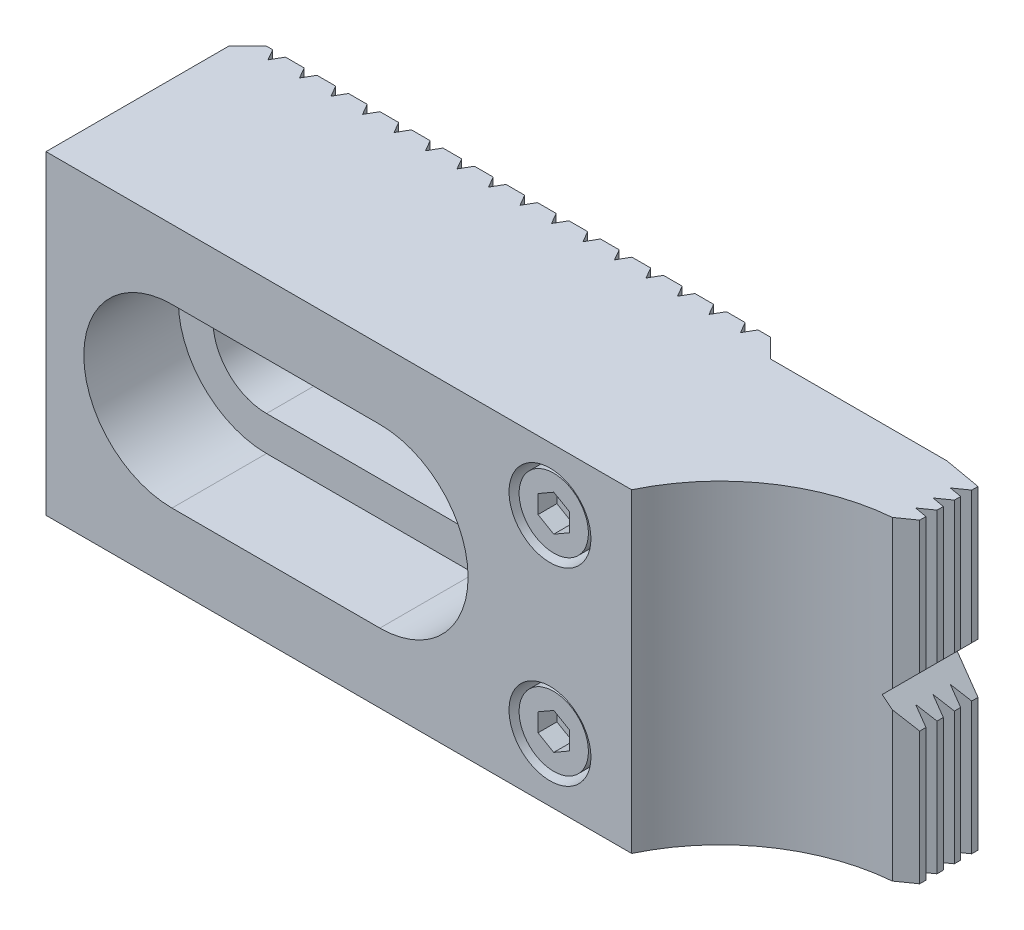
ISO-10303-21;
HEADER;
FILE_DESCRIPTION(('STEP AP214'),'2;1');
FILE_NAME('part.step','',(''),(''),'','','');
FILE_SCHEMA(('AUTOMOTIVE_DESIGN { 1 0 10303 214 1 1 1 1 }'));
ENDSEC;
DATA;
#1=APPLICATION_CONTEXT('core data for automotive mechanical design processes');
#2=APPLICATION_PROTOCOL_DEFINITION('international standard','automotive_design',2000,#1);
#3=PRODUCT_CONTEXT('',#1,'mechanical');
#4=PRODUCT('Part','Part','',(#3));
#5=PRODUCT_RELATED_PRODUCT_CATEGORY('part','',(#4));
#6=PRODUCT_DEFINITION_FORMATION('','',#4);
#7=PRODUCT_DEFINITION_CONTEXT('part definition',#1,'design');
#8=PRODUCT_DEFINITION('design','',#6,#7);
#9=PRODUCT_DEFINITION_SHAPE('','',#8);
#10=(LENGTH_UNIT() NAMED_UNIT(*) SI_UNIT(.MILLI.,.METRE.));
#11=(NAMED_UNIT(*) PLANE_ANGLE_UNIT() SI_UNIT($,.RADIAN.));
#12=(NAMED_UNIT(*) SI_UNIT($,.STERADIAN.) SOLID_ANGLE_UNIT());
#13=UNCERTAINTY_MEASURE_WITH_UNIT(LENGTH_MEASURE(1.E-05),#10,'distance_accuracy_value','');
#14=(GEOMETRIC_REPRESENTATION_CONTEXT(3) GLOBAL_UNCERTAINTY_ASSIGNED_CONTEXT((#13)) GLOBAL_UNIT_ASSIGNED_CONTEXT((#10,
#11,#12)) REPRESENTATION_CONTEXT('',''));
#15=CARTESIAN_POINT('',(0.,0.,0.));
#16=DIRECTION('',(0.,0.,1.));
#17=DIRECTION('',(1.,0.,0.));
#18=AXIS2_PLACEMENT_3D('',#15,#16,#17);
#19=CARTESIAN_POINT('',(-25.,12.5,0.));
#20=DIRECTION('',(0.,0.,-1.));
#21=DIRECTION('',(-1.,0.,0.));
#22=AXIS2_PLACEMENT_3D('',#19,#20,#21);
#23=PLANE('',#22);
#24=DIRECTION('',(0.,1.,0.));
#25=VECTOR('',#24,1.);
#26=CARTESIAN_POINT('',(12.9919317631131,-12.5,0.));
#27=LINE('',#26,#25);
#28=CARTESIAN_POINT('',(12.9919317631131,8.91133506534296,0.));
#29=VERTEX_POINT('',#28);
#30=CARTESIAN_POINT('',(12.9919317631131,12.5,0.));
#31=VERTEX_POINT('',#30);
#32=EDGE_CURVE('E1048',#29,#31,#27,.T.);
#33=ORIENTED_EDGE('',*,*,#32,.F.);
#34=CARTESIAN_POINT('',(13.5,7.5,0.));
#35=DIRECTION('',(0.,0.,1.));
#36=DIRECTION('',(1.,0.,0.));
#37=AXIS2_PLACEMENT_3D('',#34,#35,#36);
#38=CIRCLE('',#37,1.49999999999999);
#39=CARTESIAN_POINT('',(12.9919317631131,6.08866493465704,0.));
#40=VERTEX_POINT('',#39);
#41=EDGE_CURVE('E892',#29,#40,#38,.T.);
#42=ORIENTED_EDGE('',*,*,#41,.T.);
#43=CARTESIAN_POINT('',(12.9919317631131,-6.08866493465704,0.));
#44=VERTEX_POINT('',#43);
#45=EDGE_CURVE('E1054',#44,#40,#27,.T.);
#46=ORIENTED_EDGE('',*,*,#45,.F.);
#47=CARTESIAN_POINT('',(13.5,-7.5,0.));
#48=DIRECTION('',(0.,0.,1.));
#49=DIRECTION('',(1.,0.,0.));
#50=AXIS2_PLACEMENT_3D('',#47,#48,#49);
#51=CIRCLE('',#50,1.49999999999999);
#52=CARTESIAN_POINT('',(12.9919317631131,-8.91133506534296,0.));
#53=VERTEX_POINT('',#52);
#54=EDGE_CURVE('E903',#44,#53,#51,.T.);
#55=ORIENTED_EDGE('',*,*,#54,.T.);
#56=CARTESIAN_POINT('',(12.9919317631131,-12.5,0.));
#57=VERTEX_POINT('',#56);
#58=EDGE_CURVE('E1050',#57,#53,#27,.T.);
#59=ORIENTED_EDGE('',*,*,#58,.F.);
#60=DIRECTION('',(1.,0.,0.));
#61=VECTOR('',#60,1.);
#62=CARTESIAN_POINT('',(-25.,-12.5,0.));
#63=LINE('',#62,#61);
#64=CARTESIAN_POINT('',(11.5080682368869,-12.5,0.));
#65=VERTEX_POINT('',#64);
#66=EDGE_CURVE('E2111',#65,#57,#63,.T.);
#67=ORIENTED_EDGE('',*,*,#66,.F.);
#68=DIRECTION('',(0.,1.,0.));
#69=VECTOR('',#68,1.);
#70=CARTESIAN_POINT('',(11.5080682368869,-12.5,0.));
#71=LINE('',#70,#69);
#72=CARTESIAN_POINT('',(11.5080682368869,12.5,0.));
#73=VERTEX_POINT('',#72);
#74=EDGE_CURVE('E1066',#65,#73,#71,.T.);
#75=ORIENTED_EDGE('',*,*,#74,.T.);
#76=DIRECTION('',(1.,0.,0.));
#77=VECTOR('',#76,1.);
#78=CARTESIAN_POINT('',(-25.,12.5,0.));
#79=LINE('',#78,#77);
#80=EDGE_CURVE('E1985',#73,#31,#79,.T.);
#81=ORIENTED_EDGE('',*,*,#80,.T.);
#82=EDGE_LOOP('',(#33,#42,#46,#55,#59,#67,#75,#81));
#83=FACE_BOUND('',#82,.T.);
#84=ADVANCED_FACE('F15',(#83),#23,.T.);
#85=DIRECTION('',(0.,1.,0.));
#86=VECTOR('',#85,1.);
#87=CARTESIAN_POINT('',(14.0080682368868,-12.5,0.));
#88=LINE('',#87,#86);
#89=CARTESIAN_POINT('',(14.0080682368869,-6.08866493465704,0.));
#90=VERTEX_POINT('',#89);
#91=CARTESIAN_POINT('',(14.0080682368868,6.08866493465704,0.));
#92=VERTEX_POINT('',#91);
#93=EDGE_CURVE('E1049',#90,#92,#88,.T.);
#94=ORIENTED_EDGE('',*,*,#93,.T.);
#95=CARTESIAN_POINT('',(15.,7.5,0.));
#96=VERTEX_POINT('',#95);
#97=EDGE_CURVE('E887',#92,#96,#38,.T.);
#98=ORIENTED_EDGE('',*,*,#97,.T.);
#99=DIRECTION('',(0.,-1.,0.));
#100=VECTOR('',#99,1.);
#101=CARTESIAN_POINT('',(15.,12.5,0.));
#102=LINE('',#101,#100);
#103=CARTESIAN_POINT('',(15.,-7.5,0.));
#104=VERTEX_POINT('',#103);
#105=EDGE_CURVE('E1409',#96,#104,#102,.T.);
#106=ORIENTED_EDGE('',*,*,#105,.T.);
#107=EDGE_CURVE('E899',#104,#90,#51,.T.);
#108=ORIENTED_EDGE('',*,*,#107,.T.);
#109=EDGE_LOOP('',(#94,#98,#106,#108));
#110=FACE_BOUND('',#109,.T.);
#111=ADVANCED_FACE('F1874',(#110),#23,.T.);
#112=CARTESIAN_POINT('',(15.,12.5,0.));
#113=VERTEX_POINT('',#112);
#114=EDGE_CURVE('E1405',#113,#96,#102,.T.);
#115=ORIENTED_EDGE('',*,*,#114,.T.);
#116=CARTESIAN_POINT('',(14.0080682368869,8.91133506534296,0.));
#117=VERTEX_POINT('',#116);
#118=EDGE_CURVE('E888',#96,#117,#38,.T.);
#119=ORIENTED_EDGE('',*,*,#118,.T.);
#120=CARTESIAN_POINT('',(14.0080682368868,12.5,0.));
#121=VERTEX_POINT('',#120);
#122=EDGE_CURVE('E1043',#117,#121,#88,.T.);
#123=ORIENTED_EDGE('',*,*,#122,.T.);
#124=EDGE_CURVE('E1392',#121,#113,#79,.T.);
#125=ORIENTED_EDGE('',*,*,#124,.T.);
#126=EDGE_LOOP('',(#115,#119,#123,#125));
#127=FACE_BOUND('',#126,.T.);
#128=ADVANCED_FACE('F1882',(#127),#23,.T.);
#129=CARTESIAN_POINT('',(13.5,-12.5,0.88));
#130=DIRECTION('',(0.866025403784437,0.,-0.5));
#131=DIRECTION('',(-0.5,0.,-0.866025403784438));
#132=AXIS2_PLACEMENT_3D('',#129,#130,#131);
#133=PLANE('',#132);
#134=DIRECTION('',(0.,1.,0.));
#135=VECTOR('',#134,1.);
#136=CARTESIAN_POINT('',(13.5,-12.5,0.88));
#137=LINE('',#136,#135);
#138=CARTESIAN_POINT('',(13.5,9.,0.88));
#139=VERTEX_POINT('',#138);
#140=CARTESIAN_POINT('',(13.5,12.5,0.88));
#141=VERTEX_POINT('',#140);
#142=EDGE_CURVE('E1038',#139,#141,#137,.T.);
#143=ORIENTED_EDGE('',*,*,#142,.F.);
#144=CARTESIAN_POINT('',(13.5,7.5,0.88));
#145=DIRECTION('',(0.866025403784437,0.,-0.5));
#146=DIRECTION('',(0.5,0.,0.866025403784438));
#147=AXIS2_PLACEMENT_3D('',#144,#145,#146);
#148=ELLIPSE('',#147,2.99999999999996,1.49999999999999);
#149=EDGE_CURVE('E898',#139,#29,#148,.F.);
#150=ORIENTED_EDGE('',*,*,#149,.T.);
#151=ORIENTED_EDGE('',*,*,#32,.T.);
#152=DIRECTION('',(-0.5,0.,-0.866025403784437));
#153=VECTOR('',#152,1.);
#154=CARTESIAN_POINT('',(13.5,12.5,0.88));
#155=LINE('',#154,#153);
#156=EDGE_CURVE('E1028',#141,#31,#155,.T.);
#157=ORIENTED_EDGE('',*,*,#156,.F.);
#158=EDGE_LOOP('',(#143,#150,#151,#157));
#159=FACE_BOUND('',#158,.T.);
#160=ADVANCED_FACE('F2141',(#159),#133,.T.);
#161=ORIENTED_EDGE('',*,*,#45,.T.);
#162=CARTESIAN_POINT('',(13.5,6.,0.88));
#163=VERTEX_POINT('',#162);
#164=EDGE_CURVE('E894',#40,#163,#148,.F.);
#165=ORIENTED_EDGE('',*,*,#164,.T.);
#166=CARTESIAN_POINT('',(13.5,-6.,0.88));
#167=VERTEX_POINT('',#166);
#168=EDGE_CURVE('E1044',#167,#163,#137,.T.);
#169=ORIENTED_EDGE('',*,*,#168,.F.);
#170=CARTESIAN_POINT('',(13.5,-7.5,0.88));
#171=DIRECTION('',(0.866025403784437,0.,-0.5));
#172=DIRECTION('',(0.5,0.,0.866025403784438));
#173=AXIS2_PLACEMENT_3D('',#170,#171,#172);
#174=ELLIPSE('',#173,2.99999999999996,1.49999999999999);
#175=EDGE_CURVE('E907',#167,#44,#174,.F.);
#176=ORIENTED_EDGE('',*,*,#175,.T.);
#177=EDGE_LOOP('',(#161,#165,#169,#176));
#178=FACE_BOUND('',#177,.T.);
#179=ADVANCED_FACE('F2150',(#178),#133,.T.);
#180=CARTESIAN_POINT('',(13.5,-12.5,0.88));
#181=DIRECTION('',(0.866025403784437,0.,0.5));
#182=DIRECTION('',(0.5,0.,-0.866025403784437));
#183=AXIS2_PLACEMENT_3D('',#180,#181,#182);
#184=PLANE('',#183);
#185=CARTESIAN_POINT('',(13.5,7.5,0.88));
#186=DIRECTION('',(0.866025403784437,0.,0.5));
#187=DIRECTION('',(-0.5,0.,0.866025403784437));
#188=AXIS2_PLACEMENT_3D('',#185,#186,#187);
#189=ELLIPSE('',#188,2.99999999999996,1.49999999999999);
#190=EDGE_CURVE('E895',#139,#117,#189,.F.);
#191=ORIENTED_EDGE('',*,*,#190,.F.);
#192=ORIENTED_EDGE('',*,*,#142,.T.);
#193=DIRECTION('',(0.5,0.,-0.866025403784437));
#194=VECTOR('',#193,1.);
#195=CARTESIAN_POINT('',(13.5,12.5,0.88));
#196=LINE('',#195,#194);
#197=EDGE_CURVE('E1029',#141,#121,#196,.T.);
#198=ORIENTED_EDGE('',*,*,#197,.T.);
#199=ORIENTED_EDGE('',*,*,#122,.F.);
#200=EDGE_LOOP('',(#191,#192,#198,#199));
#201=FACE_BOUND('',#200,.T.);
#202=ADVANCED_FACE('F2139',(#201),#184,.F.);
#203=EDGE_CURVE('E891',#92,#163,#189,.F.);
#204=ORIENTED_EDGE('',*,*,#203,.F.);
#205=ORIENTED_EDGE('',*,*,#93,.F.);
#206=CARTESIAN_POINT('',(13.5,-7.5,0.88));
#207=DIRECTION('',(0.866025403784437,0.,0.5));
#208=DIRECTION('',(-0.5,0.,0.866025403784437));
#209=AXIS2_PLACEMENT_3D('',#206,#207,#208);
#210=ELLIPSE('',#209,2.99999999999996,1.49999999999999);
#211=EDGE_CURVE('E1419',#167,#90,#210,.F.);
#212=ORIENTED_EDGE('',*,*,#211,.F.);
#213=ORIENTED_EDGE('',*,*,#168,.T.);
#214=EDGE_LOOP('',(#204,#205,#212,#213));
#215=FACE_BOUND('',#214,.T.);
#216=ADVANCED_FACE('F2146',(#215),#184,.F.);
#217=CARTESIAN_POINT('',(14.0080682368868,-12.5,0.));
#218=VERTEX_POINT('',#217);
#219=CARTESIAN_POINT('',(14.0080682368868,-8.91133506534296,0.));
#220=VERTEX_POINT('',#219);
#221=EDGE_CURVE('E1045',#218,#220,#88,.T.);
#222=ORIENTED_EDGE('',*,*,#221,.T.);
#223=EDGE_CURVE('E904',#220,#104,#51,.T.);
#224=ORIENTED_EDGE('',*,*,#223,.T.);
#225=CARTESIAN_POINT('',(15.,-12.5,0.));
#226=VERTEX_POINT('',#225);
#227=EDGE_CURVE('E1404',#104,#226,#102,.T.);
#228=ORIENTED_EDGE('',*,*,#227,.T.);
#229=EDGE_CURVE('E1378',#218,#226,#63,.T.);
#230=ORIENTED_EDGE('',*,*,#229,.F.);
#231=EDGE_LOOP('',(#222,#224,#228,#230));
#232=FACE_BOUND('',#231,.T.);
#233=ADVANCED_FACE('F2130',(#232),#23,.T.);
#234=ORIENTED_EDGE('',*,*,#58,.T.);
#235=CARTESIAN_POINT('',(13.5,-9.,0.88));
#236=VERTEX_POINT('',#235);
#237=EDGE_CURVE('E902',#53,#236,#174,.F.);
#238=ORIENTED_EDGE('',*,*,#237,.T.);
#239=CARTESIAN_POINT('',(13.5,-12.5,0.88));
#240=VERTEX_POINT('',#239);
#241=EDGE_CURVE('E1040',#240,#236,#137,.T.);
#242=ORIENTED_EDGE('',*,*,#241,.F.);
#243=DIRECTION('',(-0.5,0.,-0.866025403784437));
#244=VECTOR('',#243,1.);
#245=CARTESIAN_POINT('',(13.5,-12.5,0.88));
#246=LINE('',#245,#244);
#247=EDGE_CURVE('E1032',#240,#57,#246,.T.);
#248=ORIENTED_EDGE('',*,*,#247,.T.);
#249=EDGE_LOOP('',(#234,#238,#242,#248));
#250=FACE_BOUND('',#249,.T.);
#251=ADVANCED_FACE('F2160',(#250),#133,.T.);
#252=EDGE_CURVE('E1417',#220,#236,#210,.F.);
#253=ORIENTED_EDGE('',*,*,#252,.F.);
#254=ORIENTED_EDGE('',*,*,#221,.F.);
#255=DIRECTION('',(0.5,0.,-0.866025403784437));
#256=VECTOR('',#255,1.);
#257=CARTESIAN_POINT('',(13.5,-12.5,0.88));
#258=LINE('',#257,#256);
#259=EDGE_CURVE('E1035',#240,#218,#258,.T.);
#260=ORIENTED_EDGE('',*,*,#259,.F.);
#261=ORIENTED_EDGE('',*,*,#241,.T.);
#262=EDGE_LOOP('',(#253,#254,#260,#261));
#263=FACE_BOUND('',#262,.T.);
#264=ADVANCED_FACE('F2162',(#263),#184,.F.);
#265=CARTESIAN_POINT('',(0.,0.,0.));
#266=DIRECTION('',(0.,0.,1.));
#267=DIRECTION('',(1.,0.,0.));
#268=AXIS2_PLACEMENT_3D('',#265,#266,#267);
#269=CIRCLE('',#268,4.25);
#270=CARTESIAN_POINT('',(2.99193176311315,3.01841751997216,0.));
#271=VERTEX_POINT('',#270);
#272=CARTESIAN_POINT('',(1.5080682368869,3.97344059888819,0.));
#273=VERTEX_POINT('',#272);
#274=EDGE_CURVE('E2163',#271,#273,#269,.T.);
#275=ORIENTED_EDGE('',*,*,#274,.T.);
#276=DIRECTION('',(0.,1.,0.));
#277=VECTOR('',#276,1.);
#278=CARTESIAN_POINT('',(1.50806823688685,-12.5,0.));
#279=LINE('',#278,#277);
#280=CARTESIAN_POINT('',(1.5080682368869,12.5,0.));
#281=VERTEX_POINT('',#280);
#282=EDGE_CURVE('E1143',#273,#281,#279,.T.);
#283=ORIENTED_EDGE('',*,*,#282,.T.);
#284=CARTESIAN_POINT('',(2.99193176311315,12.5,0.));
#285=VERTEX_POINT('',#284);
#286=EDGE_CURVE('E2000',#281,#285,#79,.T.);
#287=ORIENTED_EDGE('',*,*,#286,.T.);
#288=DIRECTION('',(0.,1.,0.));
#289=VECTOR('',#288,1.);
#290=CARTESIAN_POINT('',(2.99193176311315,-12.5,0.));
#291=LINE('',#290,#289);
#292=EDGE_CURVE('E1124',#271,#285,#291,.T.);
#293=ORIENTED_EDGE('',*,*,#292,.F.);
#294=EDGE_LOOP('',(#275,#283,#287,#293));
#295=FACE_BOUND('',#294,.T.);
#296=ADVANCED_FACE('F3019',(#295),#23,.T.);
#297=CARTESIAN_POINT('',(0.,-4.25,0.));
#298=VERTEX_POINT('',#297);
#299=CARTESIAN_POINT('',(0.49193176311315,-4.22143377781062,0.));
#300=VERTEX_POINT('',#299);
#301=EDGE_CURVE('E919',#298,#300,#269,.T.);
#302=ORIENTED_EDGE('',*,*,#301,.T.);
#303=DIRECTION('',(0.,1.,0.));
#304=VECTOR('',#303,1.);
#305=CARTESIAN_POINT('',(0.49193176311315,-12.5,0.));
#306=LINE('',#305,#304);
#307=CARTESIAN_POINT('',(0.49193176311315,-12.5,0.));
#308=VERTEX_POINT('',#307);
#309=EDGE_CURVE('E1148',#308,#300,#306,.T.);
#310=ORIENTED_EDGE('',*,*,#309,.F.);
#311=CARTESIAN_POINT('',(-0.991931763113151,-12.5,0.));
#312=VERTEX_POINT('',#311);
#313=EDGE_CURVE('E2091',#312,#308,#63,.T.);
#314=ORIENTED_EDGE('',*,*,#313,.F.);
#315=DIRECTION('',(0.,1.,0.));
#316=VECTOR('',#315,1.);
#317=CARTESIAN_POINT('',(-0.991931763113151,-12.5,0.));
#318=LINE('',#317,#316);
#319=CARTESIAN_POINT('',(-0.9919317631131,-4.25,0.));
#320=VERTEX_POINT('',#319);
#321=EDGE_CURVE('E1167',#312,#320,#318,.T.);
#322=ORIENTED_EDGE('',*,*,#321,.T.);
#323=DIRECTION('',(-1.,0.,0.));
#324=VECTOR('',#323,1.);
#325=CARTESIAN_POINT('',(0.,-4.25,0.));
#326=LINE('',#325,#324);
#327=EDGE_CURVE('E861',#298,#320,#326,.T.);
#328=ORIENTED_EDGE('',*,*,#327,.F.);
#329=EDGE_LOOP('',(#302,#310,#314,#322,#328));
#330=FACE_BOUND('',#329,.T.);
#331=ADVANCED_FACE('F3025',(#330),#23,.T.);
#332=DIRECTION('',(0.,1.,0.));
#333=VECTOR('',#332,1.);
#334=CARTESIAN_POINT('',(-3.49193176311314,-12.5,0.));
#335=LINE('',#334,#333);
#336=CARTESIAN_POINT('',(-3.49193176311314,-12.5,0.));
#337=VERTEX_POINT('',#336);
#338=CARTESIAN_POINT('',(-3.4919317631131,-4.25,0.));
#339=VERTEX_POINT('',#338);
#340=EDGE_CURVE('E1190',#337,#339,#335,.T.);
#341=ORIENTED_EDGE('',*,*,#340,.T.);
#342=CARTESIAN_POINT('',(-2.00806823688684,-4.25,0.));
#343=VERTEX_POINT('',#342);
#344=EDGE_CURVE('E909',#343,#339,#326,.T.);
#345=ORIENTED_EDGE('',*,*,#344,.F.);
#346=DIRECTION('',(0.,1.,0.));
#347=VECTOR('',#346,1.);
#348=CARTESIAN_POINT('',(-2.00806823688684,-12.5,0.));
#349=LINE('',#348,#347);
#350=CARTESIAN_POINT('',(-2.00806823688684,-12.5,0.));
#351=VERTEX_POINT('',#350);
#352=EDGE_CURVE('E1171',#351,#343,#349,.T.);
#353=ORIENTED_EDGE('',*,*,#352,.F.);
#354=EDGE_CURVE('E2087',#337,#351,#63,.T.);
#355=ORIENTED_EDGE('',*,*,#354,.F.);
#356=EDGE_LOOP('',(#341,#345,#353,#355));
#357=FACE_BOUND('',#356,.T.);
#358=ADVANCED_FACE('F3030',(#357),#23,.T.);
#359=CARTESIAN_POINT('',(-2.00806823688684,4.25,0.));
#360=VERTEX_POINT('',#359);
#361=CARTESIAN_POINT('',(-2.00806823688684,12.5,0.));
#362=VERTEX_POINT('',#361);
#363=EDGE_CURVE('E1170',#360,#362,#349,.T.);
#364=ORIENTED_EDGE('',*,*,#363,.F.);
#365=DIRECTION('',(1.,0.,0.));
#366=VECTOR('',#365,1.);
#367=CARTESIAN_POINT('',(-16.5,4.25,0.));
#368=LINE('',#367,#366);
#369=CARTESIAN_POINT('',(-3.4919317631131,4.25,0.));
#370=VERTEX_POINT('',#369);
#371=EDGE_CURVE('E918',#370,#360,#368,.T.);
#372=ORIENTED_EDGE('',*,*,#371,.F.);
#373=CARTESIAN_POINT('',(-3.49193176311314,12.5,0.));
#374=VERTEX_POINT('',#373);
#375=EDGE_CURVE('E1189',#370,#374,#335,.T.);
#376=ORIENTED_EDGE('',*,*,#375,.T.);
#377=EDGE_CURVE('E2010',#374,#362,#79,.T.);
#378=ORIENTED_EDGE('',*,*,#377,.T.);
#379=EDGE_LOOP('',(#364,#372,#376,#378));
#380=FACE_BOUND('',#379,.T.);
#381=ADVANCED_FACE('F3036',(#380),#23,.T.);
#382=DIRECTION('',(0.,1.,0.));
#383=VECTOR('',#382,1.);
#384=CARTESIAN_POINT('',(-5.99193176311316,-12.5,0.));
#385=LINE('',#384,#383);
#386=CARTESIAN_POINT('',(-5.99193176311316,-12.5,0.));
#387=VERTEX_POINT('',#386);
#388=CARTESIAN_POINT('',(-5.9919317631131,-4.25,0.));
#389=VERTEX_POINT('',#388);
#390=EDGE_CURVE('E1213',#387,#389,#385,.T.);
#391=ORIENTED_EDGE('',*,*,#390,.T.);
#392=CARTESIAN_POINT('',(-4.50806823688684,-4.25,0.));
#393=VERTEX_POINT('',#392);
#394=EDGE_CURVE('E3528',#393,#389,#326,.T.);
#395=ORIENTED_EDGE('',*,*,#394,.F.);
#396=DIRECTION('',(0.,1.,0.));
#397=VECTOR('',#396,1.);
#398=CARTESIAN_POINT('',(-4.50806823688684,-12.5,0.));
#399=LINE('',#398,#397);
#400=CARTESIAN_POINT('',(-4.50806823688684,-12.5,0.));
#401=VERTEX_POINT('',#400);
#402=EDGE_CURVE('E1194',#401,#393,#399,.T.);
#403=ORIENTED_EDGE('',*,*,#402,.F.);
#404=EDGE_CURVE('E2083',#387,#401,#63,.T.);
#405=ORIENTED_EDGE('',*,*,#404,.F.);
#406=EDGE_LOOP('',(#391,#395,#403,#405));
#407=FACE_BOUND('',#406,.T.);
#408=ADVANCED_FACE('F3373',(#407),#23,.T.);
#409=CARTESIAN_POINT('',(-4.50806823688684,4.25,0.));
#410=VERTEX_POINT('',#409);
#411=CARTESIAN_POINT('',(-4.50806823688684,12.5,0.));
#412=VERTEX_POINT('',#411);
#413=EDGE_CURVE('E1193',#410,#412,#399,.T.);
#414=ORIENTED_EDGE('',*,*,#413,.F.);
#415=CARTESIAN_POINT('',(-5.9919317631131,4.25,0.));
#416=VERTEX_POINT('',#415);
#417=EDGE_CURVE('E3120',#416,#410,#368,.T.);
#418=ORIENTED_EDGE('',*,*,#417,.F.);
#419=CARTESIAN_POINT('',(-5.9919317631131,12.5,0.));
#420=VERTEX_POINT('',#419);
#421=EDGE_CURVE('E1212',#416,#420,#385,.T.);
#422=ORIENTED_EDGE('',*,*,#421,.T.);
#423=EDGE_CURVE('E2015',#420,#412,#79,.T.);
#424=ORIENTED_EDGE('',*,*,#423,.T.);
#425=EDGE_LOOP('',(#414,#418,#422,#424));
#426=FACE_BOUND('',#425,.T.);
#427=ADVANCED_FACE('F3132',(#426),#23,.T.);
#428=DIRECTION('',(0.,1.,0.));
#429=VECTOR('',#428,1.);
#430=CARTESIAN_POINT('',(-8.49193176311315,-12.5,0.));
#431=LINE('',#430,#429);
#432=CARTESIAN_POINT('',(-8.49193176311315,-12.5,0.));
#433=VERTEX_POINT('',#432);
#434=CARTESIAN_POINT('',(-8.4919317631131,-4.25,0.));
#435=VERTEX_POINT('',#434);
#436=EDGE_CURVE('E1236',#433,#435,#431,.T.);
#437=ORIENTED_EDGE('',*,*,#436,.T.);
#438=CARTESIAN_POINT('',(-7.00806823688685,-4.25,0.));
#439=VERTEX_POINT('',#438);
#440=EDGE_CURVE('E3524',#439,#435,#326,.T.);
#441=ORIENTED_EDGE('',*,*,#440,.F.);
#442=DIRECTION('',(0.,1.,0.));
#443=VECTOR('',#442,1.);
#444=CARTESIAN_POINT('',(-7.00806823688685,-12.5,0.));
#445=LINE('',#444,#443);
#446=CARTESIAN_POINT('',(-7.00806823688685,-12.5,0.));
#447=VERTEX_POINT('',#446);
#448=EDGE_CURVE('E1217',#447,#439,#445,.T.);
#449=ORIENTED_EDGE('',*,*,#448,.F.);
#450=EDGE_CURVE('E2079',#433,#447,#63,.T.);
#451=ORIENTED_EDGE('',*,*,#450,.F.);
#452=EDGE_LOOP('',(#437,#441,#449,#451));
#453=FACE_BOUND('',#452,.T.);
#454=ADVANCED_FACE('F3390',(#453),#23,.T.);
#455=CARTESIAN_POINT('',(-7.00806823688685,4.25,0.));
#456=VERTEX_POINT('',#455);
#457=CARTESIAN_POINT('',(-7.00806823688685,12.5,0.));
#458=VERTEX_POINT('',#457);
#459=EDGE_CURVE('E1216',#456,#458,#445,.T.);
#460=ORIENTED_EDGE('',*,*,#459,.F.);
#461=CARTESIAN_POINT('',(-8.4919317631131,4.25,0.));
#462=VERTEX_POINT('',#461);
#463=EDGE_CURVE('E3118',#462,#456,#368,.T.);
#464=ORIENTED_EDGE('',*,*,#463,.F.);
#465=CARTESIAN_POINT('',(-8.49193176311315,12.5,0.));
#466=VERTEX_POINT('',#465);
#467=EDGE_CURVE('E1235',#462,#466,#431,.T.);
#468=ORIENTED_EDGE('',*,*,#467,.T.);
#469=EDGE_CURVE('E2020',#466,#458,#79,.T.);
#470=ORIENTED_EDGE('',*,*,#469,.T.);
#471=EDGE_LOOP('',(#460,#464,#468,#470));
#472=FACE_BOUND('',#471,.T.);
#473=ADVANCED_FACE('F3140',(#472),#23,.T.);
#474=DIRECTION('',(0.,1.,0.));
#475=VECTOR('',#474,1.);
#476=CARTESIAN_POINT('',(-10.9919317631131,-12.5,0.));
#477=LINE('',#476,#475);
#478=CARTESIAN_POINT('',(-10.9919317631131,-12.5,0.));
#479=VERTEX_POINT('',#478);
#480=CARTESIAN_POINT('',(-10.9919317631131,-4.25,0.));
#481=VERTEX_POINT('',#480);
#482=EDGE_CURVE('E1259',#479,#481,#477,.T.);
#483=ORIENTED_EDGE('',*,*,#482,.T.);
#484=CARTESIAN_POINT('',(-9.50806823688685,-4.25,0.));
#485=VERTEX_POINT('',#484);
#486=EDGE_CURVE('E3520',#485,#481,#326,.T.);
#487=ORIENTED_EDGE('',*,*,#486,.F.);
#488=DIRECTION('',(0.,1.,0.));
#489=VECTOR('',#488,1.);
#490=CARTESIAN_POINT('',(-9.50806823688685,-12.5,0.));
#491=LINE('',#490,#489);
#492=CARTESIAN_POINT('',(-9.50806823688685,-12.5,0.));
#493=VERTEX_POINT('',#492);
#494=EDGE_CURVE('E1240',#493,#485,#491,.T.);
#495=ORIENTED_EDGE('',*,*,#494,.F.);
#496=EDGE_CURVE('E2075',#479,#493,#63,.T.);
#497=ORIENTED_EDGE('',*,*,#496,.F.);
#498=EDGE_LOOP('',(#483,#487,#495,#497));
#499=FACE_BOUND('',#498,.T.);
#500=ADVANCED_FACE('F3406',(#499),#23,.T.);
#501=CARTESIAN_POINT('',(-9.50806823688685,4.25,0.));
#502=VERTEX_POINT('',#501);
#503=CARTESIAN_POINT('',(-9.50806823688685,12.5,0.));
#504=VERTEX_POINT('',#503);
#505=EDGE_CURVE('E1239',#502,#504,#491,.T.);
#506=ORIENTED_EDGE('',*,*,#505,.F.);
#507=CARTESIAN_POINT('',(-10.9919317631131,4.25,0.));
#508=VERTEX_POINT('',#507);
#509=EDGE_CURVE('E3116',#508,#502,#368,.T.);
#510=ORIENTED_EDGE('',*,*,#509,.F.);
#511=CARTESIAN_POINT('',(-10.9919317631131,12.5,0.));
#512=VERTEX_POINT('',#511);
#513=EDGE_CURVE('E1258',#508,#512,#477,.T.);
#514=ORIENTED_EDGE('',*,*,#513,.T.);
#515=EDGE_CURVE('E2025',#512,#504,#79,.T.);
#516=ORIENTED_EDGE('',*,*,#515,.T.);
#517=EDGE_LOOP('',(#506,#510,#514,#516));
#518=FACE_BOUND('',#517,.T.);
#519=ADVANCED_FACE('F3148',(#518),#23,.T.);
#520=DIRECTION('',(0.,1.,0.));
#521=VECTOR('',#520,1.);
#522=CARTESIAN_POINT('',(-13.4919317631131,-12.5,0.));
#523=LINE('',#522,#521);
#524=CARTESIAN_POINT('',(-13.4919317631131,-12.5,0.));
#525=VERTEX_POINT('',#524);
#526=CARTESIAN_POINT('',(-13.4919317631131,-4.25,0.));
#527=VERTEX_POINT('',#526);
#528=EDGE_CURVE('E1282',#525,#527,#523,.T.);
#529=ORIENTED_EDGE('',*,*,#528,.T.);
#530=CARTESIAN_POINT('',(-12.0080682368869,-4.25,0.));
#531=VERTEX_POINT('',#530);
#532=EDGE_CURVE('E3516',#531,#527,#326,.T.);
#533=ORIENTED_EDGE('',*,*,#532,.F.);
#534=DIRECTION('',(0.,1.,0.));
#535=VECTOR('',#534,1.);
#536=CARTESIAN_POINT('',(-12.0080682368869,-12.5,0.));
#537=LINE('',#536,#535);
#538=CARTESIAN_POINT('',(-12.0080682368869,-12.5,0.));
#539=VERTEX_POINT('',#538);
#540=EDGE_CURVE('E1263',#539,#531,#537,.T.);
#541=ORIENTED_EDGE('',*,*,#540,.F.);
#542=EDGE_CURVE('E2071',#525,#539,#63,.T.);
#543=ORIENTED_EDGE('',*,*,#542,.F.);
#544=EDGE_LOOP('',(#529,#533,#541,#543));
#545=FACE_BOUND('',#544,.T.);
#546=ADVANCED_FACE('F3422',(#545),#23,.T.);
#547=CARTESIAN_POINT('',(-12.0080682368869,4.25,0.));
#548=VERTEX_POINT('',#547);
#549=CARTESIAN_POINT('',(-12.0080682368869,12.5,0.));
#550=VERTEX_POINT('',#549);
#551=EDGE_CURVE('E1262',#548,#550,#537,.T.);
#552=ORIENTED_EDGE('',*,*,#551,.F.);
#553=CARTESIAN_POINT('',(-13.4919317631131,4.25,0.));
#554=VERTEX_POINT('',#553);
#555=EDGE_CURVE('E3115',#554,#548,#368,.T.);
#556=ORIENTED_EDGE('',*,*,#555,.F.);
#557=CARTESIAN_POINT('',(-13.4919317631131,12.5,0.));
#558=VERTEX_POINT('',#557);
#559=EDGE_CURVE('E1281',#554,#558,#523,.T.);
#560=ORIENTED_EDGE('',*,*,#559,.T.);
#561=EDGE_CURVE('E2030',#558,#550,#79,.T.);
#562=ORIENTED_EDGE('',*,*,#561,.T.);
#563=EDGE_LOOP('',(#552,#556,#560,#562));
#564=FACE_BOUND('',#563,.T.);
#565=ADVANCED_FACE('F3156',(#564),#23,.T.);
#566=DIRECTION('',(0.,1.,0.));
#567=VECTOR('',#566,1.);
#568=CARTESIAN_POINT('',(-15.9919317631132,-12.5,0.));
#569=LINE('',#568,#567);
#570=CARTESIAN_POINT('',(-15.9919317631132,-12.5,0.));
#571=VERTEX_POINT('',#570);
#572=CARTESIAN_POINT('',(-15.9919317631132,-4.25,0.));
#573=VERTEX_POINT('',#572);
#574=EDGE_CURVE('E1305',#571,#573,#569,.T.);
#575=ORIENTED_EDGE('',*,*,#574,.T.);
#576=CARTESIAN_POINT('',(-14.5080682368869,-4.25,0.));
#577=VERTEX_POINT('',#576);
#578=EDGE_CURVE('E910',#577,#573,#326,.T.);
#579=ORIENTED_EDGE('',*,*,#578,.F.);
#580=DIRECTION('',(0.,1.,0.));
#581=VECTOR('',#580,1.);
#582=CARTESIAN_POINT('',(-14.5080682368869,-12.5,0.));
#583=LINE('',#582,#581);
#584=CARTESIAN_POINT('',(-14.5080682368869,-12.5,0.));
#585=VERTEX_POINT('',#584);
#586=EDGE_CURVE('E1286',#585,#577,#583,.T.);
#587=ORIENTED_EDGE('',*,*,#586,.F.);
#588=EDGE_CURVE('E2067',#571,#585,#63,.T.);
#589=ORIENTED_EDGE('',*,*,#588,.F.);
#590=EDGE_LOOP('',(#575,#579,#587,#589));
#591=FACE_BOUND('',#590,.T.);
#592=ADVANCED_FACE('F3101',(#591),#23,.T.);
#593=CARTESIAN_POINT('',(-14.5080682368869,4.25,0.));
#594=VERTEX_POINT('',#593);
#595=CARTESIAN_POINT('',(-14.5080682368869,12.5,0.));
#596=VERTEX_POINT('',#595);
#597=EDGE_CURVE('E1285',#594,#596,#583,.T.);
#598=ORIENTED_EDGE('',*,*,#597,.F.);
#599=CARTESIAN_POINT('',(-15.9919317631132,4.25,0.));
#600=VERTEX_POINT('',#599);
#601=EDGE_CURVE('E915',#600,#594,#368,.T.);
#602=ORIENTED_EDGE('',*,*,#601,.F.);
#603=CARTESIAN_POINT('',(-15.9919317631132,12.5,0.));
#604=VERTEX_POINT('',#603);
#605=EDGE_CURVE('E1304',#600,#604,#569,.T.);
#606=ORIENTED_EDGE('',*,*,#605,.T.);
#607=EDGE_CURVE('E2035',#604,#596,#79,.T.);
#608=ORIENTED_EDGE('',*,*,#607,.T.);
#609=EDGE_LOOP('',(#598,#602,#606,#608));
#610=FACE_BOUND('',#609,.T.);
#611=ADVANCED_FACE('F3094',(#610),#23,.T.);
#612=CARTESIAN_POINT('',(-16.5,0.,0.));
#613=DIRECTION('',(0.,0.,1.));
#614=DIRECTION('',(1.,0.,0.));
#615=AXIS2_PLACEMENT_3D('',#612,#613,#614);
#616=CIRCLE('',#615,4.25);
#617=CARTESIAN_POINT('',(-17.0080682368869,4.21952208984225,0.));
#618=VERTEX_POINT('',#617);
#619=CARTESIAN_POINT('',(-18.4919317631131,3.75429192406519,0.));
#620=VERTEX_POINT('',#619);
#621=EDGE_CURVE('E916',#618,#620,#616,.T.);
#622=ORIENTED_EDGE('',*,*,#621,.T.);
#623=DIRECTION('',(0.,1.,0.));
#624=VECTOR('',#623,1.);
#625=CARTESIAN_POINT('',(-18.4919317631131,-12.5,0.));
#626=LINE('',#625,#624);
#627=CARTESIAN_POINT('',(-18.4919317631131,12.5,0.));
#628=VERTEX_POINT('',#627);
#629=EDGE_CURVE('E1327',#620,#628,#626,.T.);
#630=ORIENTED_EDGE('',*,*,#629,.T.);
#631=CARTESIAN_POINT('',(-17.0080682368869,12.5,0.));
#632=VERTEX_POINT('',#631);
#633=EDGE_CURVE('E2040',#628,#632,#79,.T.);
#634=ORIENTED_EDGE('',*,*,#633,.T.);
#635=DIRECTION('',(0.,1.,0.));
#636=VECTOR('',#635,1.);
#637=CARTESIAN_POINT('',(-17.0080682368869,-12.5,0.));
#638=LINE('',#637,#636);
#639=EDGE_CURVE('E1308',#618,#632,#638,.T.);
#640=ORIENTED_EDGE('',*,*,#639,.F.);
#641=EDGE_LOOP('',(#622,#630,#634,#640));
#642=FACE_BOUND('',#641,.T.);
#643=ADVANCED_FACE('F3089',(#642),#23,.T.);
#644=CARTESIAN_POINT('',(-19.,-12.5,0.88));
#645=DIRECTION('',(0.866025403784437,0.,-0.5));
#646=DIRECTION('',(-0.5,0.,-0.866025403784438));
#647=AXIS2_PLACEMENT_3D('',#644,#645,#646);
#648=PLANE('',#647);
#649=CARTESIAN_POINT('',(-16.5,0.,5.21012701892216));
#650=DIRECTION('',(0.866025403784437,0.,-0.5));
#651=DIRECTION('',(0.5,0.,0.866025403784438));
#652=AXIS2_PLACEMENT_3D('',#649,#650,#651);
#653=ELLIPSE('',#652,8.5,4.25);
#654=CARTESIAN_POINT('',(-19.,-3.43693177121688,0.88));
#655=VERTEX_POINT('',#654);
#656=CARTESIAN_POINT('',(-19.5080682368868,-3.00233667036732,0.));
#657=VERTEX_POINT('',#656);
#658=EDGE_CURVE('E1007',#655,#657,#653,.T.);
#659=ORIENTED_EDGE('',*,*,#658,.F.);
#660=DIRECTION('',(0.,1.,0.));
#661=VECTOR('',#660,1.);
#662=CARTESIAN_POINT('',(-19.,-12.5,0.88));
#663=LINE('',#662,#661);
#664=CARTESIAN_POINT('',(-19.,-12.5,0.88));
#665=VERTEX_POINT('',#664);
#666=EDGE_CURVE('E1324',#665,#655,#663,.T.);
#667=ORIENTED_EDGE('',*,*,#666,.F.);
#668=DIRECTION('',(-0.5,0.,-0.866025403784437));
#669=VECTOR('',#668,1.);
#670=CARTESIAN_POINT('',(-19.,-12.5,0.88));
#671=LINE('',#670,#669);
#672=CARTESIAN_POINT('',(-19.5080682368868,-12.5,0.));
#673=VERTEX_POINT('',#672);
#674=EDGE_CURVE('E1316',#665,#673,#671,.T.);
#675=ORIENTED_EDGE('',*,*,#674,.T.);
#676=DIRECTION('',(0.,1.,0.));
#677=VECTOR('',#676,1.);
#678=CARTESIAN_POINT('',(-19.5080682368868,-12.5,0.));
#679=LINE('',#678,#677);
#680=EDGE_CURVE('E1332',#673,#657,#679,.T.);
#681=ORIENTED_EDGE('',*,*,#680,.T.);
#682=EDGE_LOOP('',(#659,#667,#675,#681));
#683=FACE_BOUND('',#682,.T.);
#684=ADVANCED_FACE('F2313',(#683),#648,.T.);
#685=CARTESIAN_POINT('',(-19.,-12.5,0.88));
#686=DIRECTION('',(0.866025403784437,0.,0.5));
#687=DIRECTION('',(0.5,0.,-0.866025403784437));
#688=AXIS2_PLACEMENT_3D('',#685,#686,#687);
#689=PLANE('',#688);
#690=ORIENTED_EDGE('',*,*,#666,.T.);
#691=CARTESIAN_POINT('',(-16.5,0.,-3.45012701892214));
#692=DIRECTION('',(0.866025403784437,0.,0.5));
#693=DIRECTION('',(-0.5,0.,0.866025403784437));
#694=AXIS2_PLACEMENT_3D('',#691,#692,#693);
#695=ELLIPSE('',#694,8.5,4.25);
#696=CARTESIAN_POINT('',(-18.4919317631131,-3.75429192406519,0.));
#697=VERTEX_POINT('',#696);
#698=EDGE_CURVE('E1005',#655,#697,#695,.T.);
#699=ORIENTED_EDGE('',*,*,#698,.T.);
#700=CARTESIAN_POINT('',(-18.4919317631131,-12.5,0.));
#701=VERTEX_POINT('',#700);
#702=EDGE_CURVE('E1328',#701,#697,#626,.T.);
#703=ORIENTED_EDGE('',*,*,#702,.F.);
#704=DIRECTION('',(0.5,0.,-0.866025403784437));
#705=VECTOR('',#704,1.);
#706=CARTESIAN_POINT('',(-19.,-12.5,0.88));
#707=LINE('',#706,#705);
#708=EDGE_CURVE('E1319',#665,#701,#707,.T.);
#709=ORIENTED_EDGE('',*,*,#708,.F.);
#710=EDGE_LOOP('',(#690,#699,#703,#709));
#711=FACE_BOUND('',#710,.T.);
#712=ADVANCED_FACE('F2317',(#711),#689,.F.);
#713=CARTESIAN_POINT('',(-16.5,-12.5,0.88));
#714=DIRECTION('',(0.866025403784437,0.,-0.5));
#715=DIRECTION('',(-0.5,0.,-0.866025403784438));
#716=AXIS2_PLACEMENT_3D('',#713,#714,#715);
#717=PLANE('',#716);
#718=CARTESIAN_POINT('',(-16.5,0.,0.88));
#719=DIRECTION('',(0.866025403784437,0.,-0.5));
#720=DIRECTION('',(0.5,0.,0.866025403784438));
#721=AXIS2_PLACEMENT_3D('',#718,#719,#720);
#722=ELLIPSE('',#721,8.5,4.25);
#723=CARTESIAN_POINT('',(-16.5,-4.25,0.88));
#724=VERTEX_POINT('',#723);
#725=CARTESIAN_POINT('',(-17.0080682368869,-4.21952208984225,0.));
#726=VERTEX_POINT('',#725);
#727=EDGE_CURVE('E1000',#724,#726,#722,.T.);
#728=ORIENTED_EDGE('',*,*,#727,.F.);
#729=DIRECTION('',(0.,1.,0.));
#730=VECTOR('',#729,1.);
#731=CARTESIAN_POINT('',(-16.5,-12.5,0.88));
#732=LINE('',#731,#730);
#733=CARTESIAN_POINT('',(-16.5,-12.5,0.88));
#734=VERTEX_POINT('',#733);
#735=EDGE_CURVE('E1301',#734,#724,#732,.T.);
#736=ORIENTED_EDGE('',*,*,#735,.F.);
#737=DIRECTION('',(-0.5,0.,-0.866025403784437));
#738=VECTOR('',#737,1.);
#739=CARTESIAN_POINT('',(-16.5,-12.5,0.88));
#740=LINE('',#739,#738);
#741=CARTESIAN_POINT('',(-17.0080682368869,-12.5,0.));
#742=VERTEX_POINT('',#741);
#743=EDGE_CURVE('E1293',#734,#742,#740,.T.);
#744=ORIENTED_EDGE('',*,*,#743,.T.);
#745=EDGE_CURVE('E1309',#742,#726,#638,.T.);
#746=ORIENTED_EDGE('',*,*,#745,.T.);
#747=EDGE_LOOP('',(#728,#736,#744,#746));
#748=FACE_BOUND('',#747,.T.);
#749=ADVANCED_FACE('F2303',(#748),#717,.T.);
#750=CARTESIAN_POINT('',(-16.5,-12.5,0.88));
#751=DIRECTION('',(0.866025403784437,0.,0.5));
#752=DIRECTION('',(0.5,0.,-0.866025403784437));
#753=AXIS2_PLACEMENT_3D('',#750,#751,#752);
#754=PLANE('',#753);
#755=DIRECTION('',(-0.5,0.,0.866025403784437));
#756=VECTOR('',#755,1.);
#757=CARTESIAN_POINT('',(-16.5,-4.25,0.88));
#758=LINE('',#757,#756);
#759=EDGE_CURVE('E996',#573,#724,#758,.T.);
#760=ORIENTED_EDGE('',*,*,#759,.F.);
#761=ORIENTED_EDGE('',*,*,#574,.F.);
#762=DIRECTION('',(0.5,0.,-0.866025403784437));
#763=VECTOR('',#762,1.);
#764=CARTESIAN_POINT('',(-16.5,-12.5,0.88));
#765=LINE('',#764,#763);
#766=EDGE_CURVE('E1296',#734,#571,#765,.T.);
#767=ORIENTED_EDGE('',*,*,#766,.F.);
#768=ORIENTED_EDGE('',*,*,#735,.T.);
#769=EDGE_LOOP('',(#760,#761,#767,#768));
#770=FACE_BOUND('',#769,.T.);
#771=ADVANCED_FACE('F2304',(#770),#754,.F.);
#772=DIRECTION('',(0.5,0.,-0.866025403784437));
#773=VECTOR('',#772,1.);
#774=CARTESIAN_POINT('',(-16.5,4.25,0.88));
#775=LINE('',#774,#773);
#776=CARTESIAN_POINT('',(-16.5,4.25,0.88));
#777=VERTEX_POINT('',#776);
#778=EDGE_CURVE('E966',#777,#600,#775,.T.);
#779=ORIENTED_EDGE('',*,*,#778,.F.);
#780=CARTESIAN_POINT('',(-16.5,12.5,0.88));
#781=VERTEX_POINT('',#780);
#782=EDGE_CURVE('E1299',#777,#781,#732,.T.);
#783=ORIENTED_EDGE('',*,*,#782,.T.);
#784=DIRECTION('',(0.5,0.,-0.866025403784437));
#785=VECTOR('',#784,1.);
#786=CARTESIAN_POINT('',(-16.5,12.5,0.88));
#787=LINE('',#786,#785);
#788=EDGE_CURVE('E1290',#781,#604,#787,.T.);
#789=ORIENTED_EDGE('',*,*,#788,.T.);
#790=ORIENTED_EDGE('',*,*,#605,.F.);
#791=EDGE_LOOP('',(#779,#783,#789,#790));
#792=FACE_BOUND('',#791,.T.);
#793=ADVANCED_FACE('F2293',(#792),#754,.F.);
#794=CARTESIAN_POINT('',(-14.,-12.5,0.88));
#795=DIRECTION('',(0.866025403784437,0.,-0.5));
#796=DIRECTION('',(-0.5,0.,-0.866025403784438));
#797=AXIS2_PLACEMENT_3D('',#794,#795,#796);
#798=PLANE('',#797);
#799=ORIENTED_EDGE('',*,*,#586,.T.);
#800=DIRECTION('',(0.5,0.,0.866025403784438));
#801=VECTOR('',#800,1.);
#802=CARTESIAN_POINT('',(-14.,-4.25,0.88));
#803=LINE('',#802,#801);
#804=CARTESIAN_POINT('',(-14.,-4.25,0.88));
#805=VERTEX_POINT('',#804);
#806=EDGE_CURVE('E993',#577,#805,#803,.T.);
#807=ORIENTED_EDGE('',*,*,#806,.T.);
#808=DIRECTION('',(0.,1.,0.));
#809=VECTOR('',#808,1.);
#810=CARTESIAN_POINT('',(-14.,-12.5,0.88));
#811=LINE('',#810,#809);
#812=CARTESIAN_POINT('',(-14.,-12.5,0.88));
#813=VERTEX_POINT('',#812);
#814=EDGE_CURVE('E1278',#813,#805,#811,.T.);
#815=ORIENTED_EDGE('',*,*,#814,.F.);
#816=DIRECTION('',(-0.5,0.,-0.866025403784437));
#817=VECTOR('',#816,1.);
#818=CARTESIAN_POINT('',(-14.,-12.5,0.88));
#819=LINE('',#818,#817);
#820=EDGE_CURVE('E1270',#813,#585,#819,.T.);
#821=ORIENTED_EDGE('',*,*,#820,.T.);
#822=EDGE_LOOP('',(#799,#807,#815,#821));
#823=FACE_BOUND('',#822,.T.);
#824=ADVANCED_FACE('F2289',(#823),#798,.T.);
#825=CARTESIAN_POINT('',(-14.,4.25,0.88));
#826=VERTEX_POINT('',#825);
#827=CARTESIAN_POINT('',(-14.,12.5,0.88));
#828=VERTEX_POINT('',#827);
#829=EDGE_CURVE('E1276',#826,#828,#811,.T.);
#830=ORIENTED_EDGE('',*,*,#829,.F.);
#831=DIRECTION('',(-0.5,0.,-0.866025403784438));
#832=VECTOR('',#831,1.);
#833=CARTESIAN_POINT('',(-14.,4.25,0.88));
#834=LINE('',#833,#832);
#835=EDGE_CURVE('E963',#826,#594,#834,.T.);
#836=ORIENTED_EDGE('',*,*,#835,.T.);
#837=ORIENTED_EDGE('',*,*,#597,.T.);
#838=DIRECTION('',(-0.5,0.,-0.866025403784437));
#839=VECTOR('',#838,1.);
#840=CARTESIAN_POINT('',(-14.,12.5,0.88));
#841=LINE('',#840,#839);
#842=EDGE_CURVE('E1266',#828,#596,#841,.T.);
#843=ORIENTED_EDGE('',*,*,#842,.F.);
#844=EDGE_LOOP('',(#830,#836,#837,#843));
#845=FACE_BOUND('',#844,.T.);
#846=ADVANCED_FACE('F2292',(#845),#798,.T.);
#847=CARTESIAN_POINT('',(-14.,-12.5,0.88));
#848=DIRECTION('',(0.866025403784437,0.,0.5));
#849=DIRECTION('',(0.5,0.,-0.866025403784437));
#850=AXIS2_PLACEMENT_3D('',#847,#848,#849);
#851=PLANE('',#850);
#852=DIRECTION('',(-0.5,0.,0.866025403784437));
#853=VECTOR('',#852,1.);
#854=CARTESIAN_POINT('',(-14.,-4.25,0.88));
#855=LINE('',#854,#853);
#856=EDGE_CURVE('E991',#527,#805,#855,.T.);
#857=ORIENTED_EDGE('',*,*,#856,.F.);
#858=ORIENTED_EDGE('',*,*,#528,.F.);
#859=DIRECTION('',(0.5,0.,-0.866025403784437));
#860=VECTOR('',#859,1.);
#861=CARTESIAN_POINT('',(-14.,-12.5,0.88));
#862=LINE('',#861,#860);
#863=EDGE_CURVE('E1273',#813,#525,#862,.T.);
#864=ORIENTED_EDGE('',*,*,#863,.F.);
#865=ORIENTED_EDGE('',*,*,#814,.T.);
#866=EDGE_LOOP('',(#857,#858,#864,#865));
#867=FACE_BOUND('',#866,.T.);
#868=ADVANCED_FACE('F2295',(#867),#851,.F.);
#869=DIRECTION('',(0.5,0.,-0.866025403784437));
#870=VECTOR('',#869,1.);
#871=CARTESIAN_POINT('',(-14.,4.25,0.88));
#872=LINE('',#871,#870);
#873=EDGE_CURVE('E961',#826,#554,#872,.T.);
#874=ORIENTED_EDGE('',*,*,#873,.F.);
#875=ORIENTED_EDGE('',*,*,#829,.T.);
#876=DIRECTION('',(0.5,0.,-0.866025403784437));
#877=VECTOR('',#876,1.);
#878=CARTESIAN_POINT('',(-14.,12.5,0.88));
#879=LINE('',#878,#877);
#880=EDGE_CURVE('E1267',#828,#558,#879,.T.);
#881=ORIENTED_EDGE('',*,*,#880,.T.);
#882=ORIENTED_EDGE('',*,*,#559,.F.);
#883=EDGE_LOOP('',(#874,#875,#881,#882));
#884=FACE_BOUND('',#883,.T.);
#885=ADVANCED_FACE('F2283',(#884),#851,.F.);
#886=CARTESIAN_POINT('',(-11.5,-12.5,0.88));
#887=DIRECTION('',(0.866025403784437,0.,-0.5));
#888=DIRECTION('',(-0.5,0.,-0.866025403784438));
#889=AXIS2_PLACEMENT_3D('',#886,#887,#888);
#890=PLANE('',#889);
#891=ORIENTED_EDGE('',*,*,#540,.T.);
#892=DIRECTION('',(0.5,0.,0.866025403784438));
#893=VECTOR('',#892,1.);
#894=CARTESIAN_POINT('',(-11.5,-4.25,0.88));
#895=LINE('',#894,#893);
#896=CARTESIAN_POINT('',(-11.5,-4.25,0.88));
#897=VERTEX_POINT('',#896);
#898=EDGE_CURVE('E988',#531,#897,#895,.T.);
#899=ORIENTED_EDGE('',*,*,#898,.T.);
#900=DIRECTION('',(0.,1.,0.));
#901=VECTOR('',#900,1.);
#902=CARTESIAN_POINT('',(-11.5,-12.5,0.88));
#903=LINE('',#902,#901);
#904=CARTESIAN_POINT('',(-11.5,-12.5,0.88));
#905=VERTEX_POINT('',#904);
#906=EDGE_CURVE('E1255',#905,#897,#903,.T.);
#907=ORIENTED_EDGE('',*,*,#906,.F.);
#908=DIRECTION('',(-0.5,0.,-0.866025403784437));
#909=VECTOR('',#908,1.);
#910=CARTESIAN_POINT('',(-11.5,-12.5,0.88));
#911=LINE('',#910,#909);
#912=EDGE_CURVE('E1247',#905,#539,#911,.T.);
#913=ORIENTED_EDGE('',*,*,#912,.T.);
#914=EDGE_LOOP('',(#891,#899,#907,#913));
#915=FACE_BOUND('',#914,.T.);
#916=ADVANCED_FACE('F2279',(#915),#890,.T.);
#917=CARTESIAN_POINT('',(-11.5,4.25,0.88));
#918=VERTEX_POINT('',#917);
#919=CARTESIAN_POINT('',(-11.5,12.5,0.88));
#920=VERTEX_POINT('',#919);
#921=EDGE_CURVE('E1253',#918,#920,#903,.T.);
#922=ORIENTED_EDGE('',*,*,#921,.F.);
#923=DIRECTION('',(-0.5,0.,-0.866025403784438));
#924=VECTOR('',#923,1.);
#925=CARTESIAN_POINT('',(-11.5,4.25,0.88));
#926=LINE('',#925,#924);
#927=EDGE_CURVE('E958',#918,#548,#926,.T.);
#928=ORIENTED_EDGE('',*,*,#927,.T.);
#929=ORIENTED_EDGE('',*,*,#551,.T.);
#930=DIRECTION('',(-0.5,0.,-0.866025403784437));
#931=VECTOR('',#930,1.);
#932=CARTESIAN_POINT('',(-11.5,12.5,0.88));
#933=LINE('',#932,#931);
#934=EDGE_CURVE('E1243',#920,#550,#933,.T.);
#935=ORIENTED_EDGE('',*,*,#934,.F.);
#936=EDGE_LOOP('',(#922,#928,#929,#935));
#937=FACE_BOUND('',#936,.T.);
#938=ADVANCED_FACE('F2282',(#937),#890,.T.);
#939=CARTESIAN_POINT('',(-11.5,-12.5,0.88));
#940=DIRECTION('',(0.866025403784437,0.,0.5));
#941=DIRECTION('',(0.5,0.,-0.866025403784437));
#942=AXIS2_PLACEMENT_3D('',#939,#940,#941);
#943=PLANE('',#942);
#944=DIRECTION('',(-0.5,0.,0.866025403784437));
#945=VECTOR('',#944,1.);
#946=CARTESIAN_POINT('',(-11.5,-4.25,0.88));
#947=LINE('',#946,#945);
#948=EDGE_CURVE('E986',#481,#897,#947,.T.);
#949=ORIENTED_EDGE('',*,*,#948,.F.);
#950=ORIENTED_EDGE('',*,*,#482,.F.);
#951=DIRECTION('',(0.5,0.,-0.866025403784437));
#952=VECTOR('',#951,1.);
#953=CARTESIAN_POINT('',(-11.5,-12.5,0.88));
#954=LINE('',#953,#952);
#955=EDGE_CURVE('E1250',#905,#479,#954,.T.);
#956=ORIENTED_EDGE('',*,*,#955,.F.);
#957=ORIENTED_EDGE('',*,*,#906,.T.);
#958=EDGE_LOOP('',(#949,#950,#956,#957));
#959=FACE_BOUND('',#958,.T.);
#960=ADVANCED_FACE('F2285',(#959),#943,.F.);
#961=DIRECTION('',(0.5,0.,-0.866025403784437));
#962=VECTOR('',#961,1.);
#963=CARTESIAN_POINT('',(-11.5,4.25,0.88));
#964=LINE('',#963,#962);
#965=EDGE_CURVE('E956',#918,#508,#964,.T.);
#966=ORIENTED_EDGE('',*,*,#965,.F.);
#967=ORIENTED_EDGE('',*,*,#921,.T.);
#968=DIRECTION('',(0.5,0.,-0.866025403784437));
#969=VECTOR('',#968,1.);
#970=CARTESIAN_POINT('',(-11.5,12.5,0.88));
#971=LINE('',#970,#969);
#972=EDGE_CURVE('E1244',#920,#512,#971,.T.);
#973=ORIENTED_EDGE('',*,*,#972,.T.);
#974=ORIENTED_EDGE('',*,*,#513,.F.);
#975=EDGE_LOOP('',(#966,#967,#973,#974));
#976=FACE_BOUND('',#975,.T.);
#977=ADVANCED_FACE('F2273',(#976),#943,.F.);
#978=CARTESIAN_POINT('',(-9.,-12.5,0.88));
#979=DIRECTION('',(0.866025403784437,0.,-0.5));
#980=DIRECTION('',(-0.5,0.,-0.866025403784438));
#981=AXIS2_PLACEMENT_3D('',#978,#979,#980);
#982=PLANE('',#981);
#983=ORIENTED_EDGE('',*,*,#494,.T.);
#984=DIRECTION('',(0.5,0.,0.866025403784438));
#985=VECTOR('',#984,1.);
#986=CARTESIAN_POINT('',(-9.,-4.25,0.88));
#987=LINE('',#986,#985);
#988=CARTESIAN_POINT('',(-9.,-4.25,0.88));
#989=VERTEX_POINT('',#988);
#990=EDGE_CURVE('E983',#485,#989,#987,.T.);
#991=ORIENTED_EDGE('',*,*,#990,.T.);
#992=DIRECTION('',(0.,1.,0.));
#993=VECTOR('',#992,1.);
#994=CARTESIAN_POINT('',(-9.,-12.5,0.88));
#995=LINE('',#994,#993);
#996=CARTESIAN_POINT('',(-9.,-12.5,0.88));
#997=VERTEX_POINT('',#996);
#998=EDGE_CURVE('E1232',#997,#989,#995,.T.);
#999=ORIENTED_EDGE('',*,*,#998,.F.);
#1000=DIRECTION('',(-0.5,0.,-0.866025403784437));
#1001=VECTOR('',#1000,1.);
#1002=CARTESIAN_POINT('',(-9.,-12.5,0.88));
#1003=LINE('',#1002,#1001);
#1004=EDGE_CURVE('E1224',#997,#493,#1003,.T.);
#1005=ORIENTED_EDGE('',*,*,#1004,.T.);
#1006=EDGE_LOOP('',(#983,#991,#999,#1005));
#1007=FACE_BOUND('',#1006,.T.);
#1008=ADVANCED_FACE('F2269',(#1007),#982,.T.);
#1009=CARTESIAN_POINT('',(-9.,4.25,0.88));
#1010=VERTEX_POINT('',#1009);
#1011=CARTESIAN_POINT('',(-9.,12.5,0.88));
#1012=VERTEX_POINT('',#1011);
#1013=EDGE_CURVE('E1230',#1010,#1012,#995,.T.);
#1014=ORIENTED_EDGE('',*,*,#1013,.F.);
#1015=DIRECTION('',(-0.5,0.,-0.866025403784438));
#1016=VECTOR('',#1015,1.);
#1017=CARTESIAN_POINT('',(-9.,4.25,0.88));
#1018=LINE('',#1017,#1016);
#1019=EDGE_CURVE('E953',#1010,#502,#1018,.T.);
#1020=ORIENTED_EDGE('',*,*,#1019,.T.);
#1021=ORIENTED_EDGE('',*,*,#505,.T.);
#1022=DIRECTION('',(-0.5,0.,-0.866025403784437));
#1023=VECTOR('',#1022,1.);
#1024=CARTESIAN_POINT('',(-9.,12.5,0.88));
#1025=LINE('',#1024,#1023);
#1026=EDGE_CURVE('E1220',#1012,#504,#1025,.T.);
#1027=ORIENTED_EDGE('',*,*,#1026,.F.);
#1028=EDGE_LOOP('',(#1014,#1020,#1021,#1027));
#1029=FACE_BOUND('',#1028,.T.);
#1030=ADVANCED_FACE('F2272',(#1029),#982,.T.);
#1031=CARTESIAN_POINT('',(-9.,-12.5,0.88));
#1032=DIRECTION('',(0.866025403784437,0.,0.5));
#1033=DIRECTION('',(0.5,0.,-0.866025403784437));
#1034=AXIS2_PLACEMENT_3D('',#1031,#1032,#1033);
#1035=PLANE('',#1034);
#1036=DIRECTION('',(-0.5,0.,0.866025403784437));
#1037=VECTOR('',#1036,1.);
#1038=CARTESIAN_POINT('',(-9.,-4.25,0.88));
#1039=LINE('',#1038,#1037);
#1040=EDGE_CURVE('E981',#435,#989,#1039,.T.);
#1041=ORIENTED_EDGE('',*,*,#1040,.F.);
#1042=ORIENTED_EDGE('',*,*,#436,.F.);
#1043=DIRECTION('',(0.5,0.,-0.866025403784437));
#1044=VECTOR('',#1043,1.);
#1045=CARTESIAN_POINT('',(-9.,-12.5,0.88));
#1046=LINE('',#1045,#1044);
#1047=EDGE_CURVE('E1227',#997,#433,#1046,.T.);
#1048=ORIENTED_EDGE('',*,*,#1047,.F.);
#1049=ORIENTED_EDGE('',*,*,#998,.T.);
#1050=EDGE_LOOP('',(#1041,#1042,#1048,#1049));
#1051=FACE_BOUND('',#1050,.T.);
#1052=ADVANCED_FACE('F2275',(#1051),#1035,.F.);
#1053=DIRECTION('',(0.5,0.,-0.866025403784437));
#1054=VECTOR('',#1053,1.);
#1055=CARTESIAN_POINT('',(-9.,4.25,0.88));
#1056=LINE('',#1055,#1054);
#1057=EDGE_CURVE('E951',#1010,#462,#1056,.T.);
#1058=ORIENTED_EDGE('',*,*,#1057,.F.);
#1059=ORIENTED_EDGE('',*,*,#1013,.T.);
#1060=DIRECTION('',(0.5,0.,-0.866025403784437));
#1061=VECTOR('',#1060,1.);
#1062=CARTESIAN_POINT('',(-9.,12.5,0.88));
#1063=LINE('',#1062,#1061);
#1064=EDGE_CURVE('E1221',#1012,#466,#1063,.T.);
#1065=ORIENTED_EDGE('',*,*,#1064,.T.);
#1066=ORIENTED_EDGE('',*,*,#467,.F.);
#1067=EDGE_LOOP('',(#1058,#1059,#1065,#1066));
#1068=FACE_BOUND('',#1067,.T.);
#1069=ADVANCED_FACE('F2263',(#1068),#1035,.F.);
#1070=CARTESIAN_POINT('',(-6.5,-12.5,0.88));
#1071=DIRECTION('',(0.866025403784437,0.,-0.5));
#1072=DIRECTION('',(-0.5,0.,-0.866025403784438));
#1073=AXIS2_PLACEMENT_3D('',#1070,#1071,#1072);
#1074=PLANE('',#1073);
#1075=ORIENTED_EDGE('',*,*,#448,.T.);
#1076=DIRECTION('',(0.5,0.,0.866025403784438));
#1077=VECTOR('',#1076,1.);
#1078=CARTESIAN_POINT('',(-6.5,-4.25,0.88));
#1079=LINE('',#1078,#1077);
#1080=CARTESIAN_POINT('',(-6.5,-4.25,0.88));
#1081=VERTEX_POINT('',#1080);
#1082=EDGE_CURVE('E978',#439,#1081,#1079,.T.);
#1083=ORIENTED_EDGE('',*,*,#1082,.T.);
#1084=DIRECTION('',(0.,1.,0.));
#1085=VECTOR('',#1084,1.);
#1086=CARTESIAN_POINT('',(-6.5,-12.5,0.88));
#1087=LINE('',#1086,#1085);
#1088=CARTESIAN_POINT('',(-6.5,-12.5,0.88));
#1089=VERTEX_POINT('',#1088);
#1090=EDGE_CURVE('E1209',#1089,#1081,#1087,.T.);
#1091=ORIENTED_EDGE('',*,*,#1090,.F.);
#1092=DIRECTION('',(-0.5,0.,-0.866025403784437));
#1093=VECTOR('',#1092,1.);
#1094=CARTESIAN_POINT('',(-6.5,-12.5,0.88));
#1095=LINE('',#1094,#1093);
#1096=EDGE_CURVE('E1201',#1089,#447,#1095,.T.);
#1097=ORIENTED_EDGE('',*,*,#1096,.T.);
#1098=EDGE_LOOP('',(#1075,#1083,#1091,#1097));
#1099=FACE_BOUND('',#1098,.T.);
#1100=ADVANCED_FACE('F2259',(#1099),#1074,.T.);
#1101=CARTESIAN_POINT('',(-6.5,4.25,0.88));
#1102=VERTEX_POINT('',#1101);
#1103=CARTESIAN_POINT('',(-6.5,12.5,0.88));
#1104=VERTEX_POINT('',#1103);
#1105=EDGE_CURVE('E1207',#1102,#1104,#1087,.T.);
#1106=ORIENTED_EDGE('',*,*,#1105,.F.);
#1107=DIRECTION('',(-0.5,0.,-0.866025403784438));
#1108=VECTOR('',#1107,1.);
#1109=CARTESIAN_POINT('',(-6.5,4.25,0.88));
#1110=LINE('',#1109,#1108);
#1111=EDGE_CURVE('E948',#1102,#456,#1110,.T.);
#1112=ORIENTED_EDGE('',*,*,#1111,.T.);
#1113=ORIENTED_EDGE('',*,*,#459,.T.);
#1114=DIRECTION('',(-0.5,0.,-0.866025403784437));
#1115=VECTOR('',#1114,1.);
#1116=CARTESIAN_POINT('',(-6.5,12.5,0.88));
#1117=LINE('',#1116,#1115);
#1118=EDGE_CURVE('E1197',#1104,#458,#1117,.T.);
#1119=ORIENTED_EDGE('',*,*,#1118,.F.);
#1120=EDGE_LOOP('',(#1106,#1112,#1113,#1119));
#1121=FACE_BOUND('',#1120,.T.);
#1122=ADVANCED_FACE('F2262',(#1121),#1074,.T.);
#1123=CARTESIAN_POINT('',(-6.5,-12.5,0.88));
#1124=DIRECTION('',(0.866025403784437,0.,0.5));
#1125=DIRECTION('',(0.5,0.,-0.866025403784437));
#1126=AXIS2_PLACEMENT_3D('',#1123,#1124,#1125);
#1127=PLANE('',#1126);
#1128=DIRECTION('',(-0.5,0.,0.866025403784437));
#1129=VECTOR('',#1128,1.);
#1130=CARTESIAN_POINT('',(-6.5,-4.25,0.88));
#1131=LINE('',#1130,#1129);
#1132=EDGE_CURVE('E976',#389,#1081,#1131,.T.);
#1133=ORIENTED_EDGE('',*,*,#1132,.F.);
#1134=ORIENTED_EDGE('',*,*,#390,.F.);
#1135=DIRECTION('',(0.5,0.,-0.866025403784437));
#1136=VECTOR('',#1135,1.);
#1137=CARTESIAN_POINT('',(-6.5,-12.5,0.88));
#1138=LINE('',#1137,#1136);
#1139=EDGE_CURVE('E1204',#1089,#387,#1138,.T.);
#1140=ORIENTED_EDGE('',*,*,#1139,.F.);
#1141=ORIENTED_EDGE('',*,*,#1090,.T.);
#1142=EDGE_LOOP('',(#1133,#1134,#1140,#1141));
#1143=FACE_BOUND('',#1142,.T.);
#1144=ADVANCED_FACE('F2265',(#1143),#1127,.F.);
#1145=DIRECTION('',(0.5,0.,-0.866025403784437));
#1146=VECTOR('',#1145,1.);
#1147=CARTESIAN_POINT('',(-6.5,4.25,0.88));
#1148=LINE('',#1147,#1146);
#1149=EDGE_CURVE('E946',#1102,#416,#1148,.T.);
#1150=ORIENTED_EDGE('',*,*,#1149,.F.);
#1151=ORIENTED_EDGE('',*,*,#1105,.T.);
#1152=DIRECTION('',(0.5,0.,-0.866025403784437));
#1153=VECTOR('',#1152,1.);
#1154=CARTESIAN_POINT('',(-6.5,12.5,0.88));
#1155=LINE('',#1154,#1153);
#1156=EDGE_CURVE('E1198',#1104,#420,#1155,.T.);
#1157=ORIENTED_EDGE('',*,*,#1156,.T.);
#1158=ORIENTED_EDGE('',*,*,#421,.F.);
#1159=EDGE_LOOP('',(#1150,#1151,#1157,#1158));
#1160=FACE_BOUND('',#1159,.T.);
#1161=ADVANCED_FACE('F2253',(#1160),#1127,.F.);
#1162=CARTESIAN_POINT('',(-4.,-12.5,0.88));
#1163=DIRECTION('',(0.866025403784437,0.,-0.5));
#1164=DIRECTION('',(-0.5,0.,-0.866025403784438));
#1165=AXIS2_PLACEMENT_3D('',#1162,#1163,#1164);
#1166=PLANE('',#1165);
#1167=ORIENTED_EDGE('',*,*,#402,.T.);
#1168=DIRECTION('',(0.5,0.,0.866025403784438));
#1169=VECTOR('',#1168,1.);
#1170=CARTESIAN_POINT('',(-4.,-4.25,0.88));
#1171=LINE('',#1170,#1169);
#1172=CARTESIAN_POINT('',(-4.,-4.25,0.88));
#1173=VERTEX_POINT('',#1172);
#1174=EDGE_CURVE('E973',#393,#1173,#1171,.T.);
#1175=ORIENTED_EDGE('',*,*,#1174,.T.);
#1176=DIRECTION('',(0.,1.,0.));
#1177=VECTOR('',#1176,1.);
#1178=CARTESIAN_POINT('',(-4.,-12.5,0.88));
#1179=LINE('',#1178,#1177);
#1180=CARTESIAN_POINT('',(-4.,-12.5,0.88));
#1181=VERTEX_POINT('',#1180);
#1182=EDGE_CURVE('E1186',#1181,#1173,#1179,.T.);
#1183=ORIENTED_EDGE('',*,*,#1182,.F.);
#1184=DIRECTION('',(-0.5,0.,-0.866025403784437));
#1185=VECTOR('',#1184,1.);
#1186=CARTESIAN_POINT('',(-4.,-12.5,0.88));
#1187=LINE('',#1186,#1185);
#1188=EDGE_CURVE('E1178',#1181,#401,#1187,.T.);
#1189=ORIENTED_EDGE('',*,*,#1188,.T.);
#1190=EDGE_LOOP('',(#1167,#1175,#1183,#1189));
#1191=FACE_BOUND('',#1190,.T.);
#1192=ADVANCED_FACE('F2249',(#1191),#1166,.T.);
#1193=CARTESIAN_POINT('',(-4.,4.25,0.88));
#1194=VERTEX_POINT('',#1193);
#1195=CARTESIAN_POINT('',(-4.,12.5,0.88));
#1196=VERTEX_POINT('',#1195);
#1197=EDGE_CURVE('E1184',#1194,#1196,#1179,.T.);
#1198=ORIENTED_EDGE('',*,*,#1197,.F.);
#1199=DIRECTION('',(-0.5,0.,-0.866025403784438));
#1200=VECTOR('',#1199,1.);
#1201=CARTESIAN_POINT('',(-4.,4.25,0.88));
#1202=LINE('',#1201,#1200);
#1203=EDGE_CURVE('E943',#1194,#410,#1202,.T.);
#1204=ORIENTED_EDGE('',*,*,#1203,.T.);
#1205=ORIENTED_EDGE('',*,*,#413,.T.);
#1206=DIRECTION('',(-0.5,0.,-0.866025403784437));
#1207=VECTOR('',#1206,1.);
#1208=CARTESIAN_POINT('',(-4.,12.5,0.88));
#1209=LINE('',#1208,#1207);
#1210=EDGE_CURVE('E1174',#1196,#412,#1209,.T.);
#1211=ORIENTED_EDGE('',*,*,#1210,.F.);
#1212=EDGE_LOOP('',(#1198,#1204,#1205,#1211));
#1213=FACE_BOUND('',#1212,.T.);
#1214=ADVANCED_FACE('F2252',(#1213),#1166,.T.);
#1215=CARTESIAN_POINT('',(-4.,-12.5,0.88));
#1216=DIRECTION('',(0.866025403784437,0.,0.5));
#1217=DIRECTION('',(0.5,0.,-0.866025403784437));
#1218=AXIS2_PLACEMENT_3D('',#1215,#1216,#1217);
#1219=PLANE('',#1218);
#1220=DIRECTION('',(-0.5,0.,0.866025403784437));
#1221=VECTOR('',#1220,1.);
#1222=CARTESIAN_POINT('',(-4.,-4.25,0.88));
#1223=LINE('',#1222,#1221);
#1224=EDGE_CURVE('E971',#339,#1173,#1223,.T.);
#1225=ORIENTED_EDGE('',*,*,#1224,.F.);
#1226=ORIENTED_EDGE('',*,*,#340,.F.);
#1227=DIRECTION('',(0.5,0.,-0.866025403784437));
#1228=VECTOR('',#1227,1.);
#1229=CARTESIAN_POINT('',(-4.,-12.5,0.88));
#1230=LINE('',#1229,#1228);
#1231=EDGE_CURVE('E1181',#1181,#337,#1230,.T.);
#1232=ORIENTED_EDGE('',*,*,#1231,.F.);
#1233=ORIENTED_EDGE('',*,*,#1182,.T.);
#1234=EDGE_LOOP('',(#1225,#1226,#1232,#1233));
#1235=FACE_BOUND('',#1234,.T.);
#1236=ADVANCED_FACE('F2255',(#1235),#1219,.F.);
#1237=DIRECTION('',(0.5,0.,-0.866025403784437));
#1238=VECTOR('',#1237,1.);
#1239=CARTESIAN_POINT('',(-4.,4.25,0.88));
#1240=LINE('',#1239,#1238);
#1241=EDGE_CURVE('E941',#1194,#370,#1240,.T.);
#1242=ORIENTED_EDGE('',*,*,#1241,.F.);
#1243=ORIENTED_EDGE('',*,*,#1197,.T.);
#1244=DIRECTION('',(0.5,0.,-0.866025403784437));
#1245=VECTOR('',#1244,1.);
#1246=CARTESIAN_POINT('',(-4.,12.5,0.88));
#1247=LINE('',#1246,#1245);
#1248=EDGE_CURVE('E1175',#1196,#374,#1247,.T.);
#1249=ORIENTED_EDGE('',*,*,#1248,.T.);
#1250=ORIENTED_EDGE('',*,*,#375,.F.);
#1251=EDGE_LOOP('',(#1242,#1243,#1249,#1250));
#1252=FACE_BOUND('',#1251,.T.);
#1253=ADVANCED_FACE('F2242',(#1252),#1219,.F.);
#1254=CARTESIAN_POINT('',(-1.5,-12.5,0.88));
#1255=DIRECTION('',(0.866025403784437,0.,-0.5));
#1256=DIRECTION('',(-0.5,0.,-0.866025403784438));
#1257=AXIS2_PLACEMENT_3D('',#1254,#1255,#1256);
#1258=PLANE('',#1257);
#1259=ORIENTED_EDGE('',*,*,#352,.T.);
#1260=DIRECTION('',(0.5,0.,0.866025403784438));
#1261=VECTOR('',#1260,1.);
#1262=CARTESIAN_POINT('',(-1.5,-4.25,0.88));
#1263=LINE('',#1262,#1261);
#1264=CARTESIAN_POINT('',(-1.5,-4.25,0.88));
#1265=VERTEX_POINT('',#1264);
#1266=EDGE_CURVE('E968',#343,#1265,#1263,.T.);
#1267=ORIENTED_EDGE('',*,*,#1266,.T.);
#1268=DIRECTION('',(0.,1.,0.));
#1269=VECTOR('',#1268,1.);
#1270=CARTESIAN_POINT('',(-1.5,-12.5,0.88));
#1271=LINE('',#1270,#1269);
#1272=CARTESIAN_POINT('',(-1.5,-12.5,0.88));
#1273=VERTEX_POINT('',#1272);
#1274=EDGE_CURVE('E1163',#1273,#1265,#1271,.T.);
#1275=ORIENTED_EDGE('',*,*,#1274,.F.);
#1276=DIRECTION('',(-0.5,0.,-0.866025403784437));
#1277=VECTOR('',#1276,1.);
#1278=CARTESIAN_POINT('',(-1.5,-12.5,0.88));
#1279=LINE('',#1278,#1277);
#1280=EDGE_CURVE('E1155',#1273,#351,#1279,.T.);
#1281=ORIENTED_EDGE('',*,*,#1280,.T.);
#1282=EDGE_LOOP('',(#1259,#1267,#1275,#1281));
#1283=FACE_BOUND('',#1282,.T.);
#1284=ADVANCED_FACE('F2238',(#1283),#1258,.T.);
#1285=CARTESIAN_POINT('',(-1.5,4.25,0.88));
#1286=VERTEX_POINT('',#1285);
#1287=CARTESIAN_POINT('',(-1.5,12.5,0.88));
#1288=VERTEX_POINT('',#1287);
#1289=EDGE_CURVE('E1161',#1286,#1288,#1271,.T.);
#1290=ORIENTED_EDGE('',*,*,#1289,.F.);
#1291=DIRECTION('',(-0.5,0.,-0.866025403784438));
#1292=VECTOR('',#1291,1.);
#1293=CARTESIAN_POINT('',(-1.5,4.25,0.88));
#1294=LINE('',#1293,#1292);
#1295=EDGE_CURVE('E938',#1286,#360,#1294,.T.);
#1296=ORIENTED_EDGE('',*,*,#1295,.T.);
#1297=ORIENTED_EDGE('',*,*,#363,.T.);
#1298=DIRECTION('',(-0.5,0.,-0.866025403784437));
#1299=VECTOR('',#1298,1.);
#1300=CARTESIAN_POINT('',(-1.5,12.5,0.88));
#1301=LINE('',#1300,#1299);
#1302=EDGE_CURVE('E1151',#1288,#362,#1301,.T.);
#1303=ORIENTED_EDGE('',*,*,#1302,.F.);
#1304=EDGE_LOOP('',(#1290,#1296,#1297,#1303));
#1305=FACE_BOUND('',#1304,.T.);
#1306=ADVANCED_FACE('F2241',(#1305),#1258,.T.);
#1307=CARTESIAN_POINT('',(-1.5,-12.5,0.88));
#1308=DIRECTION('',(0.866025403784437,0.,0.5));
#1309=DIRECTION('',(0.5,0.,-0.866025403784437));
#1310=AXIS2_PLACEMENT_3D('',#1307,#1308,#1309);
#1311=PLANE('',#1310);
#1312=DIRECTION('',(-0.5,0.,0.866025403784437));
#1313=VECTOR('',#1312,1.);
#1314=CARTESIAN_POINT('',(-1.5,-4.25,0.88));
#1315=LINE('',#1314,#1313);
#1316=EDGE_CURVE('E1415',#320,#1265,#1315,.T.);
#1317=ORIENTED_EDGE('',*,*,#1316,.F.);
#1318=ORIENTED_EDGE('',*,*,#321,.F.);
#1319=DIRECTION('',(0.5,0.,-0.866025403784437));
#1320=VECTOR('',#1319,1.);
#1321=CARTESIAN_POINT('',(-1.5,-12.5,0.88));
#1322=LINE('',#1321,#1320);
#1323=EDGE_CURVE('E1158',#1273,#312,#1322,.T.);
#1324=ORIENTED_EDGE('',*,*,#1323,.F.);
#1325=ORIENTED_EDGE('',*,*,#1274,.T.);
#1326=EDGE_LOOP('',(#1317,#1318,#1324,#1325));
#1327=FACE_BOUND('',#1326,.T.);
#1328=ADVANCED_FACE('F2244',(#1327),#1311,.F.);
#1329=DIRECTION('',(0.5,0.,-0.866025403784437));
#1330=VECTOR('',#1329,1.);
#1331=CARTESIAN_POINT('',(-1.5,4.25,0.88));
#1332=LINE('',#1331,#1330);
#1333=CARTESIAN_POINT('',(-0.9919317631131,4.25,0.));
#1334=VERTEX_POINT('',#1333);
#1335=EDGE_CURVE('E1413',#1286,#1334,#1332,.T.);
#1336=ORIENTED_EDGE('',*,*,#1335,.F.);
#1337=ORIENTED_EDGE('',*,*,#1289,.T.);
#1338=DIRECTION('',(0.5,0.,-0.866025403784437));
#1339=VECTOR('',#1338,1.);
#1340=CARTESIAN_POINT('',(-1.5,12.5,0.88));
#1341=LINE('',#1340,#1339);
#1342=CARTESIAN_POINT('',(-0.9919317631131,12.5,0.));
#1343=VERTEX_POINT('',#1342);
#1344=EDGE_CURVE('E1152',#1288,#1343,#1341,.T.);
#1345=ORIENTED_EDGE('',*,*,#1344,.T.);
#1346=EDGE_CURVE('E1166',#1334,#1343,#318,.T.);
#1347=ORIENTED_EDGE('',*,*,#1346,.F.);
#1348=EDGE_LOOP('',(#1336,#1337,#1345,#1347));
#1349=FACE_BOUND('',#1348,.T.);
#1350=ADVANCED_FACE('F2247',(#1349),#1311,.F.);
#1351=CARTESIAN_POINT('',(1.,-12.5,0.88));
#1352=DIRECTION('',(0.866025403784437,0.,-0.5));
#1353=DIRECTION('',(-0.5,0.,-0.866025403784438));
#1354=AXIS2_PLACEMENT_3D('',#1351,#1352,#1353);
#1355=PLANE('',#1354);
#1356=CARTESIAN_POINT('',(0.,0.,-0.852050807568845));
#1357=DIRECTION('',(0.866025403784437,0.,-0.5));
#1358=DIRECTION('',(0.5,0.,0.866025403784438));
#1359=AXIS2_PLACEMENT_3D('',#1356,#1357,#1358);
#1360=ELLIPSE('',#1359,8.5,4.25);
#1361=CARTESIAN_POINT('',(1.,-4.13067791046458,0.88));
#1362=VERTEX_POINT('',#1361);
#1363=EDGE_CURVE('E937',#1362,#300,#1360,.T.);
#1364=ORIENTED_EDGE('',*,*,#1363,.F.);
#1365=DIRECTION('',(0.,1.,0.));
#1366=VECTOR('',#1365,1.);
#1367=CARTESIAN_POINT('',(1.,-12.5,0.88));
#1368=LINE('',#1367,#1366);
#1369=CARTESIAN_POINT('',(1.,-12.5,0.88));
#1370=VERTEX_POINT('',#1369);
#1371=EDGE_CURVE('E1140',#1370,#1362,#1368,.T.);
#1372=ORIENTED_EDGE('',*,*,#1371,.F.);
#1373=DIRECTION('',(-0.5,0.,-0.866025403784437));
#1374=VECTOR('',#1373,1.);
#1375=CARTESIAN_POINT('',(1.,-12.5,0.88));
#1376=LINE('',#1375,#1374);
#1377=EDGE_CURVE('E1132',#1370,#308,#1376,.T.);
#1378=ORIENTED_EDGE('',*,*,#1377,.T.);
#1379=ORIENTED_EDGE('',*,*,#309,.T.);
#1380=EDGE_LOOP('',(#1364,#1372,#1378,#1379));
#1381=FACE_BOUND('',#1380,.T.);
#1382=ADVANCED_FACE('F2233',(#1381),#1355,.T.);
#1383=CARTESIAN_POINT('',(1.,-12.5,0.88));
#1384=DIRECTION('',(0.866025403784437,0.,0.5));
#1385=DIRECTION('',(0.5,0.,-0.866025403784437));
#1386=AXIS2_PLACEMENT_3D('',#1383,#1384,#1385);
#1387=PLANE('',#1386);
#1388=ORIENTED_EDGE('',*,*,#1371,.T.);
#1389=CARTESIAN_POINT('',(0.,0.,2.61205080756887));
#1390=DIRECTION('',(0.866025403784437,0.,0.5));
#1391=DIRECTION('',(-0.5,0.,0.866025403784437));
#1392=AXIS2_PLACEMENT_3D('',#1389,#1390,#1391);
#1393=ELLIPSE('',#1392,8.5,4.25);
#1394=CARTESIAN_POINT('',(1.5080682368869,-3.97344059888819,0.));
#1395=VERTEX_POINT('',#1394);
#1396=EDGE_CURVE('E935',#1362,#1395,#1393,.T.);
#1397=ORIENTED_EDGE('',*,*,#1396,.T.);
#1398=CARTESIAN_POINT('',(1.50806823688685,-12.5,0.));
#1399=VERTEX_POINT('',#1398);
#1400=EDGE_CURVE('E1144',#1399,#1395,#279,.T.);
#1401=ORIENTED_EDGE('',*,*,#1400,.F.);
#1402=DIRECTION('',(0.5,0.,-0.866025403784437));
#1403=VECTOR('',#1402,1.);
#1404=CARTESIAN_POINT('',(1.,-12.5,0.88));
#1405=LINE('',#1404,#1403);
#1406=EDGE_CURVE('E1135',#1370,#1399,#1405,.T.);
#1407=ORIENTED_EDGE('',*,*,#1406,.F.);
#1408=EDGE_LOOP('',(#1388,#1397,#1401,#1407));
#1409=FACE_BOUND('',#1408,.T.);
#1410=ADVANCED_FACE('F2237',(#1409),#1387,.F.);
#1411=CARTESIAN_POINT('',(3.5,-12.5,0.88));
#1412=DIRECTION('',(0.866025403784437,0.,-0.5));
#1413=DIRECTION('',(-0.5,0.,-0.866025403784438));
#1414=AXIS2_PLACEMENT_3D('',#1411,#1412,#1413);
#1415=PLANE('',#1414);
#1416=CARTESIAN_POINT('',(0.,0.,-5.18217782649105));
#1417=DIRECTION('',(0.866025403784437,0.,-0.5));
#1418=DIRECTION('',(0.5,0.,0.866025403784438));
#1419=AXIS2_PLACEMENT_3D('',#1416,#1417,#1418);
#1420=ELLIPSE('',#1419,8.5,4.25);
#1421=CARTESIAN_POINT('',(3.5,-2.41091269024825,0.88));
#1422=VERTEX_POINT('',#1421);
#1423=CARTESIAN_POINT('',(2.99193176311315,-3.01841751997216,0.));
#1424=VERTEX_POINT('',#1423);
#1425=EDGE_CURVE('E930',#1422,#1424,#1420,.T.);
#1426=ORIENTED_EDGE('',*,*,#1425,.F.);
#1427=DIRECTION('',(0.,1.,0.));
#1428=VECTOR('',#1427,1.);
#1429=CARTESIAN_POINT('',(3.5,-12.5,0.88));
#1430=LINE('',#1429,#1428);
#1431=CARTESIAN_POINT('',(3.5,-12.5,0.88));
#1432=VERTEX_POINT('',#1431);
#1433=EDGE_CURVE('E1117',#1432,#1422,#1430,.T.);
#1434=ORIENTED_EDGE('',*,*,#1433,.F.);
#1435=DIRECTION('',(-0.5,0.,-0.866025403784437));
#1436=VECTOR('',#1435,1.);
#1437=CARTESIAN_POINT('',(3.5,-12.5,0.88));
#1438=LINE('',#1437,#1436);
#1439=CARTESIAN_POINT('',(2.99193176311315,-12.5,0.));
#1440=VERTEX_POINT('',#1439);
#1441=EDGE_CURVE('E1109',#1432,#1440,#1438,.T.);
#1442=ORIENTED_EDGE('',*,*,#1441,.T.);
#1443=EDGE_CURVE('E1125',#1440,#1424,#291,.T.);
#1444=ORIENTED_EDGE('',*,*,#1443,.T.);
#1445=EDGE_LOOP('',(#1426,#1434,#1442,#1444));
#1446=FACE_BOUND('',#1445,.T.);
#1447=ADVANCED_FACE('F2176',(#1446),#1415,.T.);
#1448=CARTESIAN_POINT('',(3.5,-12.5,0.88));
#1449=DIRECTION('',(0.866025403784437,0.,0.5));
#1450=DIRECTION('',(0.5,0.,-0.866025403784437));
#1451=AXIS2_PLACEMENT_3D('',#1448,#1449,#1450);
#1452=PLANE('',#1451);
#1453=ORIENTED_EDGE('',*,*,#1433,.T.);
#1454=CARTESIAN_POINT('',(0.,0.,6.94217782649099));
#1455=DIRECTION('',(0.866025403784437,0.,0.5));
#1456=DIRECTION('',(-0.5,0.,0.866025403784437));
#1457=AXIS2_PLACEMENT_3D('',#1454,#1455,#1456);
#1458=ELLIPSE('',#1457,8.5,4.25);
#1459=CARTESIAN_POINT('',(4.00806823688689,-1.41346701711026,0.));
#1460=VERTEX_POINT('',#1459);
#1461=EDGE_CURVE('E1412',#1422,#1460,#1458,.T.);
#1462=ORIENTED_EDGE('',*,*,#1461,.T.);
#1463=DIRECTION('',(0.,1.,0.));
#1464=VECTOR('',#1463,1.);
#1465=CARTESIAN_POINT('',(4.00806823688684,-12.5,0.));
#1466=LINE('',#1465,#1464);
#1467=CARTESIAN_POINT('',(4.00806823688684,-12.5,0.));
#1468=VERTEX_POINT('',#1467);
#1469=EDGE_CURVE('E1121',#1468,#1460,#1466,.T.);
#1470=ORIENTED_EDGE('',*,*,#1469,.F.);
#1471=DIRECTION('',(0.5,0.,-0.866025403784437));
#1472=VECTOR('',#1471,1.);
#1473=CARTESIAN_POINT('',(3.5,-12.5,0.88));
#1474=LINE('',#1473,#1472);
#1475=EDGE_CURVE('E1112',#1432,#1468,#1474,.T.);
#1476=ORIENTED_EDGE('',*,*,#1475,.F.);
#1477=EDGE_LOOP('',(#1453,#1462,#1470,#1476));
#1478=FACE_BOUND('',#1477,.T.);
#1479=ADVANCED_FACE('F2227',(#1478),#1452,.F.);
#1480=CARTESIAN_POINT('',(0.,0.,7.));
#1481=DIRECTION('',(0.,0.,1.));
#1482=DIRECTION('',(1.,0.,0.));
#1483=AXIS2_PLACEMENT_3D('',#1480,#1481,#1482);
#1484=CYLINDRICAL_SURFACE('',#1483,7.);
#1485=DIRECTION('',(0.,0.,1.));
#1486=VECTOR('',#1485,1.);
#1487=CARTESIAN_POINT('',(0.,7.,7.));
#1488=LINE('',#1487,#1486);
#1489=CARTESIAN_POINT('',(0.,7.,8.5));
#1490=VERTEX_POINT('',#1489);
#1491=CARTESIAN_POINT('',(0.,7.,16.));
#1492=VERTEX_POINT('',#1491);
#1493=EDGE_CURVE('E1011',#1490,#1492,#1488,.T.);
#1494=ORIENTED_EDGE('',*,*,#1493,.F.);
#1495=CARTESIAN_POINT('',(0.,0.,8.5));
#1496=DIRECTION('',(0.,0.,1.));
#1497=DIRECTION('',(1.,0.,0.));
#1498=AXIS2_PLACEMENT_3D('',#1495,#1496,#1497);
#1499=CIRCLE('',#1498,7.);
#1500=CARTESIAN_POINT('',(0.,-7.,8.5));
#1501=VERTEX_POINT('',#1500);
#1502=EDGE_CURVE('E31',#1501,#1490,#1499,.T.);
#1503=ORIENTED_EDGE('',*,*,#1502,.F.);
#1504=DIRECTION('',(0.,0.,1.));
#1505=VECTOR('',#1504,1.);
#1506=CARTESIAN_POINT('',(0.,-7.,7.));
#1507=LINE('',#1506,#1505);
#1508=CARTESIAN_POINT('',(0.,-7.,16.));
#1509=VERTEX_POINT('',#1508);
#1510=EDGE_CURVE('E1026',#1501,#1509,#1507,.T.);
#1511=ORIENTED_EDGE('',*,*,#1510,.T.);
#1512=CARTESIAN_POINT('',(0.,0.,16.));
#1513=DIRECTION('',(0.,0.,1.));
#1514=DIRECTION('',(1.,0.,0.));
#1515=AXIS2_PLACEMENT_3D('',#1512,#1513,#1514);
#1516=CIRCLE('',#1515,7.);
#1517=EDGE_CURVE('E1018',#1509,#1492,#1516,.T.);
#1518=ORIENTED_EDGE('',*,*,#1517,.T.);
#1519=EDGE_LOOP('',(#1494,#1503,#1511,#1518));
#1520=FACE_BOUND('',#1519,.T.);
#1521=ADVANCED_FACE('F2993',(#1520),#1484,.F.);
#1522=CARTESIAN_POINT('',(0.,-7.,7.));
#1523=DIRECTION('',(0.,1.,0.));
#1524=DIRECTION('',(-1.,0.,0.));
#1525=AXIS2_PLACEMENT_3D('',#1522,#1523,#1524);
#1526=PLANE('',#1525);
#1527=DIRECTION('',(1.,0.,0.));
#1528=VECTOR('',#1527,1.);
#1529=CARTESIAN_POINT('',(-16.5,-7.,8.5));
#1530=LINE('',#1529,#1528);
#1531=CARTESIAN_POINT('',(-16.5,-7.,8.5));
#1532=VERTEX_POINT('',#1531);
#1533=EDGE_CURVE('E885',#1532,#1501,#1530,.T.);
#1534=ORIENTED_EDGE('',*,*,#1533,.F.);
#1535=DIRECTION('',(0.,0.,1.));
#1536=VECTOR('',#1535,1.);
#1537=CARTESIAN_POINT('',(-16.5,-7.,7.));
#1538=LINE('',#1537,#1536);
#1539=CARTESIAN_POINT('',(-16.5,-7.,16.));
#1540=VERTEX_POINT('',#1539);
#1541=EDGE_CURVE('E1024',#1532,#1540,#1538,.T.);
#1542=ORIENTED_EDGE('',*,*,#1541,.T.);
#1543=DIRECTION('',(-1.,0.,0.));
#1544=VECTOR('',#1543,1.);
#1545=CARTESIAN_POINT('',(0.,-7.,16.));
#1546=LINE('',#1545,#1544);
#1547=EDGE_CURVE('E1008',#1509,#1540,#1546,.T.);
#1548=ORIENTED_EDGE('',*,*,#1547,.F.);
#1549=ORIENTED_EDGE('',*,*,#1510,.F.);
#1550=EDGE_LOOP('',(#1534,#1542,#1548,#1549));
#1551=FACE_BOUND('',#1550,.T.);
#1552=ADVANCED_FACE('F2996',(#1551),#1526,.T.);
#1553=CARTESIAN_POINT('',(-16.5,0.,7.));
#1554=DIRECTION('',(0.,0.,1.));
#1555=DIRECTION('',(1.,0.,0.));
#1556=AXIS2_PLACEMENT_3D('',#1553,#1554,#1555);
#1557=CYLINDRICAL_SURFACE('',#1556,7.);
#1558=ORIENTED_EDGE('',*,*,#1541,.F.);
#1559=CARTESIAN_POINT('',(-16.5,0.,8.5));
#1560=DIRECTION('',(0.,0.,1.));
#1561=DIRECTION('',(1.,0.,0.));
#1562=AXIS2_PLACEMENT_3D('',#1559,#1560,#1561);
#1563=CIRCLE('',#1562,7.);
#1564=CARTESIAN_POINT('',(-16.5,7.,8.5));
#1565=VERTEX_POINT('',#1564);
#1566=EDGE_CURVE('E883',#1565,#1532,#1563,.T.);
#1567=ORIENTED_EDGE('',*,*,#1566,.F.);
#1568=DIRECTION('',(0.,0.,1.));
#1569=VECTOR('',#1568,1.);
#1570=CARTESIAN_POINT('',(-16.5,7.,7.));
#1571=LINE('',#1570,#1569);
#1572=CARTESIAN_POINT('',(-16.5,7.,16.));
#1573=VERTEX_POINT('',#1572);
#1574=EDGE_CURVE('E1022',#1565,#1573,#1571,.T.);
#1575=ORIENTED_EDGE('',*,*,#1574,.T.);
#1576=CARTESIAN_POINT('',(-16.5,0.,16.));
#1577=DIRECTION('',(0.,0.,1.));
#1578=DIRECTION('',(1.,0.,0.));
#1579=AXIS2_PLACEMENT_3D('',#1576,#1577,#1578);
#1580=CIRCLE('',#1579,7.);
#1581=EDGE_CURVE('E1012',#1573,#1540,#1580,.T.);
#1582=ORIENTED_EDGE('',*,*,#1581,.T.);
#1583=EDGE_LOOP('',(#1558,#1567,#1575,#1582));
#1584=FACE_BOUND('',#1583,.T.);
#1585=ADVANCED_FACE('F3001',(#1584),#1557,.F.);
#1586=CARTESIAN_POINT('',(0.,7.,7.));
#1587=DIRECTION('',(0.,1.,0.));
#1588=DIRECTION('',(-1.,0.,0.));
#1589=AXIS2_PLACEMENT_3D('',#1586,#1587,#1588);
#1590=PLANE('',#1589);
#1591=ORIENTED_EDGE('',*,*,#1574,.F.);
#1592=DIRECTION('',(-1.,0.,0.));
#1593=VECTOR('',#1592,1.);
#1594=CARTESIAN_POINT('',(0.,7.,8.5));
#1595=LINE('',#1594,#1593);
#1596=EDGE_CURVE('E881',#1490,#1565,#1595,.T.);
#1597=ORIENTED_EDGE('',*,*,#1596,.F.);
#1598=ORIENTED_EDGE('',*,*,#1493,.T.);
#1599=DIRECTION('',(-1.,0.,0.));
#1600=VECTOR('',#1599,1.);
#1601=CARTESIAN_POINT('',(0.,7.,16.));
#1602=LINE('',#1601,#1600);
#1603=EDGE_CURVE('E1015',#1492,#1573,#1602,.T.);
#1604=ORIENTED_EDGE('',*,*,#1603,.T.);
#1605=EDGE_LOOP('',(#1591,#1597,#1598,#1604));
#1606=FACE_BOUND('',#1605,.T.);
#1607=ADVANCED_FACE('F2998',(#1606),#1590,.F.);
#1608=CARTESIAN_POINT('',(9.0080682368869,12.5,0.));
#1609=VERTEX_POINT('',#1608);
#1610=CARTESIAN_POINT('',(10.4919317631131,12.5,0.));
#1611=VERTEX_POINT('',#1610);
#1612=EDGE_CURVE('E1987',#1609,#1611,#79,.T.);
#1613=ORIENTED_EDGE('',*,*,#1612,.T.);
#1614=DIRECTION('',(0.,1.,0.));
#1615=VECTOR('',#1614,1.);
#1616=CARTESIAN_POINT('',(10.4919317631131,-12.5,0.));
#1617=LINE('',#1616,#1615);
#1618=CARTESIAN_POINT('',(10.4919317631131,-12.5,0.));
#1619=VERTEX_POINT('',#1618);
#1620=EDGE_CURVE('E1069',#1619,#1611,#1617,.T.);
#1621=ORIENTED_EDGE('',*,*,#1620,.F.);
#1622=CARTESIAN_POINT('',(9.0080682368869,-12.5,0.));
#1623=VERTEX_POINT('',#1622);
#1624=EDGE_CURVE('E2107',#1623,#1619,#63,.T.);
#1625=ORIENTED_EDGE('',*,*,#1624,.F.);
#1626=DIRECTION('',(0.,1.,0.));
#1627=VECTOR('',#1626,1.);
#1628=CARTESIAN_POINT('',(9.0080682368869,-12.5,0.));
#1629=LINE('',#1628,#1627);
#1630=EDGE_CURVE('E1083',#1623,#1609,#1629,.T.);
#1631=ORIENTED_EDGE('',*,*,#1630,.T.);
#1632=EDGE_LOOP('',(#1613,#1621,#1625,#1631));
#1633=FACE_BOUND('',#1632,.T.);
#1634=ADVANCED_FACE('F2196',(#1633),#23,.T.);
#1635=CARTESIAN_POINT('',(6.5080682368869,12.5,0.));
#1636=VERTEX_POINT('',#1635);
#1637=CARTESIAN_POINT('',(7.99193176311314,12.5,0.));
#1638=VERTEX_POINT('',#1637);
#1639=EDGE_CURVE('E1990',#1636,#1638,#79,.T.);
#1640=ORIENTED_EDGE('',*,*,#1639,.T.);
#1641=DIRECTION('',(0.,1.,0.));
#1642=VECTOR('',#1641,1.);
#1643=CARTESIAN_POINT('',(7.99193176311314,-12.5,0.));
#1644=LINE('',#1643,#1642);
#1645=CARTESIAN_POINT('',(7.99193176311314,-12.5,0.));
#1646=VERTEX_POINT('',#1645);
#1647=EDGE_CURVE('E1086',#1646,#1638,#1644,.T.);
#1648=ORIENTED_EDGE('',*,*,#1647,.F.);
#1649=CARTESIAN_POINT('',(6.5080682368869,-12.5,0.));
#1650=VERTEX_POINT('',#1649);
#1651=EDGE_CURVE('E2103',#1650,#1646,#63,.T.);
#1652=ORIENTED_EDGE('',*,*,#1651,.F.);
#1653=DIRECTION('',(0.,1.,0.));
#1654=VECTOR('',#1653,1.);
#1655=CARTESIAN_POINT('',(6.5080682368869,-12.5,0.));
#1656=LINE('',#1655,#1654);
#1657=EDGE_CURVE('E1100',#1650,#1636,#1656,.T.);
#1658=ORIENTED_EDGE('',*,*,#1657,.T.);
#1659=EDGE_LOOP('',(#1640,#1648,#1652,#1658));
#1660=FACE_BOUND('',#1659,.T.);
#1661=ADVANCED_FACE('F2188',(#1660),#23,.T.);
#1662=CARTESIAN_POINT('',(4.00806823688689,1.41346701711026,0.));
#1663=VERTEX_POINT('',#1662);
#1664=EDGE_CURVE('E2165',#1460,#1663,#269,.T.);
#1665=ORIENTED_EDGE('',*,*,#1664,.T.);
#1666=CARTESIAN_POINT('',(4.00806823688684,12.5,0.));
#1667=VERTEX_POINT('',#1666);
#1668=EDGE_CURVE('E1120',#1663,#1667,#1466,.T.);
#1669=ORIENTED_EDGE('',*,*,#1668,.T.);
#1670=CARTESIAN_POINT('',(5.49193176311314,12.5,0.));
#1671=VERTEX_POINT('',#1670);
#1672=EDGE_CURVE('E1995',#1667,#1671,#79,.T.);
#1673=ORIENTED_EDGE('',*,*,#1672,.T.);
#1674=DIRECTION('',(0.,1.,0.));
#1675=VECTOR('',#1674,1.);
#1676=CARTESIAN_POINT('',(5.49193176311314,-12.5,0.));
#1677=LINE('',#1676,#1675);
#1678=CARTESIAN_POINT('',(5.49193176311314,-12.5,0.));
#1679=VERTEX_POINT('',#1678);
#1680=EDGE_CURVE('E1103',#1679,#1671,#1677,.T.);
#1681=ORIENTED_EDGE('',*,*,#1680,.F.);
#1682=EDGE_CURVE('E2099',#1468,#1679,#63,.T.);
#1683=ORIENTED_EDGE('',*,*,#1682,.F.);
#1684=ORIENTED_EDGE('',*,*,#1469,.T.);
#1685=EDGE_LOOP('',(#1665,#1669,#1673,#1681,#1683,#1684));
#1686=FACE_BOUND('',#1685,.T.);
#1687=ADVANCED_FACE('F2179',(#1686),#23,.T.);
#1688=EDGE_CURVE('E921',#1395,#1424,#269,.T.);
#1689=ORIENTED_EDGE('',*,*,#1688,.T.);
#1690=ORIENTED_EDGE('',*,*,#1443,.F.);
#1691=EDGE_CURVE('E2095',#1399,#1440,#63,.T.);
#1692=ORIENTED_EDGE('',*,*,#1691,.F.);
#1693=ORIENTED_EDGE('',*,*,#1400,.T.);
#1694=EDGE_LOOP('',(#1689,#1690,#1692,#1693));
#1695=FACE_BOUND('',#1694,.T.);
#1696=ADVANCED_FACE('F2172',(#1695),#23,.T.);
#1697=CARTESIAN_POINT('',(0.49193176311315,4.22143377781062,0.));
#1698=VERTEX_POINT('',#1697);
#1699=CARTESIAN_POINT('',(0.,4.25,0.));
#1700=VERTEX_POINT('',#1699);
#1701=EDGE_CURVE('E922',#1698,#1700,#269,.T.);
#1702=ORIENTED_EDGE('',*,*,#1701,.T.);
#1703=EDGE_CURVE('E857',#1334,#1700,#368,.T.);
#1704=ORIENTED_EDGE('',*,*,#1703,.F.);
#1705=ORIENTED_EDGE('',*,*,#1346,.T.);
#1706=CARTESIAN_POINT('',(0.49193176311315,12.5,0.));
#1707=VERTEX_POINT('',#1706);
#1708=EDGE_CURVE('E2005',#1343,#1707,#79,.T.);
#1709=ORIENTED_EDGE('',*,*,#1708,.T.);
#1710=EDGE_CURVE('E1147',#1698,#1707,#306,.T.);
#1711=ORIENTED_EDGE('',*,*,#1710,.F.);
#1712=EDGE_LOOP('',(#1702,#1704,#1705,#1709,#1711));
#1713=FACE_BOUND('',#1712,.T.);
#1714=ADVANCED_FACE('F3068',(#1713),#23,.T.);
#1715=EDGE_CURVE('E911',#697,#726,#616,.T.);
#1716=ORIENTED_EDGE('',*,*,#1715,.T.);
#1717=ORIENTED_EDGE('',*,*,#745,.F.);
#1718=EDGE_CURVE('E2064',#701,#742,#63,.T.);
#1719=ORIENTED_EDGE('',*,*,#1718,.F.);
#1720=ORIENTED_EDGE('',*,*,#702,.T.);
#1721=EDGE_LOOP('',(#1716,#1717,#1719,#1720));
#1722=FACE_BOUND('',#1721,.T.);
#1723=ADVANCED_FACE('F3070',(#1722),#23,.T.);
#1724=CARTESIAN_POINT('',(-19.5080682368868,3.00233667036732,0.));
#1725=VERTEX_POINT('',#1724);
#1726=EDGE_CURVE('E914',#1725,#657,#616,.T.);
#1727=ORIENTED_EDGE('',*,*,#1726,.T.);
#1728=ORIENTED_EDGE('',*,*,#680,.F.);
#1729=CARTESIAN_POINT('',(-20.9919317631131,-12.5,0.));
#1730=VERTEX_POINT('',#1729);
#1731=EDGE_CURVE('E2063',#1730,#673,#63,.T.);
#1732=ORIENTED_EDGE('',*,*,#1731,.F.);
#1733=DIRECTION('',(0.,1.,0.));
#1734=VECTOR('',#1733,1.);
#1735=CARTESIAN_POINT('',(-20.9919317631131,-12.5,0.));
#1736=LINE('',#1735,#1734);
#1737=CARTESIAN_POINT('',(-20.9919317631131,12.5,0.));
#1738=VERTEX_POINT('',#1737);
#1739=EDGE_CURVE('E1347',#1730,#1738,#1736,.T.);
#1740=ORIENTED_EDGE('',*,*,#1739,.T.);
#1741=CARTESIAN_POINT('',(-19.5080682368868,12.5,0.));
#1742=VERTEX_POINT('',#1741);
#1743=EDGE_CURVE('E2045',#1738,#1742,#79,.T.);
#1744=ORIENTED_EDGE('',*,*,#1743,.T.);
#1745=EDGE_CURVE('E1331',#1725,#1742,#679,.T.);
#1746=ORIENTED_EDGE('',*,*,#1745,.F.);
#1747=EDGE_LOOP('',(#1727,#1728,#1732,#1740,#1744,#1746));
#1748=FACE_BOUND('',#1747,.T.);
#1749=ADVANCED_FACE('F1898',(#1748),#23,.T.);
#1750=CARTESIAN_POINT('',(-23.4919317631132,12.5,0.));
#1751=VERTEX_POINT('',#1750);
#1752=CARTESIAN_POINT('',(-22.0080682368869,12.5,0.));
#1753=VERTEX_POINT('',#1752);
#1754=EDGE_CURVE('E1391',#1751,#1753,#79,.T.);
#1755=ORIENTED_EDGE('',*,*,#1754,.T.);
#1756=DIRECTION('',(0.,1.,0.));
#1757=VECTOR('',#1756,1.);
#1758=CARTESIAN_POINT('',(-22.0080682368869,-12.5,0.));
#1759=LINE('',#1758,#1757);
#1760=CARTESIAN_POINT('',(-22.0080682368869,-12.5,0.));
#1761=VERTEX_POINT('',#1760);
#1762=EDGE_CURVE('E1350',#1761,#1753,#1759,.T.);
#1763=ORIENTED_EDGE('',*,*,#1762,.F.);
#1764=CARTESIAN_POINT('',(-23.4919317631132,-12.5,0.));
#1765=VERTEX_POINT('',#1764);
#1766=EDGE_CURVE('E1377',#1765,#1761,#63,.T.);
#1767=ORIENTED_EDGE('',*,*,#1766,.F.);
#1768=DIRECTION('',(0.,1.,0.));
#1769=VECTOR('',#1768,1.);
#1770=CARTESIAN_POINT('',(-23.4919317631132,-12.5,0.));
#1771=LINE('',#1770,#1769);
#1772=EDGE_CURVE('E1364',#1765,#1751,#1771,.T.);
#1773=ORIENTED_EDGE('',*,*,#1772,.T.);
#1774=EDGE_LOOP('',(#1755,#1763,#1767,#1773));
#1775=FACE_BOUND('',#1774,.T.);
#1776=ADVANCED_FACE('F1889',(#1775),#23,.T.);
#1777=CARTESIAN_POINT('',(-25.,12.5,0.));
#1778=VERTEX_POINT('',#1777);
#1779=CARTESIAN_POINT('',(-24.5080682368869,12.5,0.));
#1780=VERTEX_POINT('',#1779);
#1781=EDGE_CURVE('E1388',#1778,#1780,#79,.T.);
#1782=ORIENTED_EDGE('',*,*,#1781,.T.);
#1783=DIRECTION('',(0.,1.,0.));
#1784=VECTOR('',#1783,1.);
#1785=CARTESIAN_POINT('',(-24.5080682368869,-12.5,0.));
#1786=LINE('',#1785,#1784);
#1787=CARTESIAN_POINT('',(-24.5080682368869,-12.5,0.));
#1788=VERTEX_POINT('',#1787);
#1789=EDGE_CURVE('E1367',#1788,#1780,#1786,.T.);
#1790=ORIENTED_EDGE('',*,*,#1789,.F.);
#1791=CARTESIAN_POINT('',(-25.,-12.5,0.));
#1792=VERTEX_POINT('',#1791);
#1793=EDGE_CURVE('E1374',#1792,#1788,#63,.T.);
#1794=ORIENTED_EDGE('',*,*,#1793,.F.);
#1795=DIRECTION('',(0.,-1.,0.));
#1796=VECTOR('',#1795,1.);
#1797=CARTESIAN_POINT('',(-25.,12.5,0.));
#1798=LINE('',#1797,#1796);
#1799=EDGE_CURVE('E1402',#1778,#1792,#1798,.T.);
#1800=ORIENTED_EDGE('',*,*,#1799,.F.);
#1801=EDGE_LOOP('',(#1782,#1790,#1794,#1800));
#1802=FACE_BOUND('',#1801,.T.);
#1803=ADVANCED_FACE('F1877',(#1802),#23,.T.);
#1804=CARTESIAN_POINT('',(16.5,12.5,1.5));
#1805=DIRECTION('',(-0.707106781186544,0.,0.707106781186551));
#1806=DIRECTION('',(0.707106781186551,0.,0.707106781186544));
#1807=AXIS2_PLACEMENT_3D('',#1804,#1805,#1806);
#1808=PLANE('',#1807);
#1809=ORIENTED_EDGE('',*,*,#114,.F.);
#1810=DIRECTION('',(-0.707106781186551,0.,-0.707106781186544));
#1811=VECTOR('',#1810,1.);
#1812=CARTESIAN_POINT('',(16.5,12.5,1.5));
#1813=LINE('',#1812,#1811);
#1814=CARTESIAN_POINT('',(16.5,12.5,1.5));
#1815=VERTEX_POINT('',#1814);
#1816=EDGE_CURVE('E1384',#1815,#113,#1813,.T.);
#1817=ORIENTED_EDGE('',*,*,#1816,.F.);
#1818=DIRECTION('',(0.,-1.,0.));
#1819=VECTOR('',#1818,1.);
#1820=CARTESIAN_POINT('',(16.5,12.5,1.5));
#1821=LINE('',#1820,#1819);
#1822=CARTESIAN_POINT('',(16.5,-12.5,1.5));
#1823=VERTEX_POINT('',#1822);
#1824=EDGE_CURVE('E1538',#1815,#1823,#1821,.T.);
#1825=ORIENTED_EDGE('',*,*,#1824,.T.);
#1826=DIRECTION('',(-0.707106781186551,0.,-0.707106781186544));
#1827=VECTOR('',#1826,1.);
#1828=CARTESIAN_POINT('',(16.5,-12.5,1.5));
#1829=LINE('',#1828,#1827);
#1830=EDGE_CURVE('E1370',#1823,#226,#1829,.T.);
#1831=ORIENTED_EDGE('',*,*,#1830,.T.);
#1832=ORIENTED_EDGE('',*,*,#227,.F.);
#1833=ORIENTED_EDGE('',*,*,#105,.F.);
#1834=EDGE_LOOP('',(#1809,#1817,#1825,#1831,#1832,#1833));
#1835=FACE_BOUND('',#1834,.T.);
#1836=ADVANCED_FACE('F1888',(#1835),#1808,.F.);
#1837=CARTESIAN_POINT('',(-25.,12.5,0.));
#1838=DIRECTION('',(0.707106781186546,0.,0.707106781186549));
#1839=DIRECTION('',(0.707106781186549,0.,-0.707106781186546));
#1840=AXIS2_PLACEMENT_3D('',#1837,#1838,#1839);
#1841=PLANE('',#1840);
#1842=DIRECTION('',(0.,-1.,0.));
#1843=VECTOR('',#1842,1.);
#1844=CARTESIAN_POINT('',(-26.5,12.5,1.5));
#1845=LINE('',#1844,#1843);
#1846=CARTESIAN_POINT('',(-26.5,12.5,1.5));
#1847=VERTEX_POINT('',#1846);
#1848=CARTESIAN_POINT('',(-26.5,-12.5,1.5));
#1849=VERTEX_POINT('',#1848);
#1850=EDGE_CURVE('E1400',#1847,#1849,#1845,.T.);
#1851=ORIENTED_EDGE('',*,*,#1850,.F.);
#1852=DIRECTION('',(-0.707106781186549,0.,0.707106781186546));
#1853=VECTOR('',#1852,1.);
#1854=CARTESIAN_POINT('',(-25.,12.5,0.));
#1855=LINE('',#1854,#1853);
#1856=EDGE_CURVE('E1393',#1778,#1847,#1855,.T.);
#1857=ORIENTED_EDGE('',*,*,#1856,.F.);
#1858=ORIENTED_EDGE('',*,*,#1799,.T.);
#1859=DIRECTION('',(-0.707106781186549,0.,0.707106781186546));
#1860=VECTOR('',#1859,1.);
#1861=CARTESIAN_POINT('',(-25.,-12.5,0.));
#1862=LINE('',#1861,#1860);
#1863=EDGE_CURVE('E1379',#1792,#1849,#1862,.T.);
#1864=ORIENTED_EDGE('',*,*,#1863,.T.);
#1865=EDGE_LOOP('',(#1851,#1857,#1858,#1864));
#1866=FACE_BOUND('',#1865,.T.);
#1867=ADVANCED_FACE('F1896',(#1866),#1841,.F.);
#1868=CARTESIAN_POINT('',(-26.5,12.5,16.));
#1869=DIRECTION('',(-1.,0.,0.));
#1870=DIRECTION('',(0.,0.,1.));
#1871=AXIS2_PLACEMENT_3D('',#1868,#1869,#1870);
#1872=PLANE('',#1871);
#1873=DIRECTION('',(0.,-1.,0.));
#1874=VECTOR('',#1873,1.);
#1875=CARTESIAN_POINT('',(-26.5,12.5,16.));
#1876=LINE('',#1875,#1874);
#1877=CARTESIAN_POINT('',(-26.5,12.5,16.));
#1878=VERTEX_POINT('',#1877);
#1879=CARTESIAN_POINT('',(-26.5,-12.5,16.));
#1880=VERTEX_POINT('',#1879);
#1881=EDGE_CURVE('E1387',#1878,#1880,#1876,.T.);
#1882=ORIENTED_EDGE('',*,*,#1881,.F.);
#1883=DIRECTION('',(0.,0.,-1.));
#1884=VECTOR('',#1883,1.);
#1885=CARTESIAN_POINT('',(-26.5,12.5,16.));
#1886=LINE('',#1885,#1884);
#1887=EDGE_CURVE('E1373',#1878,#1847,#1886,.T.);
#1888=ORIENTED_EDGE('',*,*,#1887,.T.);
#1889=ORIENTED_EDGE('',*,*,#1850,.T.);
#1890=DIRECTION('',(0.,0.,-1.));
#1891=VECTOR('',#1890,1.);
#1892=CARTESIAN_POINT('',(-26.5,-12.5,16.));
#1893=LINE('',#1892,#1891);
#1894=EDGE_CURVE('E1369',#1880,#1849,#1893,.T.);
#1895=ORIENTED_EDGE('',*,*,#1894,.F.);
#1896=EDGE_LOOP('',(#1882,#1888,#1889,#1895));
#1897=FACE_BOUND('',#1896,.T.);
#1898=ADVANCED_FACE('F1925',(#1897),#1872,.T.);
#1899=CARTESIAN_POINT('',(-24.,-12.5,0.88));
#1900=DIRECTION('',(0.866025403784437,0.,-0.5));
#1901=DIRECTION('',(-0.5,0.,-0.866025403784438));
#1902=AXIS2_PLACEMENT_3D('',#1899,#1900,#1901);
#1903=PLANE('',#1902);
#1904=ORIENTED_EDGE('',*,*,#1789,.T.);
#1905=DIRECTION('',(-0.5,0.,-0.866025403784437));
#1906=VECTOR('',#1905,1.);
#1907=CARTESIAN_POINT('',(-24.,12.5,0.88));
#1908=LINE('',#1907,#1906);
#1909=CARTESIAN_POINT('',(-24.,12.5,0.88));
#1910=VERTEX_POINT('',#1909);
#1911=EDGE_CURVE('E1352',#1910,#1780,#1908,.T.);
#1912=ORIENTED_EDGE('',*,*,#1911,.F.);
#1913=DIRECTION('',(0.,1.,0.));
#1914=VECTOR('',#1913,1.);
#1915=CARTESIAN_POINT('',(-24.,-12.5,0.88));
#1916=LINE('',#1915,#1914);
#1917=CARTESIAN_POINT('',(-24.,-12.5,0.88));
#1918=VERTEX_POINT('',#1917);
#1919=EDGE_CURVE('E1361',#1918,#1910,#1916,.T.);
#1920=ORIENTED_EDGE('',*,*,#1919,.F.);
#1921=DIRECTION('',(-0.5,0.,-0.866025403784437));
#1922=VECTOR('',#1921,1.);
#1923=CARTESIAN_POINT('',(-24.,-12.5,0.88));
#1924=LINE('',#1923,#1922);
#1925=EDGE_CURVE('E1355',#1918,#1788,#1924,.T.);
#1926=ORIENTED_EDGE('',*,*,#1925,.T.);
#1927=EDGE_LOOP('',(#1904,#1912,#1920,#1926));
#1928=FACE_BOUND('',#1927,.T.);
#1929=ADVANCED_FACE('F1912',(#1928),#1903,.T.);
#1930=CARTESIAN_POINT('',(-24.,-12.5,0.88));
#1931=DIRECTION('',(0.866025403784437,0.,0.5));
#1932=DIRECTION('',(0.5,0.,-0.866025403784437));
#1933=AXIS2_PLACEMENT_3D('',#1930,#1931,#1932);
#1934=PLANE('',#1933);
#1935=DIRECTION('',(0.5,0.,-0.866025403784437));
#1936=VECTOR('',#1935,1.);
#1937=CARTESIAN_POINT('',(-24.,-12.5,0.88));
#1938=LINE('',#1937,#1936);
#1939=EDGE_CURVE('E1358',#1918,#1765,#1938,.T.);
#1940=ORIENTED_EDGE('',*,*,#1939,.F.);
#1941=ORIENTED_EDGE('',*,*,#1919,.T.);
#1942=DIRECTION('',(0.5,0.,-0.866025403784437));
#1943=VECTOR('',#1942,1.);
#1944=CARTESIAN_POINT('',(-24.,12.5,0.88));
#1945=LINE('',#1944,#1943);
#1946=EDGE_CURVE('E1353',#1910,#1751,#1945,.T.);
#1947=ORIENTED_EDGE('',*,*,#1946,.T.);
#1948=ORIENTED_EDGE('',*,*,#1772,.F.);
#1949=EDGE_LOOP('',(#1940,#1941,#1947,#1948));
#1950=FACE_BOUND('',#1949,.T.);
#1951=ADVANCED_FACE('F2320',(#1950),#1934,.F.);
#1952=CARTESIAN_POINT('',(-21.5,-12.5,0.88));
#1953=DIRECTION('',(0.866025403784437,0.,-0.5));
#1954=DIRECTION('',(-0.5,0.,-0.866025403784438));
#1955=AXIS2_PLACEMENT_3D('',#1952,#1953,#1954);
#1956=PLANE('',#1955);
#1957=ORIENTED_EDGE('',*,*,#1762,.T.);
#1958=DIRECTION('',(-0.5,0.,-0.866025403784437));
#1959=VECTOR('',#1958,1.);
#1960=CARTESIAN_POINT('',(-21.5,12.5,0.88));
#1961=LINE('',#1960,#1959);
#1962=CARTESIAN_POINT('',(-21.5,12.5,0.88));
#1963=VERTEX_POINT('',#1962);
#1964=EDGE_CURVE('E1335',#1963,#1753,#1961,.T.);
#1965=ORIENTED_EDGE('',*,*,#1964,.F.);
#1966=DIRECTION('',(0.,1.,0.));
#1967=VECTOR('',#1966,1.);
#1968=CARTESIAN_POINT('',(-21.5,-12.5,0.88));
#1969=LINE('',#1968,#1967);
#1970=CARTESIAN_POINT('',(-21.5,-12.5,0.88));
#1971=VERTEX_POINT('',#1970);
#1972=EDGE_CURVE('E1344',#1971,#1963,#1969,.T.);
#1973=ORIENTED_EDGE('',*,*,#1972,.F.);
#1974=DIRECTION('',(-0.5,0.,-0.866025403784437));
#1975=VECTOR('',#1974,1.);
#1976=CARTESIAN_POINT('',(-21.5,-12.5,0.88));
#1977=LINE('',#1976,#1975);
#1978=EDGE_CURVE('E1338',#1971,#1761,#1977,.T.);
#1979=ORIENTED_EDGE('',*,*,#1978,.T.);
#1980=EDGE_LOOP('',(#1957,#1965,#1973,#1979));
#1981=FACE_BOUND('',#1980,.T.);
#1982=ADVANCED_FACE('F2058',(#1981),#1956,.T.);
#1983=CARTESIAN_POINT('',(-21.5,-12.5,0.88));
#1984=DIRECTION('',(0.866025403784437,0.,0.5));
#1985=DIRECTION('',(0.5,0.,-0.866025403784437));
#1986=AXIS2_PLACEMENT_3D('',#1983,#1984,#1985);
#1987=PLANE('',#1986);
#1988=DIRECTION('',(0.5,0.,-0.866025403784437));
#1989=VECTOR('',#1988,1.);
#1990=CARTESIAN_POINT('',(-21.5,-12.5,0.88));
#1991=LINE('',#1990,#1989);
#1992=EDGE_CURVE('E1341',#1971,#1730,#1991,.T.);
#1993=ORIENTED_EDGE('',*,*,#1992,.F.);
#1994=ORIENTED_EDGE('',*,*,#1972,.T.);
#1995=DIRECTION('',(0.5,0.,-0.866025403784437));
#1996=VECTOR('',#1995,1.);
#1997=CARTESIAN_POINT('',(-21.5,12.5,0.88));
#1998=LINE('',#1997,#1996);
#1999=EDGE_CURVE('E1336',#1963,#1738,#1998,.T.);
#2000=ORIENTED_EDGE('',*,*,#1999,.T.);
#2001=ORIENTED_EDGE('',*,*,#1739,.F.);
#2002=EDGE_LOOP('',(#1993,#1994,#2000,#2001));
#2003=FACE_BOUND('',#2002,.T.);
#2004=ADVANCED_FACE('F2311',(#2003),#1987,.F.);
#2005=CARTESIAN_POINT('',(-19.,3.43693177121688,0.88));
#2006=VERTEX_POINT('',#2005);
#2007=EDGE_CURVE('E1004',#1725,#2006,#653,.T.);
#2008=ORIENTED_EDGE('',*,*,#2007,.F.);
#2009=ORIENTED_EDGE('',*,*,#1745,.T.);
#2010=DIRECTION('',(-0.5,0.,-0.866025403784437));
#2011=VECTOR('',#2010,1.);
#2012=CARTESIAN_POINT('',(-19.,12.5,0.88));
#2013=LINE('',#2012,#2011);
#2014=CARTESIAN_POINT('',(-19.,12.5,0.88));
#2015=VERTEX_POINT('',#2014);
#2016=EDGE_CURVE('E1312',#2015,#1742,#2013,.T.);
#2017=ORIENTED_EDGE('',*,*,#2016,.F.);
#2018=EDGE_CURVE('E1322',#2006,#2015,#663,.T.);
#2019=ORIENTED_EDGE('',*,*,#2018,.F.);
#2020=EDGE_LOOP('',(#2008,#2009,#2017,#2019));
#2021=FACE_BOUND('',#2020,.T.);
#2022=ADVANCED_FACE('F2308',(#2021),#648,.T.);
#2023=ORIENTED_EDGE('',*,*,#629,.F.);
#2024=EDGE_CURVE('E1001',#620,#2006,#695,.T.);
#2025=ORIENTED_EDGE('',*,*,#2024,.T.);
#2026=ORIENTED_EDGE('',*,*,#2018,.T.);
#2027=DIRECTION('',(0.5,0.,-0.866025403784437));
#2028=VECTOR('',#2027,1.);
#2029=CARTESIAN_POINT('',(-19.,12.5,0.88));
#2030=LINE('',#2029,#2028);
#2031=EDGE_CURVE('E1313',#2015,#628,#2030,.T.);
#2032=ORIENTED_EDGE('',*,*,#2031,.T.);
#2033=EDGE_LOOP('',(#2023,#2025,#2026,#2032));
#2034=FACE_BOUND('',#2033,.T.);
#2035=ADVANCED_FACE('F2301',(#2034),#689,.F.);
#2036=EDGE_CURVE('E998',#618,#777,#722,.T.);
#2037=ORIENTED_EDGE('',*,*,#2036,.F.);
#2038=ORIENTED_EDGE('',*,*,#639,.T.);
#2039=DIRECTION('',(-0.5,0.,-0.866025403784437));
#2040=VECTOR('',#2039,1.);
#2041=CARTESIAN_POINT('',(-16.5,12.5,0.88));
#2042=LINE('',#2041,#2040);
#2043=EDGE_CURVE('E1289',#781,#632,#2042,.T.);
#2044=ORIENTED_EDGE('',*,*,#2043,.F.);
#2045=ORIENTED_EDGE('',*,*,#782,.F.);
#2046=EDGE_LOOP('',(#2037,#2038,#2044,#2045));
#2047=FACE_BOUND('',#2046,.T.);
#2048=ADVANCED_FACE('F2231',(#2047),#717,.T.);
#2049=CARTESIAN_POINT('',(1.,4.13067791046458,0.88));
#2050=VERTEX_POINT('',#2049);
#2051=EDGE_CURVE('E934',#1698,#2050,#1360,.T.);
#2052=ORIENTED_EDGE('',*,*,#2051,.F.);
#2053=ORIENTED_EDGE('',*,*,#1710,.T.);
#2054=DIRECTION('',(-0.5,0.,-0.866025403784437));
#2055=VECTOR('',#2054,1.);
#2056=CARTESIAN_POINT('',(1.,12.5,0.88));
#2057=LINE('',#2056,#2055);
#2058=CARTESIAN_POINT('',(1.,12.5,0.88));
#2059=VERTEX_POINT('',#2058);
#2060=EDGE_CURVE('E1128',#2059,#1707,#2057,.T.);
#2061=ORIENTED_EDGE('',*,*,#2060,.F.);
#2062=EDGE_CURVE('E1138',#2050,#2059,#1368,.T.);
#2063=ORIENTED_EDGE('',*,*,#2062,.F.);
#2064=EDGE_LOOP('',(#2052,#2053,#2061,#2063));
#2065=FACE_BOUND('',#2064,.T.);
#2066=ADVANCED_FACE('F2228',(#2065),#1355,.T.);
#2067=ORIENTED_EDGE('',*,*,#282,.F.);
#2068=EDGE_CURVE('E931',#273,#2050,#1393,.T.);
#2069=ORIENTED_EDGE('',*,*,#2068,.T.);
#2070=ORIENTED_EDGE('',*,*,#2062,.T.);
#2071=DIRECTION('',(0.5,0.,-0.866025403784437));
#2072=VECTOR('',#2071,1.);
#2073=CARTESIAN_POINT('',(1.,12.5,0.88));
#2074=LINE('',#2073,#2072);
#2075=EDGE_CURVE('E1129',#2059,#281,#2074,.T.);
#2076=ORIENTED_EDGE('',*,*,#2075,.T.);
#2077=EDGE_LOOP('',(#2067,#2069,#2070,#2076));
#2078=FACE_BOUND('',#2077,.T.);
#2079=ADVANCED_FACE('F2222',(#2078),#1387,.F.);
#2080=CARTESIAN_POINT('',(3.5,2.41091269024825,0.88));
#2081=VERTEX_POINT('',#2080);
#2082=EDGE_CURVE('E928',#271,#2081,#1420,.T.);
#2083=ORIENTED_EDGE('',*,*,#2082,.F.);
#2084=ORIENTED_EDGE('',*,*,#292,.T.);
#2085=DIRECTION('',(-0.5,0.,-0.866025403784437));
#2086=VECTOR('',#2085,1.);
#2087=CARTESIAN_POINT('',(3.5,12.5,0.88));
#2088=LINE('',#2087,#2086);
#2089=CARTESIAN_POINT('',(3.5,12.5,0.88));
#2090=VERTEX_POINT('',#2089);
#2091=EDGE_CURVE('E1105',#2090,#285,#2088,.T.);
#2092=ORIENTED_EDGE('',*,*,#2091,.F.);
#2093=EDGE_CURVE('E1115',#2081,#2090,#1430,.T.);
#2094=ORIENTED_EDGE('',*,*,#2093,.F.);
#2095=EDGE_LOOP('',(#2083,#2084,#2092,#2094));
#2096=FACE_BOUND('',#2095,.T.);
#2097=ADVANCED_FACE('F2219',(#2096),#1415,.T.);
#2098=ORIENTED_EDGE('',*,*,#1668,.F.);
#2099=EDGE_CURVE('E1408',#1663,#2081,#1458,.T.);
#2100=ORIENTED_EDGE('',*,*,#2099,.T.);
#2101=ORIENTED_EDGE('',*,*,#2093,.T.);
#2102=DIRECTION('',(0.5,0.,-0.866025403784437));
#2103=VECTOR('',#2102,1.);
#2104=CARTESIAN_POINT('',(3.5,12.5,0.88));
#2105=LINE('',#2104,#2103);
#2106=EDGE_CURVE('E1106',#2090,#1667,#2105,.T.);
#2107=ORIENTED_EDGE('',*,*,#2106,.T.);
#2108=EDGE_LOOP('',(#2098,#2100,#2101,#2107));
#2109=FACE_BOUND('',#2108,.T.);
#2110=ADVANCED_FACE('F2216',(#2109),#1452,.F.);
#2111=CARTESIAN_POINT('',(6.,-12.5,0.88));
#2112=DIRECTION('',(0.866025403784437,0.,-0.5));
#2113=DIRECTION('',(-0.5,0.,-0.866025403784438));
#2114=AXIS2_PLACEMENT_3D('',#2111,#2112,#2113);
#2115=PLANE('',#2114);
#2116=ORIENTED_EDGE('',*,*,#1680,.T.);
#2117=DIRECTION('',(-0.5,0.,-0.866025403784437));
#2118=VECTOR('',#2117,1.);
#2119=CARTESIAN_POINT('',(6.,12.5,0.88));
#2120=LINE('',#2119,#2118);
#2121=CARTESIAN_POINT('',(6.,12.5,0.88));
#2122=VERTEX_POINT('',#2121);
#2123=EDGE_CURVE('E1088',#2122,#1671,#2120,.T.);
#2124=ORIENTED_EDGE('',*,*,#2123,.F.);
#2125=DIRECTION('',(0.,1.,0.));
#2126=VECTOR('',#2125,1.);
#2127=CARTESIAN_POINT('',(6.,-12.5,0.88));
#2128=LINE('',#2127,#2126);
#2129=CARTESIAN_POINT('',(6.,-12.5,0.88));
#2130=VERTEX_POINT('',#2129);
#2131=EDGE_CURVE('E1097',#2130,#2122,#2128,.T.);
#2132=ORIENTED_EDGE('',*,*,#2131,.F.);
#2133=DIRECTION('',(-0.5,0.,-0.866025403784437));
#2134=VECTOR('',#2133,1.);
#2135=CARTESIAN_POINT('',(6.,-12.5,0.88));
#2136=LINE('',#2135,#2134);
#2137=EDGE_CURVE('E1091',#2130,#1679,#2136,.T.);
#2138=ORIENTED_EDGE('',*,*,#2137,.T.);
#2139=EDGE_LOOP('',(#2116,#2124,#2132,#2138));
#2140=FACE_BOUND('',#2139,.T.);
#2141=ADVANCED_FACE('F2182',(#2140),#2115,.T.);
#2142=CARTESIAN_POINT('',(6.,-12.5,0.88));
#2143=DIRECTION('',(0.866025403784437,0.,0.5));
#2144=DIRECTION('',(0.5,0.,-0.866025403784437));
#2145=AXIS2_PLACEMENT_3D('',#2142,#2143,#2144);
#2146=PLANE('',#2145);
#2147=DIRECTION('',(0.5,0.,-0.866025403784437));
#2148=VECTOR('',#2147,1.);
#2149=CARTESIAN_POINT('',(6.,-12.5,0.88));
#2150=LINE('',#2149,#2148);
#2151=EDGE_CURVE('E1094',#2130,#1650,#2150,.T.);
#2152=ORIENTED_EDGE('',*,*,#2151,.F.);
#2153=ORIENTED_EDGE('',*,*,#2131,.T.);
#2154=DIRECTION('',(0.5,0.,-0.866025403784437));
#2155=VECTOR('',#2154,1.);
#2156=CARTESIAN_POINT('',(6.,12.5,0.88));
#2157=LINE('',#2156,#2155);
#2158=EDGE_CURVE('E1089',#2122,#1636,#2157,.T.);
#2159=ORIENTED_EDGE('',*,*,#2158,.T.);
#2160=ORIENTED_EDGE('',*,*,#1657,.F.);
#2161=EDGE_LOOP('',(#2152,#2153,#2159,#2160));
#2162=FACE_BOUND('',#2161,.T.);
#2163=ADVANCED_FACE('F2187',(#2162),#2146,.F.);
#2164=CARTESIAN_POINT('',(8.5,-12.5,0.88));
#2165=DIRECTION('',(0.866025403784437,0.,-0.5));
#2166=DIRECTION('',(-0.5,0.,-0.866025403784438));
#2167=AXIS2_PLACEMENT_3D('',#2164,#2165,#2166);
#2168=PLANE('',#2167);
#2169=ORIENTED_EDGE('',*,*,#1647,.T.);
#2170=DIRECTION('',(-0.5,0.,-0.866025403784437));
#2171=VECTOR('',#2170,1.);
#2172=CARTESIAN_POINT('',(8.5,12.5,0.88));
#2173=LINE('',#2172,#2171);
#2174=CARTESIAN_POINT('',(8.5,12.5,0.88));
#2175=VERTEX_POINT('',#2174);
#2176=EDGE_CURVE('E1071',#2175,#1638,#2173,.T.);
#2177=ORIENTED_EDGE('',*,*,#2176,.F.);
#2178=DIRECTION('',(0.,1.,0.));
#2179=VECTOR('',#2178,1.);
#2180=CARTESIAN_POINT('',(8.5,-12.5,0.88));
#2181=LINE('',#2180,#2179);
#2182=CARTESIAN_POINT('',(8.5,-12.5,0.88));
#2183=VERTEX_POINT('',#2182);
#2184=EDGE_CURVE('E1080',#2183,#2175,#2181,.T.);
#2185=ORIENTED_EDGE('',*,*,#2184,.F.);
#2186=DIRECTION('',(-0.5,0.,-0.866025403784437));
#2187=VECTOR('',#2186,1.);
#2188=CARTESIAN_POINT('',(8.5,-12.5,0.88));
#2189=LINE('',#2188,#2187);
#2190=EDGE_CURVE('E1074',#2183,#1646,#2189,.T.);
#2191=ORIENTED_EDGE('',*,*,#2190,.T.);
#2192=EDGE_LOOP('',(#2169,#2177,#2185,#2191));
#2193=FACE_BOUND('',#2192,.T.);
#2194=ADVANCED_FACE('F2191',(#2193),#2168,.T.);
#2195=CARTESIAN_POINT('',(8.5,-12.5,0.88));
#2196=DIRECTION('',(0.866025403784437,0.,0.5));
#2197=DIRECTION('',(0.5,0.,-0.866025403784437));
#2198=AXIS2_PLACEMENT_3D('',#2195,#2196,#2197);
#2199=PLANE('',#2198);
#2200=DIRECTION('',(0.5,0.,-0.866025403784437));
#2201=VECTOR('',#2200,1.);
#2202=CARTESIAN_POINT('',(8.5,-12.5,0.88));
#2203=LINE('',#2202,#2201);
#2204=EDGE_CURVE('E1077',#2183,#1623,#2203,.T.);
#2205=ORIENTED_EDGE('',*,*,#2204,.F.);
#2206=ORIENTED_EDGE('',*,*,#2184,.T.);
#2207=DIRECTION('',(0.5,0.,-0.866025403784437));
#2208=VECTOR('',#2207,1.);
#2209=CARTESIAN_POINT('',(8.5,12.5,0.88));
#2210=LINE('',#2209,#2208);
#2211=EDGE_CURVE('E1072',#2175,#1609,#2210,.T.);
#2212=ORIENTED_EDGE('',*,*,#2211,.T.);
#2213=ORIENTED_EDGE('',*,*,#1630,.F.);
#2214=EDGE_LOOP('',(#2205,#2206,#2212,#2213));
#2215=FACE_BOUND('',#2214,.T.);
#2216=ADVANCED_FACE('F2195',(#2215),#2199,.F.);
#2217=CARTESIAN_POINT('',(11.,-12.5,0.88));
#2218=DIRECTION('',(0.866025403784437,0.,-0.5));
#2219=DIRECTION('',(-0.5,0.,-0.866025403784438));
#2220=AXIS2_PLACEMENT_3D('',#2217,#2218,#2219);
#2221=PLANE('',#2220);
#2222=ORIENTED_EDGE('',*,*,#1620,.T.);
#2223=DIRECTION('',(-0.5,0.,-0.866025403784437));
#2224=VECTOR('',#2223,1.);
#2225=CARTESIAN_POINT('',(11.,12.5,0.88));
#2226=LINE('',#2225,#2224);
#2227=CARTESIAN_POINT('',(11.,12.5,0.88));
#2228=VERTEX_POINT('',#2227);
#2229=EDGE_CURVE('E1053',#2228,#1611,#2226,.T.);
#2230=ORIENTED_EDGE('',*,*,#2229,.F.);
#2231=DIRECTION('',(0.,1.,0.));
#2232=VECTOR('',#2231,1.);
#2233=CARTESIAN_POINT('',(11.,-12.5,0.88));
#2234=LINE('',#2233,#2232);
#2235=CARTESIAN_POINT('',(11.,-12.5,0.88));
#2236=VERTEX_POINT('',#2235);
#2237=EDGE_CURVE('E1063',#2236,#2228,#2234,.T.);
#2238=ORIENTED_EDGE('',*,*,#2237,.F.);
#2239=DIRECTION('',(-0.5,0.,-0.866025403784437));
#2240=VECTOR('',#2239,1.);
#2241=CARTESIAN_POINT('',(11.,-12.5,0.88));
#2242=LINE('',#2241,#2240);
#2243=EDGE_CURVE('E1057',#2236,#1619,#2242,.T.);
#2244=ORIENTED_EDGE('',*,*,#2243,.T.);
#2245=EDGE_LOOP('',(#2222,#2230,#2238,#2244));
#2246=FACE_BOUND('',#2245,.T.);
#2247=ADVANCED_FACE('F2198',(#2246),#2221,.T.);
#2248=CARTESIAN_POINT('',(11.,-12.5,0.88));
#2249=DIRECTION('',(0.866025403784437,0.,0.5));
#2250=DIRECTION('',(0.5,0.,-0.866025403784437));
#2251=AXIS2_PLACEMENT_3D('',#2248,#2249,#2250);
#2252=PLANE('',#2251);
#2253=DIRECTION('',(0.5,0.,-0.866025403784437));
#2254=VECTOR('',#2253,1.);
#2255=CARTESIAN_POINT('',(11.,-12.5,0.88));
#2256=LINE('',#2255,#2254);
#2257=EDGE_CURVE('E1060',#2236,#65,#2256,.T.);
#2258=ORIENTED_EDGE('',*,*,#2257,.F.);
#2259=ORIENTED_EDGE('',*,*,#2237,.T.);
#2260=DIRECTION('',(0.5,0.,-0.866025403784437));
#2261=VECTOR('',#2260,1.);
#2262=CARTESIAN_POINT('',(11.,12.5,0.88));
#2263=LINE('',#2262,#2261);
#2264=EDGE_CURVE('E1055',#2228,#73,#2263,.T.);
#2265=ORIENTED_EDGE('',*,*,#2264,.T.);
#2266=ORIENTED_EDGE('',*,*,#74,.F.);
#2267=EDGE_LOOP('',(#2258,#2259,#2265,#2266));
#2268=FACE_BOUND('',#2267,.T.);
#2269=ADVANCED_FACE('F2157',(#2268),#2252,.F.);
#2270=CARTESIAN_POINT('',(0.,-4.25,0.));
#2271=DIRECTION('',(0.,1.,0.));
#2272=DIRECTION('',(-1.,0.,0.));
#2273=AXIS2_PLACEMENT_3D('',#2270,#2271,#2272);
#2274=PLANE('',#2273);
#2275=ORIENTED_EDGE('',*,*,#759,.T.);
#2276=DIRECTION('',(0.,0.,1.));
#2277=VECTOR('',#2276,1.);
#2278=CARTESIAN_POINT('',(-16.5,-4.25,0.));
#2279=LINE('',#2278,#2277);
#2280=CARTESIAN_POINT('',(-16.5,-4.25,8.5));
#2281=VERTEX_POINT('',#2280);
#2282=EDGE_CURVE('E925',#724,#2281,#2279,.T.);
#2283=ORIENTED_EDGE('',*,*,#2282,.T.);
#2284=DIRECTION('',(1.,0.,0.));
#2285=VECTOR('',#2284,1.);
#2286=CARTESIAN_POINT('',(0.,-4.25,8.5));
#2287=LINE('',#2286,#2285);
#2288=CARTESIAN_POINT('',(0.,-4.25,8.5));
#2289=VERTEX_POINT('',#2288);
#2290=EDGE_CURVE('E876',#2281,#2289,#2287,.T.);
#2291=ORIENTED_EDGE('',*,*,#2290,.T.);
#2292=DIRECTION('',(0.,0.,1.));
#2293=VECTOR('',#2292,1.);
#2294=CARTESIAN_POINT('',(0.,-4.25,0.));
#2295=LINE('',#2294,#2293);
#2296=EDGE_CURVE('E867',#298,#2289,#2295,.T.);
#2297=ORIENTED_EDGE('',*,*,#2296,.F.);
#2298=ORIENTED_EDGE('',*,*,#327,.T.);
#2299=ORIENTED_EDGE('',*,*,#1316,.T.);
#2300=ORIENTED_EDGE('',*,*,#1266,.F.);
#2301=ORIENTED_EDGE('',*,*,#344,.T.);
#2302=ORIENTED_EDGE('',*,*,#1224,.T.);
#2303=ORIENTED_EDGE('',*,*,#1174,.F.);
#2304=ORIENTED_EDGE('',*,*,#394,.T.);
#2305=ORIENTED_EDGE('',*,*,#1132,.T.);
#2306=ORIENTED_EDGE('',*,*,#1082,.F.);
#2307=ORIENTED_EDGE('',*,*,#440,.T.);
#2308=ORIENTED_EDGE('',*,*,#1040,.T.);
#2309=ORIENTED_EDGE('',*,*,#990,.F.);
#2310=ORIENTED_EDGE('',*,*,#486,.T.);
#2311=ORIENTED_EDGE('',*,*,#948,.T.);
#2312=ORIENTED_EDGE('',*,*,#898,.F.);
#2313=ORIENTED_EDGE('',*,*,#532,.T.);
#2314=ORIENTED_EDGE('',*,*,#856,.T.);
#2315=ORIENTED_EDGE('',*,*,#806,.F.);
#2316=ORIENTED_EDGE('',*,*,#578,.T.);
#2317=EDGE_LOOP('',(#2275,#2283,#2291,#2297,#2298,#2299,#2300,#2301,#2302,#2303,#2304,#2305,
#2306,#2307,#2308,#2309,#2310,#2311,#2312,#2313,#2314,#2315,#2316));
#2318=FACE_BOUND('',#2317,.T.);
#2319=ADVANCED_FACE('F2206',(#2318),#2274,.T.);
#2320=CARTESIAN_POINT('',(-16.5,4.25,0.));
#2321=DIRECTION('',(0.,-1.,0.));
#2322=DIRECTION('',(1.,0.,0.));
#2323=AXIS2_PLACEMENT_3D('',#2320,#2321,#2322);
#2324=PLANE('',#2323);
#2325=ORIENTED_EDGE('',*,*,#778,.T.);
#2326=ORIENTED_EDGE('',*,*,#601,.T.);
#2327=ORIENTED_EDGE('',*,*,#835,.F.);
#2328=ORIENTED_EDGE('',*,*,#873,.T.);
#2329=ORIENTED_EDGE('',*,*,#555,.T.);
#2330=ORIENTED_EDGE('',*,*,#927,.F.);
#2331=ORIENTED_EDGE('',*,*,#965,.T.);
#2332=ORIENTED_EDGE('',*,*,#509,.T.);
#2333=ORIENTED_EDGE('',*,*,#1019,.F.);
#2334=ORIENTED_EDGE('',*,*,#1057,.T.);
#2335=ORIENTED_EDGE('',*,*,#463,.T.);
#2336=ORIENTED_EDGE('',*,*,#1111,.F.);
#2337=ORIENTED_EDGE('',*,*,#1149,.T.);
#2338=ORIENTED_EDGE('',*,*,#417,.T.);
#2339=ORIENTED_EDGE('',*,*,#1203,.F.);
#2340=ORIENTED_EDGE('',*,*,#1241,.T.);
#2341=ORIENTED_EDGE('',*,*,#371,.T.);
#2342=ORIENTED_EDGE('',*,*,#1295,.F.);
#2343=ORIENTED_EDGE('',*,*,#1335,.T.);
#2344=ORIENTED_EDGE('',*,*,#1703,.T.);
#2345=DIRECTION('',(0.,0.,1.));
#2346=VECTOR('',#2345,1.);
#2347=CARTESIAN_POINT('',(0.,4.25,0.));
#2348=LINE('',#2347,#2346);
#2349=CARTESIAN_POINT('',(0.,4.25,8.5));
#2350=VERTEX_POINT('',#2349);
#2351=EDGE_CURVE('E849',#1700,#2350,#2348,.T.);
#2352=ORIENTED_EDGE('',*,*,#2351,.T.);
#2353=DIRECTION('',(-1.,0.,0.));
#2354=VECTOR('',#2353,1.);
#2355=CARTESIAN_POINT('',(-16.5,4.25,8.5));
#2356=LINE('',#2355,#2354);
#2357=CARTESIAN_POINT('',(-16.5,4.25,8.5));
#2358=VERTEX_POINT('',#2357);
#2359=EDGE_CURVE('E854',#2350,#2358,#2356,.T.);
#2360=ORIENTED_EDGE('',*,*,#2359,.T.);
#2361=DIRECTION('',(0.,0.,1.));
#2362=VECTOR('',#2361,1.);
#2363=CARTESIAN_POINT('',(-16.5,4.25,0.));
#2364=LINE('',#2363,#2362);
#2365=EDGE_CURVE('E860',#777,#2358,#2364,.T.);
#2366=ORIENTED_EDGE('',*,*,#2365,.F.);
#2367=EDGE_LOOP('',(#2325,#2326,#2327,#2328,#2329,#2330,#2331,#2332,#2333,#2334,#2335,#2336,
#2337,#2338,#2339,#2340,#2341,#2342,#2343,#2344,#2352,#2360,#2366));
#2368=FACE_BOUND('',#2367,.T.);
#2369=ADVANCED_FACE('F851',(#2368),#2324,.T.);
#2370=CARTESIAN_POINT('',(0.,0.,0.));
#2371=DIRECTION('',(0.,0.,1.));
#2372=DIRECTION('',(1.,0.,0.));
#2373=AXIS2_PLACEMENT_3D('',#2370,#2371,#2372);
#2374=CYLINDRICAL_SURFACE('',#2373,4.25);
#2375=ORIENTED_EDGE('',*,*,#1363,.T.);
#2376=ORIENTED_EDGE('',*,*,#301,.F.);
#2377=ORIENTED_EDGE('',*,*,#2296,.T.);
#2378=CARTESIAN_POINT('',(0.,0.,8.5));
#2379=DIRECTION('',(0.,0.,1.));
#2380=DIRECTION('',(1.,0.,0.));
#2381=AXIS2_PLACEMENT_3D('',#2378,#2379,#2380);
#2382=CIRCLE('',#2381,4.25);
#2383=EDGE_CURVE('E864',#2289,#2350,#2382,.T.);
#2384=ORIENTED_EDGE('',*,*,#2383,.T.);
#2385=ORIENTED_EDGE('',*,*,#2351,.F.);
#2386=ORIENTED_EDGE('',*,*,#1701,.F.);
#2387=ORIENTED_EDGE('',*,*,#2051,.T.);
#2388=ORIENTED_EDGE('',*,*,#2068,.F.);
#2389=ORIENTED_EDGE('',*,*,#274,.F.);
#2390=ORIENTED_EDGE('',*,*,#2082,.T.);
#2391=ORIENTED_EDGE('',*,*,#2099,.F.);
#2392=ORIENTED_EDGE('',*,*,#1664,.F.);
#2393=ORIENTED_EDGE('',*,*,#1461,.F.);
#2394=ORIENTED_EDGE('',*,*,#1425,.T.);
#2395=ORIENTED_EDGE('',*,*,#1688,.F.);
#2396=ORIENTED_EDGE('',*,*,#1396,.F.);
#2397=EDGE_LOOP('',(#2375,#2376,#2377,#2384,#2385,#2386,#2387,#2388,#2389,#2390,#2391,#2392,
#2393,#2394,#2395,#2396));
#2398=FACE_BOUND('',#2397,.T.);
#2399=ADVANCED_FACE('F865',(#2398),#2374,.F.);
#2400=CARTESIAN_POINT('',(-16.5,0.,0.));
#2401=DIRECTION('',(0.,0.,1.));
#2402=DIRECTION('',(1.,0.,0.));
#2403=AXIS2_PLACEMENT_3D('',#2400,#2401,#2402);
#2404=CYLINDRICAL_SURFACE('',#2403,4.25);
#2405=ORIENTED_EDGE('',*,*,#658,.T.);
#2406=ORIENTED_EDGE('',*,*,#1726,.F.);
#2407=ORIENTED_EDGE('',*,*,#2007,.T.);
#2408=ORIENTED_EDGE('',*,*,#2024,.F.);
#2409=ORIENTED_EDGE('',*,*,#621,.F.);
#2410=ORIENTED_EDGE('',*,*,#2036,.T.);
#2411=ORIENTED_EDGE('',*,*,#2365,.T.);
#2412=CARTESIAN_POINT('',(-16.5,0.,8.5));
#2413=DIRECTION('',(0.,0.,1.));
#2414=DIRECTION('',(1.,0.,0.));
#2415=AXIS2_PLACEMENT_3D('',#2412,#2413,#2414);
#2416=CIRCLE('',#2415,4.25);
#2417=EDGE_CURVE('E874',#2358,#2281,#2416,.T.);
#2418=ORIENTED_EDGE('',*,*,#2417,.T.);
#2419=ORIENTED_EDGE('',*,*,#2282,.F.);
#2420=ORIENTED_EDGE('',*,*,#727,.T.);
#2421=ORIENTED_EDGE('',*,*,#1715,.F.);
#2422=ORIENTED_EDGE('',*,*,#698,.F.);
#2423=EDGE_LOOP('',(#2405,#2406,#2407,#2408,#2409,#2410,#2411,#2418,#2419,#2420,#2421,#2422));
#2424=FACE_BOUND('',#2423,.T.);
#2425=ADVANCED_FACE('F2957',(#2424),#2404,.F.);
#2426=CARTESIAN_POINT('',(13.5,-7.5,8.));
#2427=DIRECTION('',(0.,0.,1.));
#2428=DIRECTION('',(1.,0.,0.));
#2429=AXIS2_PLACEMENT_3D('',#2426,#2427,#2428);
#2430=CYLINDRICAL_SURFACE('',#2429,1.49999999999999);
#2431=CARTESIAN_POINT('',(13.5,-7.5,4.7));
#2432=DIRECTION('',(0.,0.,1.));
#2433=DIRECTION('',(1.,0.,0.));
#2434=AXIS2_PLACEMENT_3D('',#2431,#2432,#2433);
#2435=CIRCLE('',#2434,1.5);
#2436=CARTESIAN_POINT('',(15.,-7.5,4.7));
#2437=VERTEX_POINT('',#2436);
#2438=EDGE_CURVE('E1690',#2437,#2437,#2435,.T.);
#2439=ORIENTED_EDGE('',*,*,#2438,.T.);
#2440=EDGE_LOOP('',(#2439));
#2441=FACE_BOUND('',#2440,.T.);
#2442=ORIENTED_EDGE('',*,*,#211,.T.);
#2443=ORIENTED_EDGE('',*,*,#107,.F.);
#2444=ORIENTED_EDGE('',*,*,#223,.F.);
#2445=ORIENTED_EDGE('',*,*,#252,.T.);
#2446=ORIENTED_EDGE('',*,*,#237,.F.);
#2447=ORIENTED_EDGE('',*,*,#54,.F.);
#2448=ORIENTED_EDGE('',*,*,#175,.F.);
#2449=EDGE_LOOP('',(#2442,#2443,#2444,#2445,#2446,#2447,#2448));
#2450=FACE_BOUND('',#2449,.T.);
#2451=ADVANCED_FACE('F2127',(#2441,#2450),#2430,.F.);
#2452=CARTESIAN_POINT('',(13.5,7.5,8.));
#2453=DIRECTION('',(0.,0.,1.));
#2454=DIRECTION('',(1.,0.,0.));
#2455=AXIS2_PLACEMENT_3D('',#2452,#2453,#2454);
#2456=CYLINDRICAL_SURFACE('',#2455,1.49999999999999);
#2457=CARTESIAN_POINT('',(13.5,7.5,4.7));
#2458=DIRECTION('',(0.,0.,1.));
#2459=DIRECTION('',(1.,0.,0.));
#2460=AXIS2_PLACEMENT_3D('',#2457,#2458,#2459);
#2461=CIRCLE('',#2460,1.5);
#2462=CARTESIAN_POINT('',(15.,7.5,4.7));
#2463=VERTEX_POINT('',#2462);
#2464=EDGE_CURVE('E1754',#2463,#2463,#2461,.T.);
#2465=ORIENTED_EDGE('',*,*,#2464,.T.);
#2466=EDGE_LOOP('',(#2465));
#2467=FACE_BOUND('',#2466,.T.);
#2468=ORIENTED_EDGE('',*,*,#190,.T.);
#2469=ORIENTED_EDGE('',*,*,#118,.F.);
#2470=ORIENTED_EDGE('',*,*,#97,.F.);
#2471=ORIENTED_EDGE('',*,*,#203,.T.);
#2472=ORIENTED_EDGE('',*,*,#164,.F.);
#2473=ORIENTED_EDGE('',*,*,#41,.F.);
#2474=ORIENTED_EDGE('',*,*,#149,.F.);
#2475=EDGE_LOOP('',(#2468,#2469,#2470,#2471,#2472,#2473,#2474));
#2476=FACE_BOUND('',#2475,.T.);
#2477=ADVANCED_FACE('F2137',(#2467,#2476),#2456,.F.);
#2478=CARTESIAN_POINT('',(19.9814941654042,12.5,16.));
#2479=DIRECTION('',(0.,0.,1.));
#2480=DIRECTION('',(1.,0.,0.));
#2481=AXIS2_PLACEMENT_3D('',#2478,#2479,#2480);
#2482=PLANE('',#2481);
#2483=CARTESIAN_POINT('',(13.5,7.5,16.));
#2484=DIRECTION('',(0.,0.,1.));
#2485=DIRECTION('',(1.,0.,0.));
#2486=AXIS2_PLACEMENT_3D('',#2483,#2484,#2485);
#2487=CIRCLE('',#2486,3.25);
#2488=CARTESIAN_POINT('',(16.75,7.5,16.));
#2489=VERTEX_POINT('',#2488);
#2490=EDGE_CURVE('E1435',#2489,#2489,#2487,.T.);
#2491=ORIENTED_EDGE('',*,*,#2490,.F.);
#2492=EDGE_LOOP('',(#2491));
#2493=FACE_BOUND('',#2492,.T.);
#2494=DIRECTION('',(0.,-1.,0.));
#2495=VECTOR('',#2494,1.);
#2496=CARTESIAN_POINT('',(19.9814941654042,12.5,16.));
#2497=LINE('',#2496,#2495);
#2498=CARTESIAN_POINT('',(19.9814941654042,12.5,16.));
#2499=VERTEX_POINT('',#2498);
#2500=CARTESIAN_POINT('',(19.9814941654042,-12.5,16.));
#2501=VERTEX_POINT('',#2500);
#2502=EDGE_CURVE('E1631',#2499,#2501,#2497,.T.);
#2503=ORIENTED_EDGE('',*,*,#2502,.F.);
#2504=DIRECTION('',(-1.,0.,0.));
#2505=VECTOR('',#2504,1.);
#2506=CARTESIAN_POINT('',(19.9814941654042,12.5,16.));
#2507=LINE('',#2506,#2505);
#2508=EDGE_CURVE('E1494',#2499,#1878,#2507,.T.);
#2509=ORIENTED_EDGE('',*,*,#2508,.T.);
#2510=ORIENTED_EDGE('',*,*,#1881,.T.);
#2511=DIRECTION('',(-1.,0.,0.));
#2512=VECTOR('',#2511,1.);
#2513=CARTESIAN_POINT('',(19.9814941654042,-12.5,16.));
#2514=LINE('',#2513,#2512);
#2515=EDGE_CURVE('E1490',#2501,#1880,#2514,.T.);
#2516=ORIENTED_EDGE('',*,*,#2515,.F.);
#2517=EDGE_LOOP('',(#2503,#2509,#2510,#2516));
#2518=FACE_BOUND('',#2517,.T.);
#2519=CARTESIAN_POINT('',(13.5,-7.5,16.));
#2520=DIRECTION('',(0.,0.,1.));
#2521=DIRECTION('',(1.,0.,0.));
#2522=AXIS2_PLACEMENT_3D('',#2519,#2520,#2521);
#2523=CIRCLE('',#2522,3.25);
#2524=CARTESIAN_POINT('',(16.75,-7.5,16.));
#2525=VERTEX_POINT('',#2524);
#2526=EDGE_CURVE('E1426',#2525,#2525,#2523,.T.);
#2527=ORIENTED_EDGE('',*,*,#2526,.F.);
#2528=EDGE_LOOP('',(#2527));
#2529=FACE_BOUND('',#2528,.T.);
#2530=ORIENTED_EDGE('',*,*,#1517,.F.);
#2531=ORIENTED_EDGE('',*,*,#1547,.T.);
#2532=ORIENTED_EDGE('',*,*,#1581,.F.);
#2533=ORIENTED_EDGE('',*,*,#1603,.F.);
#2534=EDGE_LOOP('',(#2530,#2531,#2532,#2533));
#2535=FACE_BOUND('',#2534,.T.);
#2536=ADVANCED_FACE('F2929',(#2493,#2518,#2529,#2535),#2482,.T.);
#2537=CARTESIAN_POINT('',(33.5,12.5,22.5));
#2538=DIRECTION('',(0.,-1.,0.));
#2539=DIRECTION('',(0.,0.,-1.));
#2540=AXIS2_PLACEMENT_3D('',#2537,#2538,#2539);
#2541=CYLINDRICAL_SURFACE('',#2540,15.);
#2542=CARTESIAN_POINT('',(33.5,-2.,22.5));
#2543=DIRECTION('',(-0.707106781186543,-0.707106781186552,0.));
#2544=DIRECTION('',(0.707106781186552,-0.707106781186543,0.));
#2545=AXIS2_PLACEMENT_3D('',#2542,#2543,#2544);
#2546=ELLIPSE('',#2545,21.2132034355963,15.);
#2547=CARTESIAN_POINT('',(31.5,0.,7.6339312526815));
#2548=VERTEX_POINT('',#2547);
#2549=CARTESIAN_POINT('',(32.2202229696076,-0.720222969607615,7.55469402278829));
#2550=VERTEX_POINT('',#2549);
#2551=EDGE_CURVE('E1464',#2548,#2550,#2546,.T.);
#2552=ORIENTED_EDGE('',*,*,#2551,.F.);
#2553=CARTESIAN_POINT('',(33.5,2.,22.5));
#2554=DIRECTION('',(0.707106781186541,-0.707106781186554,0.));
#2555=DIRECTION('',(-0.707106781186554,-0.707106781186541,0.));
#2556=AXIS2_PLACEMENT_3D('',#2553,#2554,#2555);
#2557=ELLIPSE('',#2556,21.2132034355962,15.);
#2558=CARTESIAN_POINT('',(32.2202229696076,0.720222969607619,7.5546940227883));
#2559=VERTEX_POINT('',#2558);
#2560=EDGE_CURVE('E1487',#2548,#2559,#2557,.T.);
#2561=ORIENTED_EDGE('',*,*,#2560,.T.);
#2562=DIRECTION('',(0.,-1.,0.));
#2563=VECTOR('',#2562,1.);
#2564=CARTESIAN_POINT('',(32.2202229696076,12.5,7.5546940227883));
#2565=LINE('',#2564,#2563);
#2566=CARTESIAN_POINT('',(32.2202229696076,12.5,7.5546940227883));
#2567=VERTEX_POINT('',#2566);
#2568=EDGE_CURVE('E1628',#2567,#2559,#2565,.T.);
#2569=ORIENTED_EDGE('',*,*,#2568,.F.);
#2570=CARTESIAN_POINT('',(33.5,12.5,22.5));
#2571=DIRECTION('',(0.,1.,0.));
#2572=DIRECTION('',(0.,0.,1.));
#2573=AXIS2_PLACEMENT_3D('',#2570,#2571,#2572);
#2574=CIRCLE('',#2573,15.);
#2575=EDGE_CURVE('E1535',#2567,#2499,#2574,.T.);
#2576=ORIENTED_EDGE('',*,*,#2575,.T.);
#2577=ORIENTED_EDGE('',*,*,#2502,.T.);
#2578=CARTESIAN_POINT('',(33.5,-12.5,22.5));
#2579=DIRECTION('',(0.,1.,0.));
#2580=DIRECTION('',(0.,0.,1.));
#2581=AXIS2_PLACEMENT_3D('',#2578,#2579,#2580);
#2582=CIRCLE('',#2581,15.);
#2583=CARTESIAN_POINT('',(32.2202229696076,-12.5,7.5546940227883));
#2584=VERTEX_POINT('',#2583);
#2585=EDGE_CURVE('E1491',#2584,#2501,#2582,.T.);
#2586=ORIENTED_EDGE('',*,*,#2585,.F.);
#2587=EDGE_CURVE('E1627',#2550,#2584,#2565,.T.);
#2588=ORIENTED_EDGE('',*,*,#2587,.F.);
#2589=EDGE_LOOP('',(#2552,#2561,#2569,#2576,#2577,#2586,#2588));
#2590=FACE_BOUND('',#2589,.T.);
#2591=ADVANCED_FACE('F1932',(#2590),#2541,.F.);
#2592=CARTESIAN_POINT('',(33.5,12.5,6.6585844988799));
#2593=DIRECTION('',(0.573576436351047,0.,0.819152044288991));
#2594=DIRECTION('',(0.819152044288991,0.,-0.573576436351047));
#2595=AXIS2_PLACEMENT_3D('',#2592,#2593,#2594);
#2596=PLANE('',#2595);
#2597=ORIENTED_EDGE('',*,*,#2568,.T.);
#2598=DIRECTION('',(0.633687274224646,0.633687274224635,-0.443712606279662));
#2599=VECTOR('',#2598,1.);
#2600=CARTESIAN_POINT('',(37.7163753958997,6.2163753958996,3.706246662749));
#2601=LINE('',#2600,#2599);
#2602=CARTESIAN_POINT('',(33.5,2.,6.6585844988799));
#2603=VERTEX_POINT('',#2602);
#2604=EDGE_CURVE('E1484',#2559,#2603,#2601,.T.);
#2605=ORIENTED_EDGE('',*,*,#2604,.T.);
#2606=DIRECTION('',(0.,-1.,0.));
#2607=VECTOR('',#2606,1.);
#2608=CARTESIAN_POINT('',(33.5,12.5,6.6585844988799));
#2609=LINE('',#2608,#2607);
#2610=CARTESIAN_POINT('',(33.5,12.5,6.6585844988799));
#2611=VERTEX_POINT('',#2610);
#2612=EDGE_CURVE('E1624',#2611,#2603,#2609,.T.);
#2613=ORIENTED_EDGE('',*,*,#2612,.F.);
#2614=DIRECTION('',(-0.819152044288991,0.,0.573576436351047));
#2615=VECTOR('',#2614,1.);
#2616=CARTESIAN_POINT('',(33.5,12.5,6.6585844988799));
#2617=LINE('',#2616,#2615);
#2618=EDGE_CURVE('E1539',#2611,#2567,#2617,.T.);
#2619=ORIENTED_EDGE('',*,*,#2618,.T.);
#2620=EDGE_LOOP('',(#2597,#2605,#2613,#2619));
#2621=FACE_BOUND('',#2620,.T.);
#2622=ADVANCED_FACE('F1936',(#2621),#2596,.T.);
#2623=CARTESIAN_POINT('',(33.5,12.5,6.1585844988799));
#2624=DIRECTION('',(1.,0.,0.));
#2625=DIRECTION('',(0.,0.,-1.));
#2626=AXIS2_PLACEMENT_3D('',#2623,#2624,#2625);
#2627=PLANE('',#2626);
#2628=ORIENTED_EDGE('',*,*,#2612,.T.);
#2629=DIRECTION('',(0.,0.,-1.));
#2630=VECTOR('',#2629,1.);
#2631=CARTESIAN_POINT('',(33.5,2.,11.5));
#2632=LINE('',#2631,#2630);
#2633=CARTESIAN_POINT('',(33.5,2.,6.15858449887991));
#2634=VERTEX_POINT('',#2633);
#2635=EDGE_CURVE('E1449',#2603,#2634,#2632,.T.);
#2636=ORIENTED_EDGE('',*,*,#2635,.T.);
#2637=DIRECTION('',(0.,-1.,0.));
#2638=VECTOR('',#2637,1.);
#2639=CARTESIAN_POINT('',(33.5,12.5,6.1585844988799));
#2640=LINE('',#2639,#2638);
#2641=CARTESIAN_POINT('',(33.5,12.5,6.1585844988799));
#2642=VERTEX_POINT('',#2641);
#2643=EDGE_CURVE('E1620',#2642,#2634,#2640,.T.);
#2644=ORIENTED_EDGE('',*,*,#2643,.F.);
#2645=DIRECTION('',(0.,0.,1.));
#2646=VECTOR('',#2645,1.);
#2647=CARTESIAN_POINT('',(33.5,12.5,6.1585844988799));
#2648=LINE('',#2647,#2646);
#2649=EDGE_CURVE('E1542',#2642,#2611,#2648,.T.);
#2650=ORIENTED_EDGE('',*,*,#2649,.T.);
#2651=EDGE_LOOP('',(#2628,#2636,#2644,#2650));
#2652=FACE_BOUND('',#2651,.T.);
#2653=ADVANCED_FACE('F1941',(#2652),#2627,.T.);
#2654=CARTESIAN_POINT('',(32.5,12.5,5.98225751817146));
#2655=DIRECTION('',(0.173648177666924,0.,-0.984807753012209));
#2656=DIRECTION('',(-0.984807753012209,0.,-0.173648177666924));
#2657=AXIS2_PLACEMENT_3D('',#2654,#2655,#2656);
#2658=PLANE('',#2657);
#2659=ORIENTED_EDGE('',*,*,#2643,.T.);
#2660=DIRECTION('',(-0.70167384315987,-0.701673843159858,-0.12372403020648));
#2661=VECTOR('',#2660,1.);
#2662=CARTESIAN_POINT('',(38.1619810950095,6.66198109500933,6.98061754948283));
#2663=LINE('',#2662,#2661);
#2664=CARTESIAN_POINT('',(32.5,1.,5.98225751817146));
#2665=VERTEX_POINT('',#2664);
#2666=EDGE_CURVE('E1481',#2634,#2665,#2663,.T.);
#2667=ORIENTED_EDGE('',*,*,#2666,.T.);
#2668=DIRECTION('',(0.,-1.,0.));
#2669=VECTOR('',#2668,1.);
#2670=CARTESIAN_POINT('',(32.5,12.5,5.98225751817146));
#2671=LINE('',#2670,#2669);
#2672=CARTESIAN_POINT('',(32.5,12.5,5.98225751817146));
#2673=VERTEX_POINT('',#2672);
#2674=EDGE_CURVE('E1616',#2673,#2665,#2671,.T.);
#2675=ORIENTED_EDGE('',*,*,#2674,.F.);
#2676=DIRECTION('',(0.984807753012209,0.,0.173648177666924));
#2677=VECTOR('',#2676,1.);
#2678=CARTESIAN_POINT('',(32.5,12.5,5.98225751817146));
#2679=LINE('',#2678,#2677);
#2680=EDGE_CURVE('E1545',#2673,#2642,#2679,.T.);
#2681=ORIENTED_EDGE('',*,*,#2680,.T.);
#2682=EDGE_LOOP('',(#2659,#2667,#2675,#2681));
#2683=FACE_BOUND('',#2682,.T.);
#2684=ADVANCED_FACE('F1944',(#2683),#2658,.T.);
#2685=CARTESIAN_POINT('',(33.5,12.5,5.28204997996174));
#2686=DIRECTION('',(0.573576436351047,0.,0.819152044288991));
#2687=DIRECTION('',(0.819152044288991,0.,-0.573576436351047));
#2688=AXIS2_PLACEMENT_3D('',#2685,#2686,#2687);
#2689=PLANE('',#2688);
#2690=ORIENTED_EDGE('',*,*,#2674,.T.);
#2691=DIRECTION('',(0.633687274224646,0.633687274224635,-0.443712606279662));
#2692=VECTOR('',#2691,1.);
#2693=CARTESIAN_POINT('',(37.7163753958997,6.2163753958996,2.32971214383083));
#2694=LINE('',#2693,#2692);
#2695=CARTESIAN_POINT('',(33.5,2.,5.28204997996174));
#2696=VERTEX_POINT('',#2695);
#2697=EDGE_CURVE('E1478',#2665,#2696,#2694,.T.);
#2698=ORIENTED_EDGE('',*,*,#2697,.T.);
#2699=DIRECTION('',(0.,-1.,0.));
#2700=VECTOR('',#2699,1.);
#2701=CARTESIAN_POINT('',(33.5,12.5,5.28204997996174));
#2702=LINE('',#2701,#2700);
#2703=CARTESIAN_POINT('',(33.5,12.5,5.28204997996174));
#2704=VERTEX_POINT('',#2703);
#2705=EDGE_CURVE('E1612',#2704,#2696,#2702,.T.);
#2706=ORIENTED_EDGE('',*,*,#2705,.F.);
#2707=DIRECTION('',(-0.819152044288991,0.,0.573576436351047));
#2708=VECTOR('',#2707,1.);
#2709=CARTESIAN_POINT('',(33.5,12.5,5.28204997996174));
#2710=LINE('',#2709,#2708);
#2711=EDGE_CURVE('E1548',#2704,#2673,#2710,.T.);
#2712=ORIENTED_EDGE('',*,*,#2711,.T.);
#2713=EDGE_LOOP('',(#2690,#2698,#2706,#2712));
#2714=FACE_BOUND('',#2713,.T.);
#2715=ADVANCED_FACE('F1946',(#2714),#2689,.T.);
#2716=CARTESIAN_POINT('',(33.5,12.5,4.78204997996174));
#2717=DIRECTION('',(1.,0.,0.));
#2718=DIRECTION('',(0.,0.,-1.));
#2719=AXIS2_PLACEMENT_3D('',#2716,#2717,#2718);
#2720=PLANE('',#2719);
#2721=ORIENTED_EDGE('',*,*,#2705,.T.);
#2722=CARTESIAN_POINT('',(33.5,2.,4.78204997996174));
#2723=VERTEX_POINT('',#2722);
#2724=EDGE_CURVE('E1953',#2696,#2723,#2632,.T.);
#2725=ORIENTED_EDGE('',*,*,#2724,.T.);
#2726=DIRECTION('',(0.,-1.,0.));
#2727=VECTOR('',#2726,1.);
#2728=CARTESIAN_POINT('',(33.5,12.5,4.78204997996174));
#2729=LINE('',#2728,#2727);
#2730=CARTESIAN_POINT('',(33.5,12.5,4.78204997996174));
#2731=VERTEX_POINT('',#2730);
#2732=EDGE_CURVE('E1608',#2731,#2723,#2729,.T.);
#2733=ORIENTED_EDGE('',*,*,#2732,.F.);
#2734=DIRECTION('',(0.,0.,1.));
#2735=VECTOR('',#2734,1.);
#2736=CARTESIAN_POINT('',(33.5,12.5,4.78204997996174));
#2737=LINE('',#2736,#2735);
#2738=EDGE_CURVE('E1551',#2731,#2704,#2737,.T.);
#2739=ORIENTED_EDGE('',*,*,#2738,.T.);
#2740=EDGE_LOOP('',(#2721,#2725,#2733,#2739));
#2741=FACE_BOUND('',#2740,.T.);
#2742=ADVANCED_FACE('F1951',(#2741),#2720,.T.);
#2743=CARTESIAN_POINT('',(32.5,12.5,4.60572299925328));
#2744=DIRECTION('',(0.173648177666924,0.,-0.984807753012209));
#2745=DIRECTION('',(-0.984807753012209,0.,-0.173648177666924));
#2746=AXIS2_PLACEMENT_3D('',#2743,#2744,#2745);
#2747=PLANE('',#2746);
#2748=ORIENTED_EDGE('',*,*,#2732,.T.);
#2749=DIRECTION('',(-0.70167384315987,-0.701673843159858,-0.12372403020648));
#2750=VECTOR('',#2749,1.);
#2751=CARTESIAN_POINT('',(38.1619810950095,6.66198109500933,5.60408303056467));
#2752=LINE('',#2751,#2750);
#2753=CARTESIAN_POINT('',(32.5,1.,4.60572299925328));
#2754=VERTEX_POINT('',#2753);
#2755=EDGE_CURVE('E1475',#2723,#2754,#2752,.T.);
#2756=ORIENTED_EDGE('',*,*,#2755,.T.);
#2757=DIRECTION('',(0.,-1.,0.));
#2758=VECTOR('',#2757,1.);
#2759=CARTESIAN_POINT('',(32.5,12.5,4.60572299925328));
#2760=LINE('',#2759,#2758);
#2761=CARTESIAN_POINT('',(32.5,12.5,4.60572299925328));
#2762=VERTEX_POINT('',#2761);
#2763=EDGE_CURVE('E1604',#2762,#2754,#2760,.T.);
#2764=ORIENTED_EDGE('',*,*,#2763,.F.);
#2765=DIRECTION('',(0.984807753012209,0.,0.173648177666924));
#2766=VECTOR('',#2765,1.);
#2767=CARTESIAN_POINT('',(32.5,12.5,4.60572299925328));
#2768=LINE('',#2767,#2766);
#2769=EDGE_CURVE('E1554',#2762,#2731,#2768,.T.);
#2770=ORIENTED_EDGE('',*,*,#2769,.T.);
#2771=EDGE_LOOP('',(#2748,#2756,#2764,#2770));
#2772=FACE_BOUND('',#2771,.T.);
#2773=ADVANCED_FACE('F1955',(#2772),#2747,.T.);
#2774=CARTESIAN_POINT('',(33.5,12.5,3.90551546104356));
#2775=DIRECTION('',(0.573576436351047,0.,0.819152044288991));
#2776=DIRECTION('',(0.819152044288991,0.,-0.573576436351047));
#2777=AXIS2_PLACEMENT_3D('',#2774,#2775,#2776);
#2778=PLANE('',#2777);
#2779=ORIENTED_EDGE('',*,*,#2763,.T.);
#2780=DIRECTION('',(0.633687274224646,0.633687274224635,-0.443712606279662));
#2781=VECTOR('',#2780,1.);
#2782=CARTESIAN_POINT('',(37.7163753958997,6.2163753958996,0.953177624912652));
#2783=LINE('',#2782,#2781);
#2784=CARTESIAN_POINT('',(33.5,2.,3.90551546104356));
#2785=VERTEX_POINT('',#2784);
#2786=EDGE_CURVE('E1472',#2754,#2785,#2783,.T.);
#2787=ORIENTED_EDGE('',*,*,#2786,.T.);
#2788=DIRECTION('',(0.,-1.,0.));
#2789=VECTOR('',#2788,1.);
#2790=CARTESIAN_POINT('',(33.5,12.5,3.90551546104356));
#2791=LINE('',#2790,#2789);
#2792=CARTESIAN_POINT('',(33.5,12.5,3.90551546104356));
#2793=VERTEX_POINT('',#2792);
#2794=EDGE_CURVE('E1600',#2793,#2785,#2791,.T.);
#2795=ORIENTED_EDGE('',*,*,#2794,.F.);
#2796=DIRECTION('',(-0.819152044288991,0.,0.573576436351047));
#2797=VECTOR('',#2796,1.);
#2798=CARTESIAN_POINT('',(33.5,12.5,3.90551546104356));
#2799=LINE('',#2798,#2797);
#2800=EDGE_CURVE('E1557',#2793,#2762,#2799,.T.);
#2801=ORIENTED_EDGE('',*,*,#2800,.T.);
#2802=EDGE_LOOP('',(#2779,#2787,#2795,#2801));
#2803=FACE_BOUND('',#2802,.T.);
#2804=ADVANCED_FACE('F1957',(#2803),#2778,.T.);
#2805=CARTESIAN_POINT('',(33.5,12.5,3.40551546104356));
#2806=DIRECTION('',(1.,0.,0.));
#2807=DIRECTION('',(0.,0.,-1.));
#2808=AXIS2_PLACEMENT_3D('',#2805,#2806,#2807);
#2809=PLANE('',#2808);
#2810=ORIENTED_EDGE('',*,*,#2794,.T.);
#2811=CARTESIAN_POINT('',(33.5,2.,3.40551546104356));
#2812=VERTEX_POINT('',#2811);
#2813=EDGE_CURVE('E1448',#2785,#2812,#2632,.T.);
#2814=ORIENTED_EDGE('',*,*,#2813,.T.);
#2815=DIRECTION('',(0.,-1.,0.));
#2816=VECTOR('',#2815,1.);
#2817=CARTESIAN_POINT('',(33.5,12.5,3.40551546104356));
#2818=LINE('',#2817,#2816);
#2819=CARTESIAN_POINT('',(33.5,12.5,3.40551546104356));
#2820=VERTEX_POINT('',#2819);
#2821=EDGE_CURVE('E1596',#2820,#2812,#2818,.T.);
#2822=ORIENTED_EDGE('',*,*,#2821,.F.);
#2823=DIRECTION('',(0.,0.,1.));
#2824=VECTOR('',#2823,1.);
#2825=CARTESIAN_POINT('',(33.5,12.5,3.40551546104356));
#2826=LINE('',#2825,#2824);
#2827=EDGE_CURVE('E1560',#2820,#2793,#2826,.T.);
#2828=ORIENTED_EDGE('',*,*,#2827,.T.);
#2829=EDGE_LOOP('',(#2810,#2814,#2822,#2828));
#2830=FACE_BOUND('',#2829,.T.);
#2831=ADVANCED_FACE('F1962',(#2830),#2809,.T.);
#2832=CARTESIAN_POINT('',(32.5,12.5,3.22918848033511));
#2833=DIRECTION('',(0.173648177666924,0.,-0.984807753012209));
#2834=DIRECTION('',(-0.984807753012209,0.,-0.173648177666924));
#2835=AXIS2_PLACEMENT_3D('',#2832,#2833,#2834);
#2836=PLANE('',#2835);
#2837=ORIENTED_EDGE('',*,*,#2821,.T.);
#2838=DIRECTION('',(-0.70167384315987,-0.701673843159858,-0.12372403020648));
#2839=VECTOR('',#2838,1.);
#2840=CARTESIAN_POINT('',(38.1619810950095,6.66198109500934,4.22754851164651));
#2841=LINE('',#2840,#2839);
#2842=CARTESIAN_POINT('',(32.5,1.00000000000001,3.22918848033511));
#2843=VERTEX_POINT('',#2842);
#2844=EDGE_CURVE('E1469',#2812,#2843,#2841,.T.);
#2845=ORIENTED_EDGE('',*,*,#2844,.T.);
#2846=DIRECTION('',(0.,-1.,0.));
#2847=VECTOR('',#2846,1.);
#2848=CARTESIAN_POINT('',(32.5,12.5,3.22918848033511));
#2849=LINE('',#2848,#2847);
#2850=CARTESIAN_POINT('',(32.5,12.5,3.22918848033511));
#2851=VERTEX_POINT('',#2850);
#2852=EDGE_CURVE('E1592',#2851,#2843,#2849,.T.);
#2853=ORIENTED_EDGE('',*,*,#2852,.F.);
#2854=DIRECTION('',(0.984807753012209,0.,0.173648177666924));
#2855=VECTOR('',#2854,1.);
#2856=CARTESIAN_POINT('',(32.5,12.5,3.22918848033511));
#2857=LINE('',#2856,#2855);
#2858=EDGE_CURVE('E1563',#2851,#2820,#2857,.T.);
#2859=ORIENTED_EDGE('',*,*,#2858,.T.);
#2860=EDGE_LOOP('',(#2837,#2845,#2853,#2859));
#2861=FACE_BOUND('',#2860,.T.);
#2862=ADVANCED_FACE('F1965',(#2861),#2836,.T.);
#2863=CARTESIAN_POINT('',(33.5,12.5,2.5289809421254));
#2864=DIRECTION('',(0.573576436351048,0.,0.819152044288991));
#2865=DIRECTION('',(0.819152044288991,0.,-0.573576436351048));
#2866=AXIS2_PLACEMENT_3D('',#2863,#2864,#2865);
#2867=PLANE('',#2866);
#2868=ORIENTED_EDGE('',*,*,#2852,.T.);
#2869=DIRECTION('',(0.633687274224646,0.633687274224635,-0.443712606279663));
#2870=VECTOR('',#2869,1.);
#2871=CARTESIAN_POINT('',(37.7163753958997,6.21637539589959,-0.423356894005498));
#2872=LINE('',#2871,#2870);
#2873=CARTESIAN_POINT('',(33.5,2.,2.5289809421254));
#2874=VERTEX_POINT('',#2873);
#2875=EDGE_CURVE('E1466',#2843,#2874,#2872,.T.);
#2876=ORIENTED_EDGE('',*,*,#2875,.T.);
#2877=DIRECTION('',(0.,-1.,0.));
#2878=VECTOR('',#2877,1.);
#2879=CARTESIAN_POINT('',(33.5,12.5,2.5289809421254));
#2880=LINE('',#2879,#2878);
#2881=CARTESIAN_POINT('',(33.5,12.5,2.5289809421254));
#2882=VERTEX_POINT('',#2881);
#2883=EDGE_CURVE('E1588',#2882,#2874,#2880,.T.);
#2884=ORIENTED_EDGE('',*,*,#2883,.F.);
#2885=DIRECTION('',(-0.819152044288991,0.,0.573576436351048));
#2886=VECTOR('',#2885,1.);
#2887=CARTESIAN_POINT('',(33.5,12.5,2.5289809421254));
#2888=LINE('',#2887,#2886);
#2889=EDGE_CURVE('E1566',#2882,#2851,#2888,.T.);
#2890=ORIENTED_EDGE('',*,*,#2889,.T.);
#2891=EDGE_LOOP('',(#2868,#2876,#2884,#2890));
#2892=FACE_BOUND('',#2891,.T.);
#2893=ADVANCED_FACE('F1967',(#2892),#2867,.T.);
#2894=CARTESIAN_POINT('',(33.5,12.5,2.0289809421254));
#2895=DIRECTION('',(1.,0.,0.));
#2896=DIRECTION('',(0.,0.,-1.));
#2897=AXIS2_PLACEMENT_3D('',#2894,#2895,#2896);
#2898=PLANE('',#2897);
#2899=ORIENTED_EDGE('',*,*,#2883,.T.);
#2900=CARTESIAN_POINT('',(33.5,2.,2.0289809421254));
#2901=VERTEX_POINT('',#2900);
#2902=EDGE_CURVE('E1445',#2874,#2901,#2632,.T.);
#2903=ORIENTED_EDGE('',*,*,#2902,.T.);
#2904=DIRECTION('',(0.,-1.,0.));
#2905=VECTOR('',#2904,1.);
#2906=CARTESIAN_POINT('',(33.5,12.5,2.0289809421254));
#2907=LINE('',#2906,#2905);
#2908=CARTESIAN_POINT('',(33.5,12.5,2.0289809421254));
#2909=VERTEX_POINT('',#2908);
#2910=EDGE_CURVE('E1584',#2909,#2901,#2907,.T.);
#2911=ORIENTED_EDGE('',*,*,#2910,.F.);
#2912=DIRECTION('',(0.,0.,1.));
#2913=VECTOR('',#2912,1.);
#2914=CARTESIAN_POINT('',(33.5,12.5,2.0289809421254));
#2915=LINE('',#2914,#2913);
#2916=EDGE_CURVE('E1569',#2909,#2882,#2915,.T.);
#2917=ORIENTED_EDGE('',*,*,#2916,.T.);
#2918=EDGE_LOOP('',(#2899,#2903,#2911,#2917));
#2919=FACE_BOUND('',#2918,.T.);
#2920=ADVANCED_FACE('F1971',(#2919),#2898,.T.);
#2921=CARTESIAN_POINT('',(30.5,12.5,1.5));
#2922=DIRECTION('',(0.173648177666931,0.,-0.984807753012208));
#2923=DIRECTION('',(-0.984807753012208,0.,-0.173648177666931));
#2924=AXIS2_PLACEMENT_3D('',#2921,#2922,#2923);
#2925=PLANE('',#2924);
#2926=ORIENTED_EDGE('',*,*,#2910,.T.);
#2927=DIRECTION('',(-0.70167384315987,-0.701673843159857,-0.123724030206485));
#2928=VECTOR('',#2927,1.);
#2929=CARTESIAN_POINT('',(37.1466734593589,5.6466734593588,2.67198786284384));
#2930=LINE('',#2929,#2928);
#2931=CARTESIAN_POINT('',(31.5,0.,1.67632698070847));
#2932=VERTEX_POINT('',#2931);
#2933=EDGE_CURVE('E1635',#2901,#2932,#2930,.T.);
#2934=ORIENTED_EDGE('',*,*,#2933,.T.);
#2935=DIRECTION('',(-0.701673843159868,0.701673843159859,-0.123724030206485));
#2936=VECTOR('',#2935,1.);
#2937=CARTESIAN_POINT('',(24.8380189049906,6.66198109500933,0.501639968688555));
#2938=LINE('',#2937,#2936);
#2939=CARTESIAN_POINT('',(33.5,-2.,2.0289809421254));
#2940=VERTEX_POINT('',#2939);
#2941=EDGE_CURVE('E1633',#2940,#2932,#2938,.T.);
#2942=ORIENTED_EDGE('',*,*,#2941,.F.);
#2943=CARTESIAN_POINT('',(33.5,-12.5,2.0289809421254));
#2944=VERTEX_POINT('',#2943);
#2945=EDGE_CURVE('E1583',#2940,#2944,#2907,.T.);
#2946=ORIENTED_EDGE('',*,*,#2945,.T.);
#2947=DIRECTION('',(0.984807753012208,0.,0.173648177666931));
#2948=VECTOR('',#2947,1.);
#2949=CARTESIAN_POINT('',(30.5,-12.5,1.5));
#2950=LINE('',#2949,#2948);
#2951=CARTESIAN_POINT('',(30.5,-12.5,1.5));
#2952=VERTEX_POINT('',#2951);
#2953=EDGE_CURVE('E1528',#2952,#2944,#2950,.T.);
#2954=ORIENTED_EDGE('',*,*,#2953,.F.);
#2955=DIRECTION('',(0.,-1.,0.));
#2956=VECTOR('',#2955,1.);
#2957=CARTESIAN_POINT('',(30.5,12.5,1.5));
#2958=LINE('',#2957,#2956);
#2959=CARTESIAN_POINT('',(30.5,12.5,1.5));
#2960=VERTEX_POINT('',#2959);
#2961=EDGE_CURVE('E1581',#2960,#2952,#2958,.T.);
#2962=ORIENTED_EDGE('',*,*,#2961,.F.);
#2963=DIRECTION('',(0.984807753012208,0.,0.173648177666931));
#2964=VECTOR('',#2963,1.);
#2965=CARTESIAN_POINT('',(30.5,12.5,1.5));
#2966=LINE('',#2965,#2964);
#2967=EDGE_CURVE('E1572',#2960,#2909,#2966,.T.);
#2968=ORIENTED_EDGE('',*,*,#2967,.T.);
#2969=EDGE_LOOP('',(#2926,#2934,#2942,#2946,#2954,#2962,#2968));
#2970=FACE_BOUND('',#2969,.T.);
#2971=ADVANCED_FACE('F1973',(#2970),#2925,.T.);
#2972=CARTESIAN_POINT('',(33.5,-12.5,22.5));
#2973=DIRECTION('',(0.,1.,0.));
#2974=DIRECTION('',(0.,0.,1.));
#2975=AXIS2_PLACEMENT_3D('',#2972,#2973,#2974);
#2976=PLANE('',#2975);
#2977=ORIENTED_EDGE('',*,*,#1830,.F.);
#2978=DIRECTION('',(1.,0.,0.));
#2979=VECTOR('',#2978,1.);
#2980=CARTESIAN_POINT('',(16.5,-12.5,1.5));
#2981=LINE('',#2980,#2979);
#2982=EDGE_CURVE('E1531',#1823,#2952,#2981,.T.);
#2983=ORIENTED_EDGE('',*,*,#2982,.T.);
#2984=ORIENTED_EDGE('',*,*,#2953,.T.);
#2985=DIRECTION('',(0.,0.,1.));
#2986=VECTOR('',#2985,1.);
#2987=CARTESIAN_POINT('',(33.5,-12.5,2.0289809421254));
#2988=LINE('',#2987,#2986);
#2989=CARTESIAN_POINT('',(33.5,-12.5,2.5289809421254));
#2990=VERTEX_POINT('',#2989);
#2991=EDGE_CURVE('E1525',#2944,#2990,#2988,.T.);
#2992=ORIENTED_EDGE('',*,*,#2991,.T.);
#2993=DIRECTION('',(-0.819152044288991,0.,0.573576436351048));
#2994=VECTOR('',#2993,1.);
#2995=CARTESIAN_POINT('',(33.5,-12.5,2.5289809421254));
#2996=LINE('',#2995,#2994);
#2997=CARTESIAN_POINT('',(32.5,-12.5,3.22918848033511));
#2998=VERTEX_POINT('',#2997);
#2999=EDGE_CURVE('E1522',#2990,#2998,#2996,.T.);
#3000=ORIENTED_EDGE('',*,*,#2999,.T.);
#3001=DIRECTION('',(0.984807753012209,0.,0.173648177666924));
#3002=VECTOR('',#3001,1.);
#3003=CARTESIAN_POINT('',(32.5,-12.5,3.22918848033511));
#3004=LINE('',#3003,#3002);
#3005=CARTESIAN_POINT('',(33.5,-12.5,3.40551546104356));
#3006=VERTEX_POINT('',#3005);
#3007=EDGE_CURVE('E1519',#2998,#3006,#3004,.T.);
#3008=ORIENTED_EDGE('',*,*,#3007,.T.);
#3009=DIRECTION('',(0.,0.,1.));
#3010=VECTOR('',#3009,1.);
#3011=CARTESIAN_POINT('',(33.5,-12.5,3.40551546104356));
#3012=LINE('',#3011,#3010);
#3013=CARTESIAN_POINT('',(33.5,-12.5,3.90551546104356));
#3014=VERTEX_POINT('',#3013);
#3015=EDGE_CURVE('E1516',#3006,#3014,#3012,.T.);
#3016=ORIENTED_EDGE('',*,*,#3015,.T.);
#3017=DIRECTION('',(-0.819152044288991,0.,0.573576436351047));
#3018=VECTOR('',#3017,1.);
#3019=CARTESIAN_POINT('',(33.5,-12.5,3.90551546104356));
#3020=LINE('',#3019,#3018);
#3021=CARTESIAN_POINT('',(32.5,-12.5,4.60572299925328));
#3022=VERTEX_POINT('',#3021);
#3023=EDGE_CURVE('E1513',#3014,#3022,#3020,.T.);
#3024=ORIENTED_EDGE('',*,*,#3023,.T.);
#3025=DIRECTION('',(0.984807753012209,0.,0.173648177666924));
#3026=VECTOR('',#3025,1.);
#3027=CARTESIAN_POINT('',(32.5,-12.5,4.60572299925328));
#3028=LINE('',#3027,#3026);
#3029=CARTESIAN_POINT('',(33.5,-12.5,4.78204997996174));
#3030=VERTEX_POINT('',#3029);
#3031=EDGE_CURVE('E1510',#3022,#3030,#3028,.T.);
#3032=ORIENTED_EDGE('',*,*,#3031,.T.);
#3033=DIRECTION('',(0.,0.,1.));
#3034=VECTOR('',#3033,1.);
#3035=CARTESIAN_POINT('',(33.5,-12.5,4.78204997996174));
#3036=LINE('',#3035,#3034);
#3037=CARTESIAN_POINT('',(33.5,-12.5,5.28204997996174));
#3038=VERTEX_POINT('',#3037);
#3039=EDGE_CURVE('E1507',#3030,#3038,#3036,.T.);
#3040=ORIENTED_EDGE('',*,*,#3039,.T.);
#3041=DIRECTION('',(-0.819152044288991,0.,0.573576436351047));
#3042=VECTOR('',#3041,1.);
#3043=CARTESIAN_POINT('',(33.5,-12.5,5.28204997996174));
#3044=LINE('',#3043,#3042);
#3045=CARTESIAN_POINT('',(32.5,-12.5,5.98225751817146));
#3046=VERTEX_POINT('',#3045);
#3047=EDGE_CURVE('E1504',#3038,#3046,#3044,.T.);
#3048=ORIENTED_EDGE('',*,*,#3047,.T.);
#3049=DIRECTION('',(0.984807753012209,0.,0.173648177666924));
#3050=VECTOR('',#3049,1.);
#3051=CARTESIAN_POINT('',(32.5,-12.5,5.98225751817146));
#3052=LINE('',#3051,#3050);
#3053=CARTESIAN_POINT('',(33.5,-12.5,6.1585844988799));
#3054=VERTEX_POINT('',#3053);
#3055=EDGE_CURVE('E1501',#3046,#3054,#3052,.T.);
#3056=ORIENTED_EDGE('',*,*,#3055,.T.);
#3057=DIRECTION('',(0.,0.,1.));
#3058=VECTOR('',#3057,1.);
#3059=CARTESIAN_POINT('',(33.5,-12.5,6.1585844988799));
#3060=LINE('',#3059,#3058);
#3061=CARTESIAN_POINT('',(33.5,-12.5,6.6585844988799));
#3062=VERTEX_POINT('',#3061);
#3063=EDGE_CURVE('E1498',#3054,#3062,#3060,.T.);
#3064=ORIENTED_EDGE('',*,*,#3063,.T.);
#3065=DIRECTION('',(-0.819152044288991,0.,0.573576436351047));
#3066=VECTOR('',#3065,1.);
#3067=CARTESIAN_POINT('',(33.5,-12.5,6.6585844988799));
#3068=LINE('',#3067,#3066);
#3069=EDGE_CURVE('E1495',#3062,#2584,#3068,.T.);
#3070=ORIENTED_EDGE('',*,*,#3069,.T.);
#3071=ORIENTED_EDGE('',*,*,#2585,.T.);
#3072=ORIENTED_EDGE('',*,*,#2515,.T.);
#3073=ORIENTED_EDGE('',*,*,#1894,.T.);
#3074=ORIENTED_EDGE('',*,*,#1863,.F.);
#3075=ORIENTED_EDGE('',*,*,#1793,.T.);
#3076=ORIENTED_EDGE('',*,*,#1925,.F.);
#3077=ORIENTED_EDGE('',*,*,#1939,.T.);
#3078=ORIENTED_EDGE('',*,*,#1766,.T.);
#3079=ORIENTED_EDGE('',*,*,#1978,.F.);
#3080=ORIENTED_EDGE('',*,*,#1992,.T.);
#3081=ORIENTED_EDGE('',*,*,#1731,.T.);
#3082=ORIENTED_EDGE('',*,*,#674,.F.);
#3083=ORIENTED_EDGE('',*,*,#708,.T.);
#3084=ORIENTED_EDGE('',*,*,#1718,.T.);
#3085=ORIENTED_EDGE('',*,*,#743,.F.);
#3086=ORIENTED_EDGE('',*,*,#766,.T.);
#3087=ORIENTED_EDGE('',*,*,#588,.T.);
#3088=ORIENTED_EDGE('',*,*,#820,.F.);
#3089=ORIENTED_EDGE('',*,*,#863,.T.);
#3090=ORIENTED_EDGE('',*,*,#542,.T.);
#3091=ORIENTED_EDGE('',*,*,#912,.F.);
#3092=ORIENTED_EDGE('',*,*,#955,.T.);
#3093=ORIENTED_EDGE('',*,*,#496,.T.);
#3094=ORIENTED_EDGE('',*,*,#1004,.F.);
#3095=ORIENTED_EDGE('',*,*,#1047,.T.);
#3096=ORIENTED_EDGE('',*,*,#450,.T.);
#3097=ORIENTED_EDGE('',*,*,#1096,.F.);
#3098=ORIENTED_EDGE('',*,*,#1139,.T.);
#3099=ORIENTED_EDGE('',*,*,#404,.T.);
#3100=ORIENTED_EDGE('',*,*,#1188,.F.);
#3101=ORIENTED_EDGE('',*,*,#1231,.T.);
#3102=ORIENTED_EDGE('',*,*,#354,.T.);
#3103=ORIENTED_EDGE('',*,*,#1280,.F.);
#3104=ORIENTED_EDGE('',*,*,#1323,.T.);
#3105=ORIENTED_EDGE('',*,*,#313,.T.);
#3106=ORIENTED_EDGE('',*,*,#1377,.F.);
#3107=ORIENTED_EDGE('',*,*,#1406,.T.);
#3108=ORIENTED_EDGE('',*,*,#1691,.T.);
#3109=ORIENTED_EDGE('',*,*,#1441,.F.);
#3110=ORIENTED_EDGE('',*,*,#1475,.T.);
#3111=ORIENTED_EDGE('',*,*,#1682,.T.);
#3112=ORIENTED_EDGE('',*,*,#2137,.F.);
#3113=ORIENTED_EDGE('',*,*,#2151,.T.);
#3114=ORIENTED_EDGE('',*,*,#1651,.T.);
#3115=ORIENTED_EDGE('',*,*,#2190,.F.);
#3116=ORIENTED_EDGE('',*,*,#2204,.T.);
#3117=ORIENTED_EDGE('',*,*,#1624,.T.);
#3118=ORIENTED_EDGE('',*,*,#2243,.F.);
#3119=ORIENTED_EDGE('',*,*,#2257,.T.);
#3120=ORIENTED_EDGE('',*,*,#66,.T.);
#3121=ORIENTED_EDGE('',*,*,#247,.F.);
#3122=ORIENTED_EDGE('',*,*,#259,.T.);
#3123=ORIENTED_EDGE('',*,*,#229,.T.);
#3124=EDGE_LOOP('',(#2977,#2983,#2984,#2992,#3000,#3008,#3016,#3024,#3032,#3040,#3048,#3056,
#3064,#3070,#3071,#3072,#3073,#3074,#3075,#3076,#3077,#3078,#3079,#3080,#3081,#3082,#3083,#3084,
#3085,#3086,#3087,#3088,#3089,#3090,#3091,#3092,#3093,#3094,#3095,#3096,#3097,#3098,#3099,#3100,
#3101,#3102,#3103,#3104,#3105,#3106,#3107,#3108,#3109,#3110,#3111,#3112,#3113,#3114,#3115,#3116,
#3117,#3118,#3119,#3120,#3121,#3122,#3123));
#3125=FACE_BOUND('',#3124,.T.);
#3126=ADVANCED_FACE('F1917',(#3125),#2976,.F.);
#3127=DIRECTION('',(0.633687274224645,-0.633687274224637,-0.443712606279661));
#3128=VECTOR('',#3127,1.);
#3129=CARTESIAN_POINT('',(27.6773863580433,3.82261364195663,10.7356224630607));
#3130=LINE('',#3129,#3128);
#3131=CARTESIAN_POINT('',(33.5,-2.,6.6585844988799));
#3132=VERTEX_POINT('',#3131);
#3133=EDGE_CURVE('E1462',#2550,#3132,#3130,.T.);
#3134=ORIENTED_EDGE('',*,*,#3133,.F.);
#3135=ORIENTED_EDGE('',*,*,#2587,.T.);
#3136=ORIENTED_EDGE('',*,*,#3069,.F.);
#3137=EDGE_CURVE('E1623',#3132,#3062,#2609,.T.);
#3138=ORIENTED_EDGE('',*,*,#3137,.F.);
#3139=EDGE_LOOP('',(#3134,#3135,#3136,#3138));
#3140=FACE_BOUND('',#3139,.T.);
#3141=ADVANCED_FACE('F2817',(#3140),#2596,.T.);
#3142=DIRECTION('',(0.,0.,-1.));
#3143=VECTOR('',#3142,1.);
#3144=CARTESIAN_POINT('',(33.5,-2.,11.5));
#3145=LINE('',#3144,#3143);
#3146=CARTESIAN_POINT('',(33.5,-2.,6.1585844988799));
#3147=VERTEX_POINT('',#3146);
#3148=EDGE_CURVE('E1441',#3132,#3147,#3145,.T.);
#3149=ORIENTED_EDGE('',*,*,#3148,.F.);
#3150=ORIENTED_EDGE('',*,*,#3137,.T.);
#3151=ORIENTED_EDGE('',*,*,#3063,.F.);
#3152=EDGE_CURVE('E1619',#3147,#3054,#2640,.T.);
#3153=ORIENTED_EDGE('',*,*,#3152,.F.);
#3154=EDGE_LOOP('',(#3149,#3150,#3151,#3153));
#3155=FACE_BOUND('',#3154,.T.);
#3156=ADVANCED_FACE('F2807',(#3155),#2627,.T.);
#3157=DIRECTION('',(-0.701673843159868,0.701673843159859,-0.12372403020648));
#3158=VECTOR('',#3157,1.);
#3159=CARTESIAN_POINT('',(25.8533265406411,5.64667345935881,4.81026965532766));
#3160=LINE('',#3159,#3158);
#3161=CARTESIAN_POINT('',(32.5,-1.,5.98225751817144));
#3162=VERTEX_POINT('',#3161);
#3163=EDGE_CURVE('E1460',#3147,#3162,#3160,.T.);
#3164=ORIENTED_EDGE('',*,*,#3163,.F.);
#3165=ORIENTED_EDGE('',*,*,#3152,.T.);
#3166=ORIENTED_EDGE('',*,*,#3055,.F.);
#3167=EDGE_CURVE('E1615',#3162,#3046,#2671,.T.);
#3168=ORIENTED_EDGE('',*,*,#3167,.F.);
#3169=EDGE_LOOP('',(#3164,#3165,#3166,#3168));
#3170=FACE_BOUND('',#3169,.T.);
#3171=ADVANCED_FACE('F2797',(#3170),#2658,.T.);
#3172=DIRECTION('',(0.633687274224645,-0.633687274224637,-0.443712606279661));
#3173=VECTOR('',#3172,1.);
#3174=CARTESIAN_POINT('',(27.6773863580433,3.82261364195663,9.35908794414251));
#3175=LINE('',#3174,#3173);
#3176=CARTESIAN_POINT('',(33.5,-2.,5.28204997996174));
#3177=VERTEX_POINT('',#3176);
#3178=EDGE_CURVE('E1458',#3162,#3177,#3175,.T.);
#3179=ORIENTED_EDGE('',*,*,#3178,.F.);
#3180=ORIENTED_EDGE('',*,*,#3167,.T.);
#3181=ORIENTED_EDGE('',*,*,#3047,.F.);
#3182=EDGE_CURVE('E1611',#3177,#3038,#2702,.T.);
#3183=ORIENTED_EDGE('',*,*,#3182,.F.);
#3184=EDGE_LOOP('',(#3179,#3180,#3181,#3183));
#3185=FACE_BOUND('',#3184,.T.);
#3186=ADVANCED_FACE('F2787',(#3185),#2689,.T.);
#3187=CARTESIAN_POINT('',(33.5,-2.,4.78204997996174));
#3188=VERTEX_POINT('',#3187);
#3189=EDGE_CURVE('E3651',#3177,#3188,#3145,.T.);
#3190=ORIENTED_EDGE('',*,*,#3189,.F.);
#3191=ORIENTED_EDGE('',*,*,#3182,.T.);
#3192=ORIENTED_EDGE('',*,*,#3039,.F.);
#3193=EDGE_CURVE('E1607',#3188,#3030,#2729,.T.);
#3194=ORIENTED_EDGE('',*,*,#3193,.F.);
#3195=EDGE_LOOP('',(#3190,#3191,#3192,#3194));
#3196=FACE_BOUND('',#3195,.T.);
#3197=ADVANCED_FACE('F2777',(#3196),#2720,.T.);
#3198=DIRECTION('',(-0.701673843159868,0.701673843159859,-0.12372403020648));
#3199=VECTOR('',#3198,1.);
#3200=CARTESIAN_POINT('',(25.8533265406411,5.64667345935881,3.43373513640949));
#3201=LINE('',#3200,#3199);
#3202=CARTESIAN_POINT('',(32.5,-1.,4.60572299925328));
#3203=VERTEX_POINT('',#3202);
#3204=EDGE_CURVE('E1456',#3188,#3203,#3201,.T.);
#3205=ORIENTED_EDGE('',*,*,#3204,.F.);
#3206=ORIENTED_EDGE('',*,*,#3193,.T.);
#3207=ORIENTED_EDGE('',*,*,#3031,.F.);
#3208=EDGE_CURVE('E1603',#3203,#3022,#2760,.T.);
#3209=ORIENTED_EDGE('',*,*,#3208,.F.);
#3210=EDGE_LOOP('',(#3205,#3206,#3207,#3209));
#3211=FACE_BOUND('',#3210,.T.);
#3212=ADVANCED_FACE('F2767',(#3211),#2747,.T.);
#3213=DIRECTION('',(0.633687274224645,-0.633687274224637,-0.443712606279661));
#3214=VECTOR('',#3213,1.);
#3215=CARTESIAN_POINT('',(27.6773863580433,3.82261364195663,7.98255342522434));
#3216=LINE('',#3215,#3214);
#3217=CARTESIAN_POINT('',(33.5,-2.,3.90551546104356));
#3218=VERTEX_POINT('',#3217);
#3219=EDGE_CURVE('E1454',#3203,#3218,#3216,.T.);
#3220=ORIENTED_EDGE('',*,*,#3219,.F.);
#3221=ORIENTED_EDGE('',*,*,#3208,.T.);
#3222=ORIENTED_EDGE('',*,*,#3023,.F.);
#3223=EDGE_CURVE('E1599',#3218,#3014,#2791,.T.);
#3224=ORIENTED_EDGE('',*,*,#3223,.F.);
#3225=EDGE_LOOP('',(#3220,#3221,#3222,#3224));
#3226=FACE_BOUND('',#3225,.T.);
#3227=ADVANCED_FACE('F2757',(#3226),#2778,.T.);
#3228=CARTESIAN_POINT('',(33.5,-2.,3.40551546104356));
#3229=VERTEX_POINT('',#3228);
#3230=EDGE_CURVE('E1440',#3218,#3229,#3145,.T.);
#3231=ORIENTED_EDGE('',*,*,#3230,.F.);
#3232=ORIENTED_EDGE('',*,*,#3223,.T.);
#3233=ORIENTED_EDGE('',*,*,#3015,.F.);
#3234=EDGE_CURVE('E1595',#3229,#3006,#2818,.T.);
#3235=ORIENTED_EDGE('',*,*,#3234,.F.);
#3236=EDGE_LOOP('',(#3231,#3232,#3233,#3235));
#3237=FACE_BOUND('',#3236,.T.);
#3238=ADVANCED_FACE('F2747',(#3237),#2809,.T.);
#3239=DIRECTION('',(-0.701673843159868,0.701673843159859,-0.12372403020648));
#3240=VECTOR('',#3239,1.);
#3241=CARTESIAN_POINT('',(25.8533265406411,5.64667345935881,2.05720061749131));
#3242=LINE('',#3241,#3240);
#3243=CARTESIAN_POINT('',(32.5,-1.,3.22918848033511));
#3244=VERTEX_POINT('',#3243);
#3245=EDGE_CURVE('E1452',#3229,#3244,#3242,.T.);
#3246=ORIENTED_EDGE('',*,*,#3245,.F.);
#3247=ORIENTED_EDGE('',*,*,#3234,.T.);
#3248=ORIENTED_EDGE('',*,*,#3007,.F.);
#3249=EDGE_CURVE('E1591',#3244,#2998,#2849,.T.);
#3250=ORIENTED_EDGE('',*,*,#3249,.F.);
#3251=EDGE_LOOP('',(#3246,#3247,#3248,#3250));
#3252=FACE_BOUND('',#3251,.T.);
#3253=ADVANCED_FACE('F2737',(#3252),#2836,.T.);
#3254=DIRECTION('',(0.633687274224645,-0.633687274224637,-0.443712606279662));
#3255=VECTOR('',#3254,1.);
#3256=CARTESIAN_POINT('',(27.6773863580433,3.82261364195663,6.60601890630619));
#3257=LINE('',#3256,#3255);
#3258=CARTESIAN_POINT('',(33.5,-2.,2.5289809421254));
#3259=VERTEX_POINT('',#3258);
#3260=EDGE_CURVE('E1450',#3244,#3259,#3257,.T.);
#3261=ORIENTED_EDGE('',*,*,#3260,.F.);
#3262=ORIENTED_EDGE('',*,*,#3249,.T.);
#3263=ORIENTED_EDGE('',*,*,#2999,.F.);
#3264=EDGE_CURVE('E1587',#3259,#2990,#2880,.T.);
#3265=ORIENTED_EDGE('',*,*,#3264,.F.);
#3266=EDGE_LOOP('',(#3261,#3262,#3263,#3265));
#3267=FACE_BOUND('',#3266,.T.);
#3268=ADVANCED_FACE('F2727',(#3267),#2867,.T.);
#3269=EDGE_CURVE('E1438',#3259,#2940,#3145,.T.);
#3270=ORIENTED_EDGE('',*,*,#3269,.F.);
#3271=ORIENTED_EDGE('',*,*,#3264,.T.);
#3272=ORIENTED_EDGE('',*,*,#2991,.F.);
#3273=ORIENTED_EDGE('',*,*,#2945,.F.);
#3274=EDGE_LOOP('',(#3270,#3271,#3272,#3273));
#3275=FACE_BOUND('',#3274,.T.);
#3276=ADVANCED_FACE('F2718',(#3275),#2898,.T.);
#3277=CARTESIAN_POINT('',(16.5,12.5,1.5));
#3278=DIRECTION('',(0.,0.,-1.));
#3279=DIRECTION('',(-1.,0.,0.));
#3280=AXIS2_PLACEMENT_3D('',#3277,#3278,#3279);
#3281=PLANE('',#3280);
#3282=ORIENTED_EDGE('',*,*,#1824,.F.);
#3283=DIRECTION('',(1.,0.,0.));
#3284=VECTOR('',#3283,1.);
#3285=CARTESIAN_POINT('',(16.5,12.5,1.5));
#3286=LINE('',#3285,#3284);
#3287=EDGE_CURVE('E1575',#1815,#2960,#3286,.T.);
#3288=ORIENTED_EDGE('',*,*,#3287,.T.);
#3289=ORIENTED_EDGE('',*,*,#2961,.T.);
#3290=ORIENTED_EDGE('',*,*,#2982,.F.);
#3291=EDGE_LOOP('',(#3282,#3288,#3289,#3290));
#3292=FACE_BOUND('',#3291,.T.);
#3293=ADVANCED_FACE('F1976',(#3292),#3281,.T.);
#3294=CARTESIAN_POINT('',(33.5,12.5,22.5));
#3295=DIRECTION('',(0.,1.,0.));
#3296=DIRECTION('',(0.,0.,1.));
#3297=AXIS2_PLACEMENT_3D('',#3294,#3295,#3296);
#3298=PLANE('',#3297);
#3299=ORIENTED_EDGE('',*,*,#3287,.F.);
#3300=ORIENTED_EDGE('',*,*,#1816,.T.);
#3301=ORIENTED_EDGE('',*,*,#124,.F.);
#3302=ORIENTED_EDGE('',*,*,#197,.F.);
#3303=ORIENTED_EDGE('',*,*,#156,.T.);
#3304=ORIENTED_EDGE('',*,*,#80,.F.);
#3305=ORIENTED_EDGE('',*,*,#2264,.F.);
#3306=ORIENTED_EDGE('',*,*,#2229,.T.);
#3307=ORIENTED_EDGE('',*,*,#1612,.F.);
#3308=ORIENTED_EDGE('',*,*,#2211,.F.);
#3309=ORIENTED_EDGE('',*,*,#2176,.T.);
#3310=ORIENTED_EDGE('',*,*,#1639,.F.);
#3311=ORIENTED_EDGE('',*,*,#2158,.F.);
#3312=ORIENTED_EDGE('',*,*,#2123,.T.);
#3313=ORIENTED_EDGE('',*,*,#1672,.F.);
#3314=ORIENTED_EDGE('',*,*,#2106,.F.);
#3315=ORIENTED_EDGE('',*,*,#2091,.T.);
#3316=ORIENTED_EDGE('',*,*,#286,.F.);
#3317=ORIENTED_EDGE('',*,*,#2075,.F.);
#3318=ORIENTED_EDGE('',*,*,#2060,.T.);
#3319=ORIENTED_EDGE('',*,*,#1708,.F.);
#3320=ORIENTED_EDGE('',*,*,#1344,.F.);
#3321=ORIENTED_EDGE('',*,*,#1302,.T.);
#3322=ORIENTED_EDGE('',*,*,#377,.F.);
#3323=ORIENTED_EDGE('',*,*,#1248,.F.);
#3324=ORIENTED_EDGE('',*,*,#1210,.T.);
#3325=ORIENTED_EDGE('',*,*,#423,.F.);
#3326=ORIENTED_EDGE('',*,*,#1156,.F.);
#3327=ORIENTED_EDGE('',*,*,#1118,.T.);
#3328=ORIENTED_EDGE('',*,*,#469,.F.);
#3329=ORIENTED_EDGE('',*,*,#1064,.F.);
#3330=ORIENTED_EDGE('',*,*,#1026,.T.);
#3331=ORIENTED_EDGE('',*,*,#515,.F.);
#3332=ORIENTED_EDGE('',*,*,#972,.F.);
#3333=ORIENTED_EDGE('',*,*,#934,.T.);
#3334=ORIENTED_EDGE('',*,*,#561,.F.);
#3335=ORIENTED_EDGE('',*,*,#880,.F.);
#3336=ORIENTED_EDGE('',*,*,#842,.T.);
#3337=ORIENTED_EDGE('',*,*,#607,.F.);
#3338=ORIENTED_EDGE('',*,*,#788,.F.);
#3339=ORIENTED_EDGE('',*,*,#2043,.T.);
#3340=ORIENTED_EDGE('',*,*,#633,.F.);
#3341=ORIENTED_EDGE('',*,*,#2031,.F.);
#3342=ORIENTED_EDGE('',*,*,#2016,.T.);
#3343=ORIENTED_EDGE('',*,*,#1743,.F.);
#3344=ORIENTED_EDGE('',*,*,#1999,.F.);
#3345=ORIENTED_EDGE('',*,*,#1964,.T.);
#3346=ORIENTED_EDGE('',*,*,#1754,.F.);
#3347=ORIENTED_EDGE('',*,*,#1946,.F.);
#3348=ORIENTED_EDGE('',*,*,#1911,.T.);
#3349=ORIENTED_EDGE('',*,*,#1781,.F.);
#3350=ORIENTED_EDGE('',*,*,#1856,.T.);
#3351=ORIENTED_EDGE('',*,*,#1887,.F.);
#3352=ORIENTED_EDGE('',*,*,#2508,.F.);
#3353=ORIENTED_EDGE('',*,*,#2575,.F.);
#3354=ORIENTED_EDGE('',*,*,#2618,.F.);
#3355=ORIENTED_EDGE('',*,*,#2649,.F.);
#3356=ORIENTED_EDGE('',*,*,#2680,.F.);
#3357=ORIENTED_EDGE('',*,*,#2711,.F.);
#3358=ORIENTED_EDGE('',*,*,#2738,.F.);
#3359=ORIENTED_EDGE('',*,*,#2769,.F.);
#3360=ORIENTED_EDGE('',*,*,#2800,.F.);
#3361=ORIENTED_EDGE('',*,*,#2827,.F.);
#3362=ORIENTED_EDGE('',*,*,#2858,.F.);
#3363=ORIENTED_EDGE('',*,*,#2889,.F.);
#3364=ORIENTED_EDGE('',*,*,#2916,.F.);
#3365=ORIENTED_EDGE('',*,*,#2967,.F.);
#3366=EDGE_LOOP('',(#3299,#3300,#3301,#3302,#3303,#3304,#3305,#3306,#3307,#3308,#3309,#3310,
#3311,#3312,#3313,#3314,#3315,#3316,#3317,#3318,#3319,#3320,#3321,#3322,#3323,#3324,#3325,#3326,
#3327,#3328,#3329,#3330,#3331,#3332,#3333,#3334,#3335,#3336,#3337,#3338,#3339,#3340,#3341,#3342,
#3343,#3344,#3345,#3346,#3347,#3348,#3349,#3350,#3351,#3352,#3353,#3354,#3355,#3356,#3357,#3358,
#3359,#3360,#3361,#3362,#3363,#3364,#3365));
#3367=FACE_BOUND('',#3366,.T.);
#3368=ADVANCED_FACE('F1906',(#3367),#3298,.T.);
#3369=CARTESIAN_POINT('',(33.5,2.,11.5));
#3370=DIRECTION('',(0.707106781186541,-0.707106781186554,0.));
#3371=DIRECTION('',(0.707106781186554,0.707106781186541,0.));
#3372=AXIS2_PLACEMENT_3D('',#3369,#3370,#3371);
#3373=PLANE('',#3372);
#3374=DIRECTION('',(0.,0.,-1.));
#3375=VECTOR('',#3374,1.);
#3376=CARTESIAN_POINT('',(31.5,0.,11.5));
#3377=LINE('',#3376,#3375);
#3378=EDGE_CURVE('E1442',#2548,#2932,#3377,.T.);
#3379=ORIENTED_EDGE('',*,*,#3378,.T.);
#3380=ORIENTED_EDGE('',*,*,#2933,.F.);
#3381=ORIENTED_EDGE('',*,*,#2902,.F.);
#3382=ORIENTED_EDGE('',*,*,#2875,.F.);
#3383=ORIENTED_EDGE('',*,*,#2844,.F.);
#3384=ORIENTED_EDGE('',*,*,#2813,.F.);
#3385=ORIENTED_EDGE('',*,*,#2786,.F.);
#3386=ORIENTED_EDGE('',*,*,#2755,.F.);
#3387=ORIENTED_EDGE('',*,*,#2724,.F.);
#3388=ORIENTED_EDGE('',*,*,#2697,.F.);
#3389=ORIENTED_EDGE('',*,*,#2666,.F.);
#3390=ORIENTED_EDGE('',*,*,#2635,.F.);
#3391=ORIENTED_EDGE('',*,*,#2604,.F.);
#3392=ORIENTED_EDGE('',*,*,#2560,.F.);
#3393=EDGE_LOOP('',(#3379,#3380,#3381,#3382,#3383,#3384,#3385,#3386,#3387,#3388,#3389,#3390,
#3391,#3392));
#3394=FACE_BOUND('',#3393,.T.);
#3395=ADVANCED_FACE('F2691',(#3394),#3373,.T.);
#3396=CARTESIAN_POINT('',(33.5,-2.,11.5));
#3397=DIRECTION('',(-0.707106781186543,-0.707106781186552,0.));
#3398=DIRECTION('',(0.707106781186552,-0.707106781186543,0.));
#3399=AXIS2_PLACEMENT_3D('',#3396,#3397,#3398);
#3400=PLANE('',#3399);
#3401=ORIENTED_EDGE('',*,*,#2551,.T.);
#3402=ORIENTED_EDGE('',*,*,#3133,.T.);
#3403=ORIENTED_EDGE('',*,*,#3148,.T.);
#3404=ORIENTED_EDGE('',*,*,#3163,.T.);
#3405=ORIENTED_EDGE('',*,*,#3178,.T.);
#3406=ORIENTED_EDGE('',*,*,#3189,.T.);
#3407=ORIENTED_EDGE('',*,*,#3204,.T.);
#3408=ORIENTED_EDGE('',*,*,#3219,.T.);
#3409=ORIENTED_EDGE('',*,*,#3230,.T.);
#3410=ORIENTED_EDGE('',*,*,#3245,.T.);
#3411=ORIENTED_EDGE('',*,*,#3260,.T.);
#3412=ORIENTED_EDGE('',*,*,#3269,.T.);
#3413=ORIENTED_EDGE('',*,*,#2941,.T.);
#3414=ORIENTED_EDGE('',*,*,#3378,.F.);
#3415=EDGE_LOOP('',(#3401,#3402,#3403,#3404,#3405,#3406,#3407,#3408,#3409,#3410,#3411,#3412,
#3413,#3414));
#3416=FACE_BOUND('',#3415,.T.);
#3417=ADVANCED_FACE('F2681',(#3416),#3400,.F.);
#3418=CARTESIAN_POINT('',(13.5,7.5,16.));
#3419=DIRECTION('',(0.,0.,1.));
#3420=DIRECTION('',(1.,0.,0.));
#3421=AXIS2_PLACEMENT_3D('',#3418,#3419,#3420);
#3422=CYLINDRICAL_SURFACE('',#3421,3.25);
#3423=ORIENTED_EDGE('',*,*,#2490,.T.);
#3424=EDGE_LOOP('',(#3423));
#3425=FACE_BOUND('',#3424,.T.);
#3426=CARTESIAN_POINT('',(13.5,7.5,12.7));
#3427=DIRECTION('',(0.,0.,1.));
#3428=DIRECTION('',(1.,0.,0.));
#3429=AXIS2_PLACEMENT_3D('',#3426,#3427,#3428);
#3430=CIRCLE('',#3429,3.25);
#3431=CARTESIAN_POINT('',(16.75,7.5,12.7));
#3432=VERTEX_POINT('',#3431);
#3433=EDGE_CURVE('E1432',#3432,#3432,#3430,.T.);
#3434=ORIENTED_EDGE('',*,*,#3433,.F.);
#3435=EDGE_LOOP('',(#3434));
#3436=FACE_BOUND('',#3435,.T.);
#3437=ADVANCED_FACE('F2671',(#3425,#3436),#3422,.F.);
#3438=CARTESIAN_POINT('',(15.2,7.5,12.7));
#3439=DIRECTION('',(0.,0.,1.));
#3440=DIRECTION('',(1.,0.,0.));
#3441=AXIS2_PLACEMENT_3D('',#3438,#3439,#3440);
#3442=PLANE('',#3441);
#3443=CARTESIAN_POINT('',(13.5,7.5,12.7));
#3444=DIRECTION('',(0.,0.,1.));
#3445=DIRECTION('',(1.,0.,0.));
#3446=AXIS2_PLACEMENT_3D('',#3443,#3444,#3445);
#3447=CIRCLE('',#3446,2.75);
#3448=CARTESIAN_POINT('',(16.25,7.5,12.7));
#3449=VERTEX_POINT('',#3448);
#3450=EDGE_CURVE('E1705',#3449,#3449,#3447,.F.);
#3451=ORIENTED_EDGE('',*,*,#3450,.T.);
#3452=EDGE_LOOP('',(#3451));
#3453=FACE_BOUND('',#3452,.T.);
#3454=ORIENTED_EDGE('',*,*,#3433,.T.);
#3455=EDGE_LOOP('',(#3454));
#3456=FACE_BOUND('',#3455,.T.);
#3457=ADVANCED_FACE('F2661',(#3453,#3456),#3442,.T.);
#3458=CARTESIAN_POINT('',(13.5,-7.5,16.));
#3459=DIRECTION('',(0.,0.,1.));
#3460=DIRECTION('',(1.,0.,0.));
#3461=AXIS2_PLACEMENT_3D('',#3458,#3459,#3460);
#3462=CYLINDRICAL_SURFACE('',#3461,3.25);
#3463=ORIENTED_EDGE('',*,*,#2526,.T.);
#3464=EDGE_LOOP('',(#3463));
#3465=FACE_BOUND('',#3464,.T.);
#3466=CARTESIAN_POINT('',(13.5,-7.5,12.7));
#3467=DIRECTION('',(0.,0.,1.));
#3468=DIRECTION('',(1.,0.,0.));
#3469=AXIS2_PLACEMENT_3D('',#3466,#3467,#3468);
#3470=CIRCLE('',#3469,3.25);
#3471=CARTESIAN_POINT('',(16.75,-7.5,12.7));
#3472=VERTEX_POINT('',#3471);
#3473=EDGE_CURVE('E1423',#3472,#3472,#3470,.T.);
#3474=ORIENTED_EDGE('',*,*,#3473,.F.);
#3475=EDGE_LOOP('',(#3474));
#3476=FACE_BOUND('',#3475,.T.);
#3477=ADVANCED_FACE('F2651',(#3465,#3476),#3462,.F.);
#3478=CARTESIAN_POINT('',(15.2,-7.5,12.7));
#3479=DIRECTION('',(0.,0.,1.));
#3480=DIRECTION('',(1.,0.,0.));
#3481=AXIS2_PLACEMENT_3D('',#3478,#3479,#3480);
#3482=PLANE('',#3481);
#3483=CARTESIAN_POINT('',(13.5,-7.5,12.7));
#3484=DIRECTION('',(0.,0.,1.));
#3485=DIRECTION('',(1.,0.,0.));
#3486=AXIS2_PLACEMENT_3D('',#3483,#3484,#3485);
#3487=CIRCLE('',#3486,2.75);
#3488=CARTESIAN_POINT('',(16.25,-7.5,12.7));
#3489=VERTEX_POINT('',#3488);
#3490=EDGE_CURVE('E1638',#3489,#3489,#3487,.F.);
#3491=ORIENTED_EDGE('',*,*,#3490,.T.);
#3492=EDGE_LOOP('',(#3491));
#3493=FACE_BOUND('',#3492,.T.);
#3494=ORIENTED_EDGE('',*,*,#3473,.T.);
#3495=EDGE_LOOP('',(#3494));
#3496=FACE_BOUND('',#3495,.T.);
#3497=ADVANCED_FACE('F2642',(#3493,#3496),#3482,.T.);
#3498=CARTESIAN_POINT('',(15.,-7.5,4.7));
#3499=DIRECTION('',(0.,0.,-1.));
#3500=DIRECTION('',(-1.,0.,0.));
#3501=AXIS2_PLACEMENT_3D('',#3498,#3499,#3500);
#3502=PLANE('',#3501);
#3503=ORIENTED_EDGE('',*,*,#2438,.F.);
#3504=EDGE_LOOP('',(#3503));
#3505=FACE_BOUND('',#3504,.T.);
#3506=ADVANCED_FACE('F2632',(#3505),#3502,.T.);
#3507=CARTESIAN_POINT('',(13.5,-6.05662432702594,14.2));
#3508=DIRECTION('',(-0.5,-0.86602540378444,0.));
#3509=DIRECTION('',(0.86602540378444,-0.5,0.));
#3510=AXIS2_PLACEMENT_3D('',#3507,#3508,#3509);
#3511=PLANE('',#3510);
#3512=DIRECTION('',(0.,0.,1.));
#3513=VECTOR('',#3512,1.);
#3514=CARTESIAN_POINT('',(14.75,-6.77831216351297,14.2));
#3515=LINE('',#3514,#3513);
#3516=CARTESIAN_POINT('',(14.75,-6.77831216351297,14.2));
#3517=VERTEX_POINT('',#3516);
#3518=CARTESIAN_POINT('',(14.75,-6.77831216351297,15.7));
#3519=VERTEX_POINT('',#3518);
#3520=EDGE_CURVE('E1688',#3517,#3519,#3515,.T.);
#3521=ORIENTED_EDGE('',*,*,#3520,.T.);
#3522=DIRECTION('',(0.866025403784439,-0.5,0.));
#3523=VECTOR('',#3522,1.);
#3524=CARTESIAN_POINT('',(13.5,-6.05662432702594,15.7));
#3525=LINE('',#3524,#3523);
#3526=CARTESIAN_POINT('',(13.5,-6.05662432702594,15.7));
#3527=VERTEX_POINT('',#3526);
#3528=EDGE_CURVE('E1641',#3527,#3519,#3525,.T.);
#3529=ORIENTED_EDGE('',*,*,#3528,.F.);
#3530=DIRECTION('',(0.,0.,1.));
#3531=VECTOR('',#3530,1.);
#3532=CARTESIAN_POINT('',(13.5,-6.05662432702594,14.2));
#3533=LINE('',#3532,#3531);
#3534=CARTESIAN_POINT('',(13.5,-6.05662432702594,14.2));
#3535=VERTEX_POINT('',#3534);
#3536=EDGE_CURVE('E1663',#3535,#3527,#3533,.T.);
#3537=ORIENTED_EDGE('',*,*,#3536,.F.);
#3538=DIRECTION('',(0.866025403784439,-0.5,0.));
#3539=VECTOR('',#3538,1.);
#3540=CARTESIAN_POINT('',(13.5,-6.05662432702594,14.2));
#3541=LINE('',#3540,#3539);
#3542=EDGE_CURVE('E1645',#3535,#3517,#3541,.T.);
#3543=ORIENTED_EDGE('',*,*,#3542,.T.);
#3544=EDGE_LOOP('',(#3521,#3529,#3537,#3543));
#3545=FACE_BOUND('',#3544,.T.);
#3546=ADVANCED_FACE('F2622',(#3545),#3511,.T.);
#3547=CARTESIAN_POINT('',(14.75,-8.22168783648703,14.2));
#3548=DIRECTION('',(1.,0.,0.));
#3549=DIRECTION('',(0.,1.,0.));
#3550=AXIS2_PLACEMENT_3D('',#3547,#3548,#3549);
#3551=PLANE('',#3550);
#3552=DIRECTION('',(0.,0.,1.));
#3553=VECTOR('',#3552,1.);
#3554=CARTESIAN_POINT('',(14.75,-8.22168783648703,14.2));
#3555=LINE('',#3554,#3553);
#3556=CARTESIAN_POINT('',(14.75,-8.22168783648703,14.2));
#3557=VERTEX_POINT('',#3556);
#3558=CARTESIAN_POINT('',(14.75,-8.22168783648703,15.7));
#3559=VERTEX_POINT('',#3558);
#3560=EDGE_CURVE('E1686',#3557,#3559,#3555,.T.);
#3561=ORIENTED_EDGE('',*,*,#3560,.T.);
#3562=DIRECTION('',(0.,1.,0.));
#3563=VECTOR('',#3562,1.);
#3564=CARTESIAN_POINT('',(14.75,-8.22168783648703,15.7));
#3565=LINE('',#3564,#3563);
#3566=EDGE_CURVE('E1655',#3559,#3519,#3565,.T.);
#3567=ORIENTED_EDGE('',*,*,#3566,.T.);
#3568=ORIENTED_EDGE('',*,*,#3520,.F.);
#3569=DIRECTION('',(0.,1.,0.));
#3570=VECTOR('',#3569,1.);
#3571=CARTESIAN_POINT('',(14.75,-8.22168783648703,14.2));
#3572=LINE('',#3571,#3570);
#3573=EDGE_CURVE('E1673',#3557,#3517,#3572,.T.);
#3574=ORIENTED_EDGE('',*,*,#3573,.F.);
#3575=EDGE_LOOP('',(#3561,#3567,#3568,#3574));
#3576=FACE_BOUND('',#3575,.T.);
#3577=ADVANCED_FACE('F2612',(#3576),#3551,.F.);
#3578=CARTESIAN_POINT('',(13.5,-8.94337567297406,14.2));
#3579=DIRECTION('',(0.5,-0.86602540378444,0.));
#3580=DIRECTION('',(0.86602540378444,0.5,0.));
#3581=AXIS2_PLACEMENT_3D('',#3578,#3579,#3580);
#3582=PLANE('',#3581);
#3583=DIRECTION('',(0.,0.,1.));
#3584=VECTOR('',#3583,1.);
#3585=CARTESIAN_POINT('',(13.5,-8.94337567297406,14.2));
#3586=LINE('',#3585,#3584);
#3587=CARTESIAN_POINT('',(13.5,-8.94337567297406,14.2));
#3588=VERTEX_POINT('',#3587);
#3589=CARTESIAN_POINT('',(13.5,-8.94337567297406,15.7));
#3590=VERTEX_POINT('',#3589);
#3591=EDGE_CURVE('E1684',#3588,#3590,#3586,.T.);
#3592=ORIENTED_EDGE('',*,*,#3591,.T.);
#3593=DIRECTION('',(0.86602540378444,0.5,0.));
#3594=VECTOR('',#3593,1.);
#3595=CARTESIAN_POINT('',(13.5,-8.94337567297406,15.7));
#3596=LINE('',#3595,#3594);
#3597=EDGE_CURVE('E1652',#3590,#3559,#3596,.T.);
#3598=ORIENTED_EDGE('',*,*,#3597,.T.);
#3599=ORIENTED_EDGE('',*,*,#3560,.F.);
#3600=DIRECTION('',(0.86602540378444,0.5,0.));
#3601=VECTOR('',#3600,1.);
#3602=CARTESIAN_POINT('',(13.5,-8.94337567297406,14.2));
#3603=LINE('',#3602,#3601);
#3604=EDGE_CURVE('E1670',#3588,#3557,#3603,.T.);
#3605=ORIENTED_EDGE('',*,*,#3604,.F.);
#3606=EDGE_LOOP('',(#3592,#3598,#3599,#3605));
#3607=FACE_BOUND('',#3606,.T.);
#3608=ADVANCED_FACE('F2602',(#3607),#3582,.F.);
#3609=CARTESIAN_POINT('',(13.5,-8.94337567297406,14.2));
#3610=DIRECTION('',(0.5,0.86602540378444,0.));
#3611=DIRECTION('',(-0.86602540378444,0.5,0.));
#3612=AXIS2_PLACEMENT_3D('',#3609,#3610,#3611);
#3613=PLANE('',#3612);
#3614=DIRECTION('',(0.,0.,1.));
#3615=VECTOR('',#3614,1.);
#3616=CARTESIAN_POINT('',(12.25,-8.22168783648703,14.2));
#3617=LINE('',#3616,#3615);
#3618=CARTESIAN_POINT('',(12.25,-8.22168783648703,14.2));
#3619=VERTEX_POINT('',#3618);
#3620=CARTESIAN_POINT('',(12.25,-8.22168783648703,15.7));
#3621=VERTEX_POINT('',#3620);
#3622=EDGE_CURVE('E1682',#3619,#3621,#3617,.T.);
#3623=ORIENTED_EDGE('',*,*,#3622,.T.);
#3624=DIRECTION('',(-0.86602540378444,0.5,0.));
#3625=VECTOR('',#3624,1.);
#3626=CARTESIAN_POINT('',(13.5,-8.94337567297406,15.7));
#3627=LINE('',#3626,#3625);
#3628=EDGE_CURVE('E1649',#3590,#3621,#3627,.T.);
#3629=ORIENTED_EDGE('',*,*,#3628,.F.);
#3630=ORIENTED_EDGE('',*,*,#3591,.F.);
#3631=DIRECTION('',(-0.86602540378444,0.5,0.));
#3632=VECTOR('',#3631,1.);
#3633=CARTESIAN_POINT('',(13.5,-8.94337567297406,14.2));
#3634=LINE('',#3633,#3632);
#3635=EDGE_CURVE('E1667',#3588,#3619,#3634,.T.);
#3636=ORIENTED_EDGE('',*,*,#3635,.T.);
#3637=EDGE_LOOP('',(#3623,#3629,#3630,#3636));
#3638=FACE_BOUND('',#3637,.T.);
#3639=ADVANCED_FACE('F2592',(#3638),#3613,.T.);
#3640=CARTESIAN_POINT('',(12.25,-6.77831216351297,14.2));
#3641=DIRECTION('',(-1.,0.,0.));
#3642=DIRECTION('',(0.,-1.,0.));
#3643=AXIS2_PLACEMENT_3D('',#3640,#3641,#3642);
#3644=PLANE('',#3643);
#3645=DIRECTION('',(0.,0.,1.));
#3646=VECTOR('',#3645,1.);
#3647=CARTESIAN_POINT('',(12.25,-6.77831216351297,14.2));
#3648=LINE('',#3647,#3646);
#3649=CARTESIAN_POINT('',(12.25,-6.77831216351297,14.2));
#3650=VERTEX_POINT('',#3649);
#3651=CARTESIAN_POINT('',(12.25,-6.77831216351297,15.7));
#3652=VERTEX_POINT('',#3651);
#3653=EDGE_CURVE('E1680',#3650,#3652,#3648,.T.);
#3654=ORIENTED_EDGE('',*,*,#3653,.T.);
#3655=DIRECTION('',(0.,-1.,0.));
#3656=VECTOR('',#3655,1.);
#3657=CARTESIAN_POINT('',(12.25,-6.77831216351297,15.7));
#3658=LINE('',#3657,#3656);
#3659=EDGE_CURVE('E1646',#3652,#3621,#3658,.T.);
#3660=ORIENTED_EDGE('',*,*,#3659,.T.);
#3661=ORIENTED_EDGE('',*,*,#3622,.F.);
#3662=DIRECTION('',(0.,-1.,0.));
#3663=VECTOR('',#3662,1.);
#3664=CARTESIAN_POINT('',(12.25,-6.77831216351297,14.2));
#3665=LINE('',#3664,#3663);
#3666=EDGE_CURVE('E1664',#3650,#3619,#3665,.T.);
#3667=ORIENTED_EDGE('',*,*,#3666,.F.);
#3668=EDGE_LOOP('',(#3654,#3660,#3661,#3667));
#3669=FACE_BOUND('',#3668,.T.);
#3670=ADVANCED_FACE('F2575',(#3669),#3644,.F.);
#3671=CARTESIAN_POINT('',(13.5,-6.05662432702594,14.2));
#3672=DIRECTION('',(-0.5,0.86602540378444,0.));
#3673=DIRECTION('',(-0.86602540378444,-0.5,0.));
#3674=AXIS2_PLACEMENT_3D('',#3671,#3672,#3673);
#3675=PLANE('',#3674);
#3676=DIRECTION('',(-0.86602540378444,-0.5,0.));
#3677=VECTOR('',#3676,1.);
#3678=CARTESIAN_POINT('',(13.5,-6.05662432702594,14.2));
#3679=LINE('',#3678,#3677);
#3680=EDGE_CURVE('E1660',#3535,#3650,#3679,.T.);
#3681=ORIENTED_EDGE('',*,*,#3680,.F.);
#3682=ORIENTED_EDGE('',*,*,#3536,.T.);
#3683=DIRECTION('',(-0.86602540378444,-0.5,0.));
#3684=VECTOR('',#3683,1.);
#3685=CARTESIAN_POINT('',(13.5,-6.05662432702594,15.7));
#3686=LINE('',#3685,#3684);
#3687=EDGE_CURVE('E1642',#3527,#3652,#3686,.T.);
#3688=ORIENTED_EDGE('',*,*,#3687,.T.);
#3689=ORIENTED_EDGE('',*,*,#3653,.F.);
#3690=EDGE_LOOP('',(#3681,#3682,#3688,#3689));
#3691=FACE_BOUND('',#3690,.T.);
#3692=ADVANCED_FACE('F1839',(#3691),#3675,.F.);
#3693=CARTESIAN_POINT('',(14.75,-6.77831216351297,14.2));
#3694=DIRECTION('',(0.,0.,1.));
#3695=DIRECTION('',(1.,0.,0.));
#3696=AXIS2_PLACEMENT_3D('',#3693,#3694,#3695);
#3697=PLANE('',#3696);
#3698=ORIENTED_EDGE('',*,*,#3542,.F.);
#3699=ORIENTED_EDGE('',*,*,#3680,.T.);
#3700=ORIENTED_EDGE('',*,*,#3666,.T.);
#3701=ORIENTED_EDGE('',*,*,#3635,.F.);
#3702=ORIENTED_EDGE('',*,*,#3604,.T.);
#3703=ORIENTED_EDGE('',*,*,#3573,.T.);
#3704=EDGE_LOOP('',(#3698,#3699,#3700,#3701,#3702,#3703));
#3705=FACE_BOUND('',#3704,.T.);
#3706=ADVANCED_FACE('F1837',(#3705),#3697,.T.);
#3707=CARTESIAN_POINT('',(13.5,-7.5,15.7));
#3708=DIRECTION('',(0.,0.,1.));
#3709=DIRECTION('',(1.,0.,0.));
#3710=AXIS2_PLACEMENT_3D('',#3707,#3708,#3709);
#3711=PLANE('',#3710);
#3712=CARTESIAN_POINT('',(13.5,-7.5,15.7));
#3713=DIRECTION('',(0.,0.,1.));
#3714=DIRECTION('',(1.,0.,0.));
#3715=AXIS2_PLACEMENT_3D('',#3712,#3713,#3714);
#3716=CIRCLE('',#3715,2.75);
#3717=CARTESIAN_POINT('',(16.25,-7.5,15.7));
#3718=VERTEX_POINT('',#3717);
#3719=EDGE_CURVE('E1696',#3718,#3718,#3716,.T.);
#3720=ORIENTED_EDGE('',*,*,#3719,.T.);
#3721=EDGE_LOOP('',(#3720));
#3722=FACE_BOUND('',#3721,.T.);
#3723=ORIENTED_EDGE('',*,*,#3687,.F.);
#3724=ORIENTED_EDGE('',*,*,#3528,.T.);
#3725=ORIENTED_EDGE('',*,*,#3566,.F.);
#3726=ORIENTED_EDGE('',*,*,#3597,.F.);
#3727=ORIENTED_EDGE('',*,*,#3628,.T.);
#3728=ORIENTED_EDGE('',*,*,#3659,.F.);
#3729=EDGE_LOOP('',(#3723,#3724,#3725,#3726,#3727,#3728));
#3730=FACE_BOUND('',#3729,.T.);
#3731=ADVANCED_FACE('F1833',(#3722,#3730),#3711,.T.);
#3732=CARTESIAN_POINT('',(13.5,-7.5,24.7));
#3733=DIRECTION('',(0.,0.,1.));
#3734=DIRECTION('',(1.,0.,0.));
#3735=AXIS2_PLACEMENT_3D('',#3732,#3733,#3734);
#3736=CYLINDRICAL_SURFACE('',#3735,2.75);
#3737=ORIENTED_EDGE('',*,*,#3490,.F.);
#3738=EDGE_LOOP('',(#3737));
#3739=FACE_BOUND('',#3738,.T.);
#3740=ORIENTED_EDGE('',*,*,#3719,.F.);
#3741=EDGE_LOOP('',(#3740));
#3742=FACE_BOUND('',#3741,.T.);
#3743=ADVANCED_FACE('F1829',(#3739,#3742),#3736,.T.);
#3744=CARTESIAN_POINT('',(15.,7.5,4.7));
#3745=DIRECTION('',(0.,0.,-1.));
#3746=DIRECTION('',(-1.,0.,0.));
#3747=AXIS2_PLACEMENT_3D('',#3744,#3745,#3746);
#3748=PLANE('',#3747);
#3749=ORIENTED_EDGE('',*,*,#2464,.F.);
#3750=EDGE_LOOP('',(#3749));
#3751=FACE_BOUND('',#3750,.T.);
#3752=ADVANCED_FACE('F1832',(#3751),#3748,.T.);
#3753=CARTESIAN_POINT('',(13.5,8.94337567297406,14.2));
#3754=DIRECTION('',(-0.5,-0.86602540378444,0.));
#3755=DIRECTION('',(0.86602540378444,-0.5,0.));
#3756=AXIS2_PLACEMENT_3D('',#3753,#3754,#3755);
#3757=PLANE('',#3756);
#3758=DIRECTION('',(0.,0.,1.));
#3759=VECTOR('',#3758,1.);
#3760=CARTESIAN_POINT('',(14.75,8.22168783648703,14.2));
#3761=LINE('',#3760,#3759);
#3762=CARTESIAN_POINT('',(14.75,8.22168783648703,14.2));
#3763=VERTEX_POINT('',#3762);
#3764=CARTESIAN_POINT('',(14.75,8.22168783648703,15.7));
#3765=VERTEX_POINT('',#3764);
#3766=EDGE_CURVE('E1752',#3763,#3765,#3761,.T.);
#3767=ORIENTED_EDGE('',*,*,#3766,.T.);
#3768=DIRECTION('',(0.866025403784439,-0.5,0.));
#3769=VECTOR('',#3768,1.);
#3770=CARTESIAN_POINT('',(13.5,8.94337567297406,15.7));
#3771=LINE('',#3770,#3769);
#3772=CARTESIAN_POINT('',(13.5,8.94337567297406,15.7));
#3773=VERTEX_POINT('',#3772);
#3774=EDGE_CURVE('E39',#3773,#3765,#3771,.T.);
#3775=ORIENTED_EDGE('',*,*,#3774,.F.);
#3776=DIRECTION('',(0.,0.,1.));
#3777=VECTOR('',#3776,1.);
#3778=CARTESIAN_POINT('',(13.5,8.94337567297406,14.2));
#3779=LINE('',#3778,#3777);
#3780=CARTESIAN_POINT('',(13.5,8.94337567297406,14.2));
#3781=VERTEX_POINT('',#3780);
#3782=EDGE_CURVE('E1728',#3781,#3773,#3779,.T.);
#3783=ORIENTED_EDGE('',*,*,#3782,.F.);
#3784=DIRECTION('',(0.866025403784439,-0.5,0.));
#3785=VECTOR('',#3784,1.);
#3786=CARTESIAN_POINT('',(13.5,8.94337567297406,14.2));
#3787=LINE('',#3786,#3785);
#3788=EDGE_CURVE('E1711',#3781,#3763,#3787,.T.);
#3789=ORIENTED_EDGE('',*,*,#3788,.T.);
#3790=EDGE_LOOP('',(#3767,#3775,#3783,#3789));
#3791=FACE_BOUND('',#3790,.T.);
#3792=ADVANCED_FACE('F1846',(#3791),#3757,.T.);
#3793=CARTESIAN_POINT('',(14.75,6.77831216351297,14.2));
#3794=DIRECTION('',(1.,0.,0.));
#3795=DIRECTION('',(0.,1.,0.));
#3796=AXIS2_PLACEMENT_3D('',#3793,#3794,#3795);
#3797=PLANE('',#3796);
#3798=DIRECTION('',(0.,0.,1.));
#3799=VECTOR('',#3798,1.);
#3800=CARTESIAN_POINT('',(14.75,6.77831216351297,14.2));
#3801=LINE('',#3800,#3799);
#3802=CARTESIAN_POINT('',(14.75,6.77831216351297,14.2));
#3803=VERTEX_POINT('',#3802);
#3804=CARTESIAN_POINT('',(14.75,6.77831216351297,15.7));
#3805=VERTEX_POINT('',#3804);
#3806=EDGE_CURVE('E1750',#3803,#3805,#3801,.T.);
#3807=ORIENTED_EDGE('',*,*,#3806,.T.);
#3808=DIRECTION('',(0.,1.,0.));
#3809=VECTOR('',#3808,1.);
#3810=CARTESIAN_POINT('',(14.75,6.77831216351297,15.7));
#3811=LINE('',#3810,#3809);
#3812=EDGE_CURVE('E1721',#3805,#3765,#3811,.T.);
#3813=ORIENTED_EDGE('',*,*,#3812,.T.);
#3814=ORIENTED_EDGE('',*,*,#3766,.F.);
#3815=DIRECTION('',(0.,1.,0.));
#3816=VECTOR('',#3815,1.);
#3817=CARTESIAN_POINT('',(14.75,6.77831216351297,14.2));
#3818=LINE('',#3817,#3816);
#3819=EDGE_CURVE('E1738',#3803,#3763,#3818,.T.);
#3820=ORIENTED_EDGE('',*,*,#3819,.F.);
#3821=EDGE_LOOP('',(#3807,#3813,#3814,#3820));
#3822=FACE_BOUND('',#3821,.T.);
#3823=ADVANCED_FACE('F1849',(#3822),#3797,.F.);
#3824=CARTESIAN_POINT('',(13.5,6.05662432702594,14.2));
#3825=DIRECTION('',(0.5,-0.86602540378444,0.));
#3826=DIRECTION('',(0.86602540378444,0.5,0.));
#3827=AXIS2_PLACEMENT_3D('',#3824,#3825,#3826);
#3828=PLANE('',#3827);
#3829=DIRECTION('',(0.,0.,1.));
#3830=VECTOR('',#3829,1.);
#3831=CARTESIAN_POINT('',(13.5,6.05662432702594,14.2));
#3832=LINE('',#3831,#3830);
#3833=CARTESIAN_POINT('',(13.5,6.05662432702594,14.2));
#3834=VERTEX_POINT('',#3833);
#3835=CARTESIAN_POINT('',(13.5,6.05662432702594,15.7));
#3836=VERTEX_POINT('',#3835);
#3837=EDGE_CURVE('E1748',#3834,#3836,#3832,.T.);
#3838=ORIENTED_EDGE('',*,*,#3837,.T.);
#3839=DIRECTION('',(0.86602540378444,0.5,0.));
#3840=VECTOR('',#3839,1.);
#3841=CARTESIAN_POINT('',(13.5,6.05662432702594,15.7));
#3842=LINE('',#3841,#3840);
#3843=EDGE_CURVE('E1718',#3836,#3805,#3842,.T.);
#3844=ORIENTED_EDGE('',*,*,#3843,.T.);
#3845=ORIENTED_EDGE('',*,*,#3806,.F.);
#3846=DIRECTION('',(0.86602540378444,0.5,0.));
#3847=VECTOR('',#3846,1.);
#3848=CARTESIAN_POINT('',(13.5,6.05662432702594,14.2));
#3849=LINE('',#3848,#3847);
#3850=EDGE_CURVE('E1735',#3834,#3803,#3849,.T.);
#3851=ORIENTED_EDGE('',*,*,#3850,.F.);
#3852=EDGE_LOOP('',(#3838,#3844,#3845,#3851));
#3853=FACE_BOUND('',#3852,.T.);
#3854=ADVANCED_FACE('F1859',(#3853),#3828,.F.);
#3855=CARTESIAN_POINT('',(13.5,6.05662432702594,14.2));
#3856=DIRECTION('',(0.5,0.86602540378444,0.));
#3857=DIRECTION('',(-0.86602540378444,0.5,0.));
#3858=AXIS2_PLACEMENT_3D('',#3855,#3856,#3857);
#3859=PLANE('',#3858);
#3860=DIRECTION('',(0.,0.,1.));
#3861=VECTOR('',#3860,1.);
#3862=CARTESIAN_POINT('',(12.25,6.77831216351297,14.2));
#3863=LINE('',#3862,#3861);
#3864=CARTESIAN_POINT('',(12.25,6.77831216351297,14.2));
#3865=VERTEX_POINT('',#3864);
#3866=CARTESIAN_POINT('',(12.25,6.77831216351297,15.7));
#3867=VERTEX_POINT('',#3866);
#3868=EDGE_CURVE('E1746',#3865,#3867,#3863,.T.);
#3869=ORIENTED_EDGE('',*,*,#3868,.T.);
#3870=DIRECTION('',(-0.86602540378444,0.5,0.));
#3871=VECTOR('',#3870,1.);
#3872=CARTESIAN_POINT('',(13.5,6.05662432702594,15.7));
#3873=LINE('',#3872,#3871);
#3874=EDGE_CURVE('E1715',#3836,#3867,#3873,.T.);
#3875=ORIENTED_EDGE('',*,*,#3874,.F.);
#3876=ORIENTED_EDGE('',*,*,#3837,.F.);
#3877=DIRECTION('',(-0.86602540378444,0.5,0.));
#3878=VECTOR('',#3877,1.);
#3879=CARTESIAN_POINT('',(13.5,6.05662432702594,14.2));
#3880=LINE('',#3879,#3878);
#3881=EDGE_CURVE('E1732',#3834,#3865,#3880,.T.);
#3882=ORIENTED_EDGE('',*,*,#3881,.T.);
#3883=EDGE_LOOP('',(#3869,#3875,#3876,#3882));
#3884=FACE_BOUND('',#3883,.T.);
#3885=ADVANCED_FACE('F1855',(#3884),#3859,.T.);
#3886=CARTESIAN_POINT('',(12.25,8.22168783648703,14.2));
#3887=DIRECTION('',(-1.,0.,0.));
#3888=DIRECTION('',(0.,-1.,0.));
#3889=AXIS2_PLACEMENT_3D('',#3886,#3887,#3888);
#3890=PLANE('',#3889);
#3891=DIRECTION('',(0.,0.,1.));
#3892=VECTOR('',#3891,1.);
#3893=CARTESIAN_POINT('',(12.25,8.22168783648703,14.2));
#3894=LINE('',#3893,#3892);
#3895=CARTESIAN_POINT('',(12.25,8.22168783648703,14.2));
#3896=VERTEX_POINT('',#3895);
#3897=CARTESIAN_POINT('',(12.25,8.22168783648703,15.7));
#3898=VERTEX_POINT('',#3897);
#3899=EDGE_CURVE('E1744',#3896,#3898,#3894,.T.);
#3900=ORIENTED_EDGE('',*,*,#3899,.T.);
#3901=DIRECTION('',(0.,-1.,0.));
#3902=VECTOR('',#3901,1.);
#3903=CARTESIAN_POINT('',(12.25,8.22168783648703,15.7));
#3904=LINE('',#3903,#3902);
#3905=EDGE_CURVE('E1712',#3898,#3867,#3904,.T.);
#3906=ORIENTED_EDGE('',*,*,#3905,.T.);
#3907=ORIENTED_EDGE('',*,*,#3868,.F.);
#3908=DIRECTION('',(0.,-1.,0.));
#3909=VECTOR('',#3908,1.);
#3910=CARTESIAN_POINT('',(12.25,8.22168783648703,14.2));
#3911=LINE('',#3910,#3909);
#3912=EDGE_CURVE('E1729',#3896,#3865,#3911,.T.);
#3913=ORIENTED_EDGE('',*,*,#3912,.F.);
#3914=EDGE_LOOP('',(#3900,#3906,#3907,#3913));
#3915=FACE_BOUND('',#3914,.T.);
#3916=ADVANCED_FACE('F1845',(#3915),#3890,.F.);
#3917=CARTESIAN_POINT('',(13.5,8.94337567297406,14.2));
#3918=DIRECTION('',(-0.5,0.86602540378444,0.));
#3919=DIRECTION('',(-0.86602540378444,-0.5,0.));
#3920=AXIS2_PLACEMENT_3D('',#3917,#3918,#3919);
#3921=PLANE('',#3920);
#3922=DIRECTION('',(-0.86602540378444,-0.5,0.));
#3923=VECTOR('',#3922,1.);
#3924=CARTESIAN_POINT('',(13.5,8.94337567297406,14.2));
#3925=LINE('',#3924,#3923);
#3926=EDGE_CURVE('E1725',#3781,#3896,#3925,.T.);
#3927=ORIENTED_EDGE('',*,*,#3926,.F.);
#3928=ORIENTED_EDGE('',*,*,#3782,.T.);
#3929=DIRECTION('',(-0.86602540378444,-0.5,0.));
#3930=VECTOR('',#3929,1.);
#3931=CARTESIAN_POINT('',(13.5,8.94337567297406,15.7));
#3932=LINE('',#3931,#3930);
#3933=EDGE_CURVE('E1708',#3773,#3898,#3932,.T.);
#3934=ORIENTED_EDGE('',*,*,#3933,.T.);
#3935=ORIENTED_EDGE('',*,*,#3899,.F.);
#3936=EDGE_LOOP('',(#3927,#3928,#3934,#3935));
#3937=FACE_BOUND('',#3936,.T.);
#3938=ADVANCED_FACE('F1843',(#3937),#3921,.F.);
#3939=CARTESIAN_POINT('',(14.75,8.22168783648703,14.2));
#3940=DIRECTION('',(0.,0.,1.));
#3941=DIRECTION('',(1.,0.,0.));
#3942=AXIS2_PLACEMENT_3D('',#3939,#3940,#3941);
#3943=PLANE('',#3942);
#3944=ORIENTED_EDGE('',*,*,#3788,.F.);
#3945=ORIENTED_EDGE('',*,*,#3926,.T.);
#3946=ORIENTED_EDGE('',*,*,#3912,.T.);
#3947=ORIENTED_EDGE('',*,*,#3881,.F.);
#3948=ORIENTED_EDGE('',*,*,#3850,.T.);
#3949=ORIENTED_EDGE('',*,*,#3819,.T.);
#3950=EDGE_LOOP('',(#3944,#3945,#3946,#3947,#3948,#3949));
#3951=FACE_BOUND('',#3950,.T.);
#3952=ADVANCED_FACE('F1840',(#3951),#3943,.T.);
#3953=CARTESIAN_POINT('',(13.5,7.5,15.7));
#3954=DIRECTION('',(0.,0.,1.));
#3955=DIRECTION('',(1.,0.,0.));
#3956=AXIS2_PLACEMENT_3D('',#3953,#3954,#3955);
#3957=PLANE('',#3956);
#3958=CARTESIAN_POINT('',(13.5,7.5,15.7));
#3959=DIRECTION('',(0.,0.,1.));
#3960=DIRECTION('',(1.,0.,0.));
#3961=AXIS2_PLACEMENT_3D('',#3958,#3959,#3960);
#3962=CIRCLE('',#3961,2.75);
#3963=CARTESIAN_POINT('',(16.25,7.5,15.7));
#3964=VERTEX_POINT('',#3963);
#3965=EDGE_CURVE('E1760',#3964,#3964,#3962,.T.);
#3966=ORIENTED_EDGE('',*,*,#3965,.T.);
#3967=EDGE_LOOP('',(#3966));
#3968=FACE_BOUND('',#3967,.T.);
#3969=ORIENTED_EDGE('',*,*,#3933,.F.);
#3970=ORIENTED_EDGE('',*,*,#3774,.T.);
#3971=ORIENTED_EDGE('',*,*,#3812,.F.);
#3972=ORIENTED_EDGE('',*,*,#3843,.F.);
#3973=ORIENTED_EDGE('',*,*,#3874,.T.);
#3974=ORIENTED_EDGE('',*,*,#3905,.F.);
#3975=EDGE_LOOP('',(#3969,#3970,#3971,#3972,#3973,#3974));
#3976=FACE_BOUND('',#3975,.T.);
#3977=ADVANCED_FACE('F17',(#3968,#3976),#3957,.T.);
#3978=CARTESIAN_POINT('',(13.5,7.5,24.7));
#3979=DIRECTION('',(0.,0.,1.));
#3980=DIRECTION('',(1.,0.,0.));
#3981=AXIS2_PLACEMENT_3D('',#3978,#3979,#3980);
#3982=CYLINDRICAL_SURFACE('',#3981,2.75);
#3983=ORIENTED_EDGE('',*,*,#3450,.F.);
#3984=EDGE_LOOP('',(#3983));
#3985=FACE_BOUND('',#3984,.T.);
#3986=ORIENTED_EDGE('',*,*,#3965,.F.);
#3987=EDGE_LOOP('',(#3986));
#3988=FACE_BOUND('',#3987,.T.);
#3989=ADVANCED_FACE('F2555',(#3985,#3988),#3982,.T.);
#3990=CARTESIAN_POINT('',(0.,0.,8.5));
#3991=DIRECTION('',(0.,0.,1.));
#3992=DIRECTION('',(1.,0.,0.));
#3993=AXIS2_PLACEMENT_3D('',#3990,#3991,#3992);
#3994=PLANE('',#3993);
#3995=ORIENTED_EDGE('',*,*,#1502,.T.);
#3996=ORIENTED_EDGE('',*,*,#1596,.T.);
#3997=ORIENTED_EDGE('',*,*,#1566,.T.);
#3998=ORIENTED_EDGE('',*,*,#1533,.T.);
#3999=EDGE_LOOP('',(#3995,#3996,#3997,#3998));
#4000=FACE_BOUND('',#3999,.T.);
#4001=ORIENTED_EDGE('',*,*,#2359,.F.);
#4002=ORIENTED_EDGE('',*,*,#2383,.F.);
#4003=ORIENTED_EDGE('',*,*,#2290,.F.);
#4004=ORIENTED_EDGE('',*,*,#2417,.F.);
#4005=EDGE_LOOP('',(#4001,#4002,#4003,#4004));
#4006=FACE_BOUND('',#4005,.T.);
#4007=ADVANCED_FACE('F872',(#4000,#4006),#3994,.T.);
#4008=CLOSED_SHELL('',(#84,#111,#128,#160,#179,#202,#216,#233,#251,#264,#296,#331,#358,#381,
#408,#427,#454,#473,#500,#519,#546,#565,#592,#611,#643,#684,#712,#749,#771,#793,#824,#846,#868,
#885,#916,#938,#960,#977,#1008,#1030,#1052,#1069,#1100,#1122,#1144,#1161,#1192,#1214,#1236,
#1253,#1284,#1306,#1328,#1350,#1382,#1410,#1447,#1479,#1521,#1552,#1585,#1607,#1634,#1661,#1687,
#1696,#1714,#1723,#1749,#1776,#1803,#1836,#1867,#1898,#1929,#1951,#1982,#2004,#2022,#2035,#2048,
#2066,#2079,#2097,#2110,#2141,#2163,#2194,#2216,#2247,#2269,#2319,#2369,#2399,#2425,#2451,#2477,
#2536,#2591,#2622,#2653,#2684,#2715,#2742,#2773,#2804,#2831,#2862,#2893,#2920,#2971,#3126,#3141,
#3156,#3171,#3186,#3197,#3212,#3227,#3238,#3253,#3268,#3276,#3293,#3368,#3395,#3417,#3437,#3457,
#3477,#3497,#3506,#3546,#3577,#3608,#3639,#3670,#3692,#3706,#3731,#3743,#3752,#3792,#3823,#3854,
#3885,#3916,#3938,#3952,#3977,#3989,#4007));
#4009=CARTESIAN_POINT('',(16.5,12.5,8.));
#4010=DIRECTION('',(0.,0.,1.));
#4011=DIRECTION('',(1.,0.,0.));
#4012=AXIS2_PLACEMENT_3D('',#4009,#4010,#4011);
#4013=PLANE('',#4012);
#4014=CARTESIAN_POINT('',(13.5,7.5,8.));
#4015=DIRECTION('',(0.,0.,1.));
#4016=DIRECTION('',(1.,0.,0.));
#4017=AXIS2_PLACEMENT_3D('',#4014,#4015,#4016);
#4018=CIRCLE('',#4017,1.7);
#4019=CARTESIAN_POINT('',(15.2,7.5,8.));
#4020=VERTEX_POINT('',#4019);
#4021=EDGE_CURVE('E1429',#4020,#4020,#4018,.T.);
#4022=ORIENTED_EDGE('',*,*,#4021,.T.);
#4023=EDGE_LOOP('',(#4022));
#4024=FACE_BOUND('',#4023,.T.);
#4025=CARTESIAN_POINT('',(13.5,7.5,8.));
#4026=DIRECTION('',(0.,0.,1.));
#4027=DIRECTION('',(1.,0.,0.));
#4028=AXIS2_PLACEMENT_3D('',#4025,#4026,#4027);
#4029=CIRCLE('',#4028,1.5);
#4030=CARTESIAN_POINT('',(15.,7.5,8.));
#4031=VERTEX_POINT('',#4030);
#4032=EDGE_CURVE('E24',#4031,#4031,#4029,.F.);
#4033=ORIENTED_EDGE('',*,*,#4032,.T.);
#4034=EDGE_LOOP('',(#4033));
#4035=FACE_BOUND('',#4034,.T.);
#4036=ADVANCED_FACE('F1765',(#4024,#4035),#4013,.T.);
#4037=CARTESIAN_POINT('',(13.5,7.5,16.));
#4038=DIRECTION('',(0.,0.,1.));
#4039=DIRECTION('',(1.,0.,0.));
#4040=AXIS2_PLACEMENT_3D('',#4037,#4038,#4039);
#4041=CYLINDRICAL_SURFACE('',#4040,1.7);
#4042=CARTESIAN_POINT('',(13.5,7.5,12.7));
#4043=DIRECTION('',(0.,0.,-1.));
#4044=DIRECTION('',(-1.,0.,0.));
#4045=AXIS2_PLACEMENT_3D('',#4042,#4043,#4044);
#4046=CIRCLE('',#4045,1.7);
#4047=CARTESIAN_POINT('',(11.8,7.5,12.7));
#4048=VERTEX_POINT('',#4047);
#4049=EDGE_CURVE('E9',#4048,#4048,#4046,.F.);
#4050=ORIENTED_EDGE('',*,*,#4049,.T.);
#4051=EDGE_LOOP('',(#4050));
#4052=FACE_BOUND('',#4051,.T.);
#4053=ORIENTED_EDGE('',*,*,#4021,.F.);
#4054=EDGE_LOOP('',(#4053));
#4055=FACE_BOUND('',#4054,.T.);
#4056=ADVANCED_FACE('F1771',(#4052,#4055),#4041,.F.);
#4057=CARTESIAN_POINT('',(13.5,7.5,24.7));
#4058=DIRECTION('',(0.,0.,1.));
#4059=DIRECTION('',(1.,0.,0.));
#4060=AXIS2_PLACEMENT_3D('',#4057,#4058,#4059);
#4061=CYLINDRICAL_SURFACE('',#4060,1.5);
#4062=ORIENTED_EDGE('',*,*,#4032,.F.);
#4063=EDGE_LOOP('',(#4062));
#4064=FACE_BOUND('',#4063,.T.);
#4065=CARTESIAN_POINT('',(13.5,7.5,12.7));
#4066=DIRECTION('',(0.,0.,1.));
#4067=DIRECTION('',(1.,0.,0.));
#4068=AXIS2_PLACEMENT_3D('',#4065,#4066,#4067);
#4069=CIRCLE('',#4068,1.5);
#4070=CARTESIAN_POINT('',(15.,7.5,12.7));
#4071=VERTEX_POINT('',#4070);
#4072=EDGE_CURVE('E1757',#4071,#4071,#4069,.T.);
#4073=ORIENTED_EDGE('',*,*,#4072,.F.);
#4074=EDGE_LOOP('',(#4073));
#4075=FACE_BOUND('',#4074,.T.);
#4076=ADVANCED_FACE('F1767',(#4064,#4075),#4061,.T.);
#4077=CARTESIAN_POINT('',(16.25,7.5,12.7));
#4078=DIRECTION('',(0.,0.,-1.));
#4079=DIRECTION('',(-1.,0.,0.));
#4080=AXIS2_PLACEMENT_3D('',#4077,#4078,#4079);
#4081=PLANE('',#4080);
#4082=ORIENTED_EDGE('',*,*,#4049,.F.);
#4083=EDGE_LOOP('',(#4082));
#4084=FACE_BOUND('',#4083,.T.);
#4085=ORIENTED_EDGE('',*,*,#4072,.T.);
#4086=EDGE_LOOP('',(#4085));
#4087=FACE_BOUND('',#4086,.T.);
#4088=ADVANCED_FACE('F1770',(#4084,#4087),#4081,.T.);
#4089=CLOSED_SHELL('',(#4036,#4056,#4076,#4088));
#4090=CARTESIAN_POINT('',(13.5,-7.5,8.));
#4091=DIRECTION('',(0.,0.,1.));
#4092=DIRECTION('',(1.,0.,0.));
#4093=AXIS2_PLACEMENT_3D('',#4090,#4091,#4092);
#4094=CIRCLE('',#4093,1.7);
#4095=CARTESIAN_POINT('',(15.2,-7.5,8.));
#4096=VERTEX_POINT('',#4095);
#4097=EDGE_CURVE('E1420',#4096,#4096,#4094,.T.);
#4098=ORIENTED_EDGE('',*,*,#4097,.T.);
#4099=EDGE_LOOP('',(#4098));
#4100=FACE_BOUND('',#4099,.T.);
#4101=CARTESIAN_POINT('',(13.5,-7.5,8.));
#4102=DIRECTION('',(0.,0.,1.));
#4103=DIRECTION('',(1.,0.,0.));
#4104=AXIS2_PLACEMENT_3D('',#4101,#4102,#4103);
#4105=CIRCLE('',#4104,1.5);
#4106=CARTESIAN_POINT('',(15.,-7.5,8.));
#4107=VERTEX_POINT('',#4106);
#4108=EDGE_CURVE('E1699',#4107,#4107,#4105,.F.);
#4109=ORIENTED_EDGE('',*,*,#4108,.T.);
#4110=EDGE_LOOP('',(#4109));
#4111=FACE_BOUND('',#4110,.T.);
#4112=ADVANCED_FACE('F1789',(#4100,#4111),#4013,.T.);
#4113=CARTESIAN_POINT('',(13.5,-7.5,16.));
#4114=DIRECTION('',(0.,0.,1.));
#4115=DIRECTION('',(1.,0.,0.));
#4116=AXIS2_PLACEMENT_3D('',#4113,#4114,#4115);
#4117=CYLINDRICAL_SURFACE('',#4116,1.7);
#4118=CARTESIAN_POINT('',(13.5,-7.5,12.7));
#4119=DIRECTION('',(0.,0.,-1.));
#4120=DIRECTION('',(-1.,0.,0.));
#4121=AXIS2_PLACEMENT_3D('',#4118,#4119,#4120);
#4122=CIRCLE('',#4121,1.7);
#4123=CARTESIAN_POINT('',(11.8,-7.5,12.7));
#4124=VERTEX_POINT('',#4123);
#4125=EDGE_CURVE('E1702',#4124,#4124,#4122,.F.);
#4126=ORIENTED_EDGE('',*,*,#4125,.T.);
#4127=EDGE_LOOP('',(#4126));
#4128=FACE_BOUND('',#4127,.T.);
#4129=ORIENTED_EDGE('',*,*,#4097,.F.);
#4130=EDGE_LOOP('',(#4129));
#4131=FACE_BOUND('',#4130,.T.);
#4132=ADVANCED_FACE('F1799',(#4128,#4131),#4117,.F.);
#4133=CARTESIAN_POINT('',(13.5,-7.5,24.7));
#4134=DIRECTION('',(0.,0.,1.));
#4135=DIRECTION('',(1.,0.,0.));
#4136=AXIS2_PLACEMENT_3D('',#4133,#4134,#4135);
#4137=CYLINDRICAL_SURFACE('',#4136,1.5);
#4138=ORIENTED_EDGE('',*,*,#4108,.F.);
#4139=EDGE_LOOP('',(#4138));
#4140=FACE_BOUND('',#4139,.T.);
#4141=CARTESIAN_POINT('',(13.5,-7.5,12.7));
#4142=DIRECTION('',(0.,0.,1.));
#4143=DIRECTION('',(1.,0.,0.));
#4144=AXIS2_PLACEMENT_3D('',#4141,#4142,#4143);
#4145=CIRCLE('',#4144,1.5);
#4146=CARTESIAN_POINT('',(15.,-7.5,12.7));
#4147=VERTEX_POINT('',#4146);
#4148=EDGE_CURVE('E1693',#4147,#4147,#4145,.T.);
#4149=ORIENTED_EDGE('',*,*,#4148,.F.);
#4150=EDGE_LOOP('',(#4149));
#4151=FACE_BOUND('',#4150,.T.);
#4152=ADVANCED_FACE('F1806',(#4140,#4151),#4137,.T.);
#4153=CARTESIAN_POINT('',(16.25,-7.5,12.7));
#4154=DIRECTION('',(0.,0.,-1.));
#4155=DIRECTION('',(-1.,0.,0.));
#4156=AXIS2_PLACEMENT_3D('',#4153,#4154,#4155);
#4157=PLANE('',#4156);
#4158=ORIENTED_EDGE('',*,*,#4125,.F.);
#4159=EDGE_LOOP('',(#4158));
#4160=FACE_BOUND('',#4159,.T.);
#4161=ORIENTED_EDGE('',*,*,#4148,.T.);
#4162=EDGE_LOOP('',(#4161));
#4163=FACE_BOUND('',#4162,.T.);
#4164=ADVANCED_FACE('F1816',(#4160,#4163),#4157,.T.);
#4165=CLOSED_SHELL('',(#4112,#4132,#4152,#4164));
#4166=ORIENTED_CLOSED_SHELL('',*,#4089,.T.);
#4167=ORIENTED_CLOSED_SHELL('',*,#4165,.T.);
#4168=BREP_WITH_VOIDS('B1',#4008,(#4166,#4167));
#4169=ADVANCED_BREP_SHAPE_REPRESENTATION('',(#18,#4168),#14);
#4170=SHAPE_DEFINITION_REPRESENTATION(#9,#4169);
ENDSEC;
END-ISO-10303-21;
